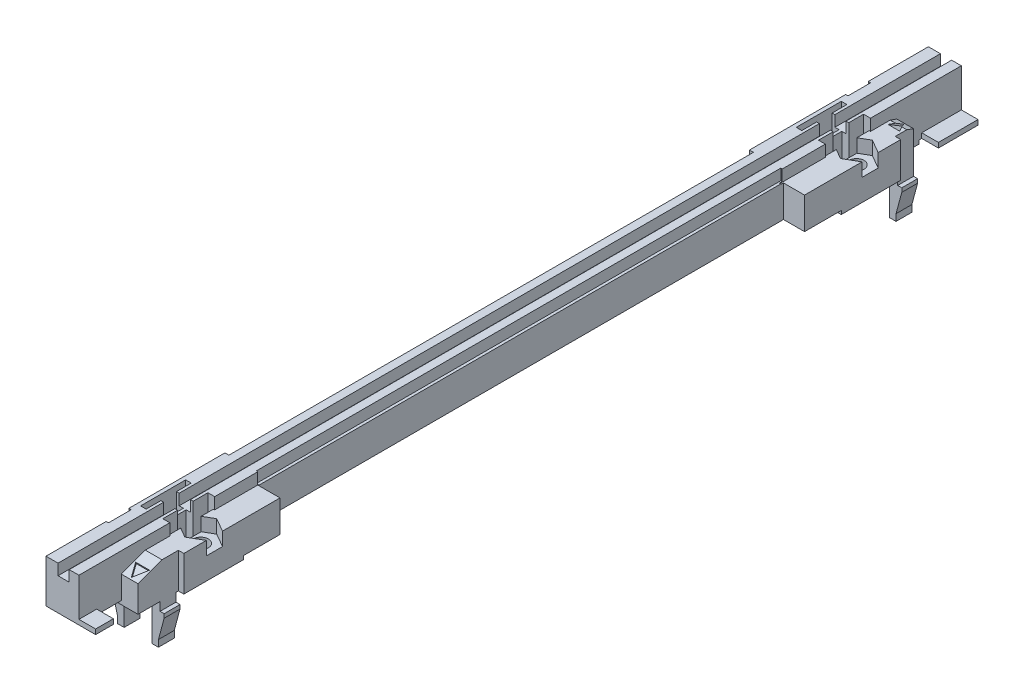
ISO-10303-21;
HEADER;
FILE_DESCRIPTION(('STEP AP214'),'2;1');
FILE_NAME('part.step','',(''),(''),'','','');
FILE_SCHEMA(('AUTOMOTIVE_DESIGN { 1 0 10303 214 1 1 1 1 }'));
ENDSEC;
DATA;
#1=APPLICATION_CONTEXT('core data for automotive mechanical design processes');
#2=APPLICATION_PROTOCOL_DEFINITION('international standard','automotive_design',2000,#1);
#3=PRODUCT_CONTEXT('',#1,'mechanical');
#4=PRODUCT('Part','Part','',(#3));
#5=PRODUCT_RELATED_PRODUCT_CATEGORY('part','',(#4));
#6=PRODUCT_DEFINITION_FORMATION('','',#4);
#7=PRODUCT_DEFINITION_CONTEXT('part definition',#1,'design');
#8=PRODUCT_DEFINITION('design','',#6,#7);
#9=PRODUCT_DEFINITION_SHAPE('','',#8);
#10=(LENGTH_UNIT() NAMED_UNIT(*) SI_UNIT(.MILLI.,.METRE.));
#11=(NAMED_UNIT(*) PLANE_ANGLE_UNIT() SI_UNIT($,.RADIAN.));
#12=(NAMED_UNIT(*) SI_UNIT($,.STERADIAN.) SOLID_ANGLE_UNIT());
#13=UNCERTAINTY_MEASURE_WITH_UNIT(LENGTH_MEASURE(1.E-05),#10,'distance_accuracy_value','');
#14=(GEOMETRIC_REPRESENTATION_CONTEXT(3) GLOBAL_UNCERTAINTY_ASSIGNED_CONTEXT((#13)) GLOBAL_UNIT_ASSIGNED_CONTEXT((#10,
#11,#12)) REPRESENTATION_CONTEXT('',''));
#15=CARTESIAN_POINT('',(0.,0.,0.));
#16=DIRECTION('',(0.,0.,1.));
#17=DIRECTION('',(1.,0.,0.));
#18=AXIS2_PLACEMENT_3D('',#15,#16,#17);
#19=CARTESIAN_POINT('',(7.32661,-2.269,-136.45));
#20=DIRECTION('',(1.,0.,0.));
#21=DIRECTION('',(0.,0.,-1.));
#22=AXIS2_PLACEMENT_3D('',#19,#20,#21);
#23=PLANE('',#22);
#24=DIRECTION('',(0.,1.,0.));
#25=VECTOR('',#24,1.);
#26=CARTESIAN_POINT('',(7.32661,-2.269,-136.45));
#27=LINE('',#26,#25);
#28=CARTESIAN_POINT('',(7.32661,-2.269,-136.45));
#29=VERTEX_POINT('',#28);
#30=CARTESIAN_POINT('',(7.32661,-1.55,-136.45));
#31=VERTEX_POINT('',#30);
#32=EDGE_CURVE('E970',#29,#31,#27,.T.);
#33=ORIENTED_EDGE('',*,*,#32,.T.);
#34=DIRECTION('',(0.,0.,1.));
#35=VECTOR('',#34,1.);
#36=CARTESIAN_POINT('',(7.32661,-1.55,-136.45));
#37=LINE('',#36,#35);
#38=CARTESIAN_POINT('',(7.32661,-1.55,-133.55));
#39=VERTEX_POINT('',#38);
#40=EDGE_CURVE('E1720',#39,#31,#37,.F.);
#41=ORIENTED_EDGE('',*,*,#40,.F.);
#42=DIRECTION('',(0.,1.,0.));
#43=VECTOR('',#42,1.);
#44=CARTESIAN_POINT('',(7.32661,-2.269,-133.55));
#45=LINE('',#44,#43);
#46=CARTESIAN_POINT('',(7.32661,-2.269,-133.55));
#47=VERTEX_POINT('',#46);
#48=EDGE_CURVE('E972',#39,#47,#45,.F.);
#49=ORIENTED_EDGE('',*,*,#48,.T.);
#50=DIRECTION('',(0.,0.,1.));
#51=VECTOR('',#50,1.);
#52=CARTESIAN_POINT('',(7.32661,-2.269,-136.45));
#53=LINE('',#52,#51);
#54=EDGE_CURVE('E955',#29,#47,#53,.T.);
#55=ORIENTED_EDGE('',*,*,#54,.F.);
#56=EDGE_LOOP('',(#33,#41,#49,#55));
#57=FACE_BOUND('',#56,.T.);
#58=ADVANCED_FACE('F15',(#57),#23,.T.);
#59=CARTESIAN_POINT('',(-1.2,-7.4,-136.45));
#60=DIRECTION('',(-1.,0.,0.));
#61=DIRECTION('',(0.,0.,1.));
#62=AXIS2_PLACEMENT_3D('',#59,#60,#61);
#63=PLANE('',#62);
#64=DIRECTION('',(0.,1.,0.));
#65=VECTOR('',#64,1.);
#66=CARTESIAN_POINT('',(-1.2,-7.4,-136.45));
#67=LINE('',#66,#65);
#68=CARTESIAN_POINT('',(-1.2,-6.17500169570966,-136.45));
#69=VERTEX_POINT('',#68);
#70=CARTESIAN_POINT('',(-1.2,-7.4,-136.45));
#71=VERTEX_POINT('',#70);
#72=EDGE_CURVE('E968',#69,#71,#67,.F.);
#73=ORIENTED_EDGE('',*,*,#72,.T.);
#74=DIRECTION('',(0.,0.,-1.));
#75=VECTOR('',#74,1.);
#76=CARTESIAN_POINT('',(-1.2,-7.4,-136.45));
#77=LINE('',#76,#75);
#78=CARTESIAN_POINT('',(-1.2,-7.4,-133.55));
#79=VERTEX_POINT('',#78);
#80=EDGE_CURVE('E1692',#79,#71,#77,.T.);
#81=ORIENTED_EDGE('',*,*,#80,.F.);
#82=DIRECTION('',(0.,1.,0.));
#83=VECTOR('',#82,1.);
#84=CARTESIAN_POINT('',(-1.2,0.,-133.55));
#85=LINE('',#84,#83);
#86=CARTESIAN_POINT('',(-1.2,-6.17500169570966,-133.55));
#87=VERTEX_POINT('',#86);
#88=EDGE_CURVE('E1698',#87,#79,#85,.F.);
#89=ORIENTED_EDGE('',*,*,#88,.F.);
#90=DIRECTION('',(0.,0.,1.));
#91=VECTOR('',#90,1.);
#92=CARTESIAN_POINT('',(-1.2,-6.17500169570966,-136.45));
#93=LINE('',#92,#91);
#94=EDGE_CURVE('E966',#69,#87,#93,.T.);
#95=ORIENTED_EDGE('',*,*,#94,.F.);
#96=EDGE_LOOP('',(#73,#81,#89,#95));
#97=FACE_BOUND('',#96,.T.);
#98=ADVANCED_FACE('F2067',(#97),#63,.T.);
#99=CARTESIAN_POINT('',(-1.2,-6.17500169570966,-136.45));
#100=DIRECTION('',(-0.965925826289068,-0.258819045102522,0.));
#101=DIRECTION('',(0.258819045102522,-0.965925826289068,0.));
#102=AXIS2_PLACEMENT_3D('',#99,#100,#101);
#103=PLANE('',#102);
#104=DIRECTION('',(0.258819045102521,-0.965925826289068,0.));
#105=VECTOR('',#104,1.);
#106=CARTESIAN_POINT('',(-2.24661,-2.269,-136.45));
#107=LINE('',#106,#105);
#108=CARTESIAN_POINT('',(-2.24661,-2.269,-136.45));
#109=VERTEX_POINT('',#108);
#110=EDGE_CURVE('E1684',#109,#69,#107,.T.);
#111=ORIENTED_EDGE('',*,*,#110,.T.);
#112=ORIENTED_EDGE('',*,*,#94,.T.);
#113=DIRECTION('',(0.258819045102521,-0.965925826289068,0.));
#114=VECTOR('',#113,1.);
#115=CARTESIAN_POINT('',(-2.24661,-2.269,-133.55));
#116=LINE('',#115,#114);
#117=CARTESIAN_POINT('',(-2.24661,-2.269,-133.55));
#118=VERTEX_POINT('',#117);
#119=EDGE_CURVE('E1700',#118,#87,#116,.T.);
#120=ORIENTED_EDGE('',*,*,#119,.F.);
#121=DIRECTION('',(0.,0.,1.));
#122=VECTOR('',#121,1.);
#123=CARTESIAN_POINT('',(-2.24661,-2.269,-136.45));
#124=LINE('',#123,#122);
#125=EDGE_CURVE('E938',#109,#118,#124,.T.);
#126=ORIENTED_EDGE('',*,*,#125,.F.);
#127=EDGE_LOOP('',(#111,#112,#120,#126));
#128=FACE_BOUND('',#127,.T.);
#129=ADVANCED_FACE('F2063',(#128),#103,.T.);
#130=CARTESIAN_POINT('',(-2.24661,-2.269,-136.45));
#131=DIRECTION('',(-1.,0.,0.));
#132=DIRECTION('',(0.,0.,1.));
#133=AXIS2_PLACEMENT_3D('',#130,#131,#132);
#134=PLANE('',#133);
#135=DIRECTION('',(0.,1.,0.));
#136=VECTOR('',#135,1.);
#137=CARTESIAN_POINT('',(-2.24661,0.,-136.45));
#138=LINE('',#137,#136);
#139=CARTESIAN_POINT('',(-2.24661,-1.55,-136.45));
#140=VERTEX_POINT('',#139);
#141=EDGE_CURVE('E1687',#140,#109,#138,.F.);
#142=ORIENTED_EDGE('',*,*,#141,.T.);
#143=ORIENTED_EDGE('',*,*,#125,.T.);
#144=DIRECTION('',(0.,1.,0.));
#145=VECTOR('',#144,1.);
#146=CARTESIAN_POINT('',(-2.24661,0.,-133.55));
#147=LINE('',#146,#145);
#148=CARTESIAN_POINT('',(-2.24661,-1.55,-133.55));
#149=VERTEX_POINT('',#148);
#150=EDGE_CURVE('E1703',#149,#118,#147,.F.);
#151=ORIENTED_EDGE('',*,*,#150,.F.);
#152=DIRECTION('',(0.,0.,1.));
#153=VECTOR('',#152,1.);
#154=CARTESIAN_POINT('',(-2.24661,-1.55,-136.45));
#155=LINE('',#154,#153);
#156=EDGE_CURVE('E1669',#140,#149,#155,.T.);
#157=ORIENTED_EDGE('',*,*,#156,.F.);
#158=EDGE_LOOP('',(#142,#143,#151,#157));
#159=FACE_BOUND('',#158,.T.);
#160=ADVANCED_FACE('F2059',(#159),#134,.T.);
#161=CARTESIAN_POINT('',(-1.14808704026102,6.,-136.45));
#162=DIRECTION('',(0.,-0.939692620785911,0.342020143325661));
#163=DIRECTION('',(0.,-0.342020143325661,-0.939692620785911));
#164=AXIS2_PLACEMENT_3D('',#161,#162,#163);
#165=PLANE('',#164);
#166=DIRECTION('',(0.499999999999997,-0.296198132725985,-0.81379768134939));
#167=VECTOR('',#166,1.);
#168=CARTESIAN_POINT('',(4.4935784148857,6.44999999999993,-135.213635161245));
#169=LINE('',#168,#167);
#170=CARTESIAN_POINT('',(4.49357841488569,6.44999999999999,-135.213635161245));
#171=VERTEX_POINT('',#170);
#172=CARTESIAN_POINT('',(5.08000000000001,6.10260604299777,-136.168092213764));
#173=VERTEX_POINT('',#172);
#174=EDGE_CURVE('E1731',#171,#173,#169,.T.);
#175=ORIENTED_EDGE('',*,*,#174,.T.);
#176=DIRECTION('',(0.499999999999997,0.296198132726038,0.81379768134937));
#177=VECTOR('',#176,1.);
#178=CARTESIAN_POINT('',(5.07999999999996,6.10260604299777,-136.168092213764));
#179=LINE('',#178,#177);
#180=CARTESIAN_POINT('',(5.6664215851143,6.44999999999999,-135.213635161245));
#181=VERTEX_POINT('',#180);
#182=EDGE_CURVE('E1725',#173,#181,#179,.T.);
#183=ORIENTED_EDGE('',*,*,#182,.T.);
#184=DIRECTION('',(1.,0.,0.));
#185=VECTOR('',#184,1.);
#186=CARTESIAN_POINT('',(-1.14808704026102,6.44999999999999,-135.213635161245));
#187=LINE('',#186,#185);
#188=CARTESIAN_POINT('',(6.58,6.44999999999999,-135.213635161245));
#189=VERTEX_POINT('',#188);
#190=EDGE_CURVE('E922',#189,#181,#187,.F.);
#191=ORIENTED_EDGE('',*,*,#190,.F.);
#192=DIRECTION('',(0.,-0.342020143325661,-0.939692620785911));
#193=VECTOR('',#192,1.);
#194=CARTESIAN_POINT('',(6.58,6.,-136.45));
#195=LINE('',#194,#193);
#196=CARTESIAN_POINT('',(6.58,6.,-136.45));
#197=VERTEX_POINT('',#196);
#198=EDGE_CURVE('E937',#197,#189,#195,.F.);
#199=ORIENTED_EDGE('',*,*,#198,.F.);
#200=DIRECTION('',(-1.,0.,0.));
#201=VECTOR('',#200,1.);
#202=CARTESIAN_POINT('',(0.,6.,-136.45));
#203=LINE('',#202,#201);
#204=CARTESIAN_POINT('',(3.53,6.,-136.45));
#205=VERTEX_POINT('',#204);
#206=EDGE_CURVE('E933',#205,#197,#203,.F.);
#207=ORIENTED_EDGE('',*,*,#206,.F.);
#208=DIRECTION('',(0.,-0.342020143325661,-0.939692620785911));
#209=VECTOR('',#208,1.);
#210=CARTESIAN_POINT('',(3.53,6.,-136.45));
#211=LINE('',#210,#209);
#212=CARTESIAN_POINT('',(3.53,6.44999999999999,-135.213635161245));
#213=VERTEX_POINT('',#212);
#214=EDGE_CURVE('E926',#213,#205,#211,.T.);
#215=ORIENTED_EDGE('',*,*,#214,.F.);
#216=DIRECTION('',(1.,0.,0.));
#217=VECTOR('',#216,1.);
#218=CARTESIAN_POINT('',(-1.14808704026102,6.44999999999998,-135.213635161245));
#219=LINE('',#218,#217);
#220=EDGE_CURVE('E930',#171,#213,#219,.F.);
#221=ORIENTED_EDGE('',*,*,#220,.F.);
#222=EDGE_LOOP('',(#175,#183,#191,#199,#207,#215,#221));
#223=FACE_BOUND('',#222,.T.);
#224=ADVANCED_FACE('F928',(#223),#165,.F.);
#225=CARTESIAN_POINT('',(6.28,-6.17500169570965,-136.45));
#226=DIRECTION('',(0.965925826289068,-0.258819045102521,0.));
#227=DIRECTION('',(0.258819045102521,0.965925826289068,0.));
#228=AXIS2_PLACEMENT_3D('',#225,#226,#227);
#229=PLANE('',#228);
#230=DIRECTION('',(-0.258819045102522,-0.965925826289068,0.));
#231=VECTOR('',#230,1.);
#232=CARTESIAN_POINT('',(7.32661,-2.269,-136.45));
#233=LINE('',#232,#231);
#234=CARTESIAN_POINT('',(6.28,-6.17500169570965,-136.45));
#235=VERTEX_POINT('',#234);
#236=EDGE_CURVE('E1648',#29,#235,#233,.T.);
#237=ORIENTED_EDGE('',*,*,#236,.F.);
#238=ORIENTED_EDGE('',*,*,#54,.T.);
#239=DIRECTION('',(-0.258819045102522,-0.965925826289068,0.));
#240=VECTOR('',#239,1.);
#241=CARTESIAN_POINT('',(7.32661,-2.269,-133.55));
#242=LINE('',#241,#240);
#243=CARTESIAN_POINT('',(6.28,-6.17500169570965,-133.55));
#244=VERTEX_POINT('',#243);
#245=EDGE_CURVE('E1659',#47,#244,#242,.T.);
#246=ORIENTED_EDGE('',*,*,#245,.T.);
#247=DIRECTION('',(0.,0.,-1.));
#248=VECTOR('',#247,1.);
#249=CARTESIAN_POINT('',(6.28,-6.17500169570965,-136.45));
#250=LINE('',#249,#248);
#251=EDGE_CURVE('E958',#235,#244,#250,.F.);
#252=ORIENTED_EDGE('',*,*,#251,.F.);
#253=EDGE_LOOP('',(#237,#238,#246,#252));
#254=FACE_BOUND('',#253,.T.);
#255=ADVANCED_FACE('F1779',(#254),#229,.T.);
#256=CARTESIAN_POINT('',(6.28,-7.4,-136.45));
#257=DIRECTION('',(1.,0.,0.));
#258=DIRECTION('',(0.,0.,-1.));
#259=AXIS2_PLACEMENT_3D('',#256,#257,#258);
#260=PLANE('',#259);
#261=DIRECTION('',(0.,1.,0.));
#262=VECTOR('',#261,1.);
#263=CARTESIAN_POINT('',(6.28,0.,-136.45));
#264=LINE('',#263,#262);
#265=CARTESIAN_POINT('',(6.28,-7.4,-136.45));
#266=VERTEX_POINT('',#265);
#267=EDGE_CURVE('E1646',#235,#266,#264,.F.);
#268=ORIENTED_EDGE('',*,*,#267,.F.);
#269=ORIENTED_EDGE('',*,*,#251,.T.);
#270=DIRECTION('',(0.,1.,0.));
#271=VECTOR('',#270,1.);
#272=CARTESIAN_POINT('',(6.28,0.,-133.55));
#273=LINE('',#272,#271);
#274=CARTESIAN_POINT('',(6.28,-7.4,-133.55));
#275=VERTEX_POINT('',#274);
#276=EDGE_CURVE('E1657',#244,#275,#273,.F.);
#277=ORIENTED_EDGE('',*,*,#276,.T.);
#278=DIRECTION('',(0.,0.,-1.));
#279=VECTOR('',#278,1.);
#280=CARTESIAN_POINT('',(6.28,-7.4,-136.45));
#281=LINE('',#280,#279);
#282=EDGE_CURVE('E1636',#266,#275,#281,.F.);
#283=ORIENTED_EDGE('',*,*,#282,.F.);
#284=EDGE_LOOP('',(#268,#269,#277,#283));
#285=FACE_BOUND('',#284,.T.);
#286=ADVANCED_FACE('F1770',(#285),#260,.T.);
#287=CARTESIAN_POINT('',(6.58,-1.55,-136.45));
#288=DIRECTION('',(1.,0.,0.));
#289=DIRECTION('',(0.,1.,0.));
#290=AXIS2_PLACEMENT_3D('',#287,#288,#289);
#291=PLANE('',#290);
#292=DIRECTION('',(0.,0.,-1.));
#293=VECTOR('',#292,1.);
#294=CARTESIAN_POINT('',(6.58,0.65,-148.25));
#295=LINE('',#294,#293);
#296=CARTESIAN_POINT('',(6.58,0.65,-148.25));
#297=VERTEX_POINT('',#296);
#298=CARTESIAN_POINT('',(6.58,0.65,-141.));
#299=VERTEX_POINT('',#298);
#300=EDGE_CURVE('E1620',#297,#299,#295,.F.);
#301=ORIENTED_EDGE('',*,*,#300,.F.);
#302=DIRECTION('',(0.,1.,0.));
#303=VECTOR('',#302,1.);
#304=CARTESIAN_POINT('',(6.58,-1.55,-148.25));
#305=LINE('',#304,#303);
#306=CARTESIAN_POINT('',(6.58,1.55,-148.25));
#307=VERTEX_POINT('',#306);
#308=EDGE_CURVE('E1765',#297,#307,#305,.T.);
#309=ORIENTED_EDGE('',*,*,#308,.T.);
#310=DIRECTION('',(0.,0.,1.));
#311=VECTOR('',#310,1.);
#312=CARTESIAN_POINT('',(6.58,1.55,0.));
#313=LINE('',#312,#311);
#314=CARTESIAN_POINT('',(6.58,1.55,-141.));
#315=VERTEX_POINT('',#314);
#316=EDGE_CURVE('E1622',#315,#307,#313,.F.);
#317=ORIENTED_EDGE('',*,*,#316,.F.);
#318=DIRECTION('',(0.,1.,0.));
#319=VECTOR('',#318,1.);
#320=CARTESIAN_POINT('',(6.58,4.65,-141.));
#321=LINE('',#320,#319);
#322=EDGE_CURVE('E1763',#299,#315,#321,.T.);
#323=ORIENTED_EDGE('',*,*,#322,.F.);
#324=EDGE_LOOP('',(#301,#309,#317,#323));
#325=FACE_BOUND('',#324,.T.);
#326=ADVANCED_FACE('F2714',(#325),#291,.T.);
#327=CARTESIAN_POINT('',(3.53,4.65,-141.));
#328=DIRECTION('',(0.,0.,1.));
#329=DIRECTION('',(1.,0.,0.));
#330=AXIS2_PLACEMENT_3D('',#327,#328,#329);
#331=PLANE('',#330);
#332=DIRECTION('',(0.,1.,0.));
#333=VECTOR('',#332,1.);
#334=CARTESIAN_POINT('',(3.53,4.65,-141.));
#335=LINE('',#334,#333);
#336=CARTESIAN_POINT('',(3.53,1.55,-141.));
#337=VERTEX_POINT('',#336);
#338=CARTESIAN_POINT('',(3.53,0.65,-141.));
#339=VERTEX_POINT('',#338);
#340=EDGE_CURVE('E1761',#337,#339,#335,.F.);
#341=ORIENTED_EDGE('',*,*,#340,.T.);
#342=DIRECTION('',(1.,0.,0.));
#343=VECTOR('',#342,1.);
#344=CARTESIAN_POINT('',(10.,0.649999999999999,-141.));
#345=LINE('',#344,#343);
#346=EDGE_CURVE('E1617',#299,#339,#345,.F.);
#347=ORIENTED_EDGE('',*,*,#346,.F.);
#348=ORIENTED_EDGE('',*,*,#322,.T.);
#349=DIRECTION('',(1.,0.,0.));
#350=VECTOR('',#349,1.);
#351=CARTESIAN_POINT('',(0.,1.55,-141.));
#352=LINE('',#351,#350);
#353=EDGE_CURVE('E1625',#337,#315,#352,.T.);
#354=ORIENTED_EDGE('',*,*,#353,.F.);
#355=EDGE_LOOP('',(#341,#347,#348,#354));
#356=FACE_BOUND('',#355,.T.);
#357=ADVANCED_FACE('F2706',(#356),#331,.T.);
#358=CARTESIAN_POINT('',(-2.24661,-2.269,1.45));
#359=DIRECTION('',(1.,0.,0.));
#360=DIRECTION('',(0.,0.,-1.));
#361=AXIS2_PLACEMENT_3D('',#358,#359,#360);
#362=PLANE('',#361);
#363=DIRECTION('',(0.,0.,1.));
#364=VECTOR('',#363,1.);
#365=CARTESIAN_POINT('',(-2.24661,-2.269,1.45));
#366=LINE('',#365,#364);
#367=CARTESIAN_POINT('',(-2.24661,-2.269,-1.45));
#368=VERTEX_POINT('',#367);
#369=CARTESIAN_POINT('',(-2.24661,-2.269,1.45));
#370=VERTEX_POINT('',#369);
#371=EDGE_CURVE('E1750',#368,#370,#366,.T.);
#372=ORIENTED_EDGE('',*,*,#371,.T.);
#373=DIRECTION('',(0.,1.,0.));
#374=VECTOR('',#373,1.);
#375=CARTESIAN_POINT('',(-2.24661,-2.269,1.45));
#376=LINE('',#375,#374);
#377=CARTESIAN_POINT('',(-2.24661,-1.55,1.45));
#378=VERTEX_POINT('',#377);
#379=EDGE_CURVE('E1759',#378,#370,#376,.F.);
#380=ORIENTED_EDGE('',*,*,#379,.F.);
#381=DIRECTION('',(0.,0.,1.));
#382=VECTOR('',#381,1.);
#383=CARTESIAN_POINT('',(-2.24661,-1.55,1.45));
#384=LINE('',#383,#382);
#385=CARTESIAN_POINT('',(-2.24661,-1.55,-1.45));
#386=VERTEX_POINT('',#385);
#387=EDGE_CURVE('E1584',#378,#386,#384,.F.);
#388=ORIENTED_EDGE('',*,*,#387,.T.);
#389=DIRECTION('',(0.,1.,0.));
#390=VECTOR('',#389,1.);
#391=CARTESIAN_POINT('',(-2.24661,-2.269,-1.45));
#392=LINE('',#391,#390);
#393=EDGE_CURVE('E1757',#368,#386,#392,.T.);
#394=ORIENTED_EDGE('',*,*,#393,.F.);
#395=EDGE_LOOP('',(#372,#380,#388,#394));
#396=FACE_BOUND('',#395,.T.);
#397=ADVANCED_FACE('F2971',(#396),#362,.F.);
#398=CARTESIAN_POINT('',(-1.2,-7.4,1.45));
#399=DIRECTION('',(1.,0.,0.));
#400=DIRECTION('',(0.,0.,-1.));
#401=AXIS2_PLACEMENT_3D('',#398,#399,#400);
#402=PLANE('',#401);
#403=DIRECTION('',(0.,0.,1.));
#404=VECTOR('',#403,1.);
#405=CARTESIAN_POINT('',(-1.2,-7.4,1.45));
#406=LINE('',#405,#404);
#407=CARTESIAN_POINT('',(-1.2,-7.4,-1.45));
#408=VERTEX_POINT('',#407);
#409=CARTESIAN_POINT('',(-1.2,-7.4,1.45));
#410=VERTEX_POINT('',#409);
#411=EDGE_CURVE('E1581',#408,#410,#406,.T.);
#412=ORIENTED_EDGE('',*,*,#411,.T.);
#413=DIRECTION('',(0.,1.,0.));
#414=VECTOR('',#413,1.);
#415=CARTESIAN_POINT('',(-1.2,-7.4,1.45));
#416=LINE('',#415,#414);
#417=CARTESIAN_POINT('',(-1.2,-6.17500169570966,1.45));
#418=VERTEX_POINT('',#417);
#419=EDGE_CURVE('E1755',#418,#410,#416,.F.);
#420=ORIENTED_EDGE('',*,*,#419,.F.);
#421=DIRECTION('',(0.,0.,1.));
#422=VECTOR('',#421,1.);
#423=CARTESIAN_POINT('',(-1.2,-6.17500169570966,1.45));
#424=LINE('',#423,#422);
#425=CARTESIAN_POINT('',(-1.2,-6.17500169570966,-1.45));
#426=VERTEX_POINT('',#425);
#427=EDGE_CURVE('E1747',#418,#426,#424,.F.);
#428=ORIENTED_EDGE('',*,*,#427,.T.);
#429=DIRECTION('',(0.,1.,0.));
#430=VECTOR('',#429,1.);
#431=CARTESIAN_POINT('',(-1.2,-7.4,-1.45));
#432=LINE('',#431,#430);
#433=EDGE_CURVE('E1753',#408,#426,#432,.T.);
#434=ORIENTED_EDGE('',*,*,#433,.F.);
#435=EDGE_LOOP('',(#412,#420,#428,#434));
#436=FACE_BOUND('',#435,.T.);
#437=ADVANCED_FACE('F2967',(#436),#402,.F.);
#438=CARTESIAN_POINT('',(-1.2,-6.17500169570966,1.45));
#439=DIRECTION('',(0.965925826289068,0.258819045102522,0.));
#440=DIRECTION('',(-0.258819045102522,0.965925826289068,0.));
#441=AXIS2_PLACEMENT_3D('',#438,#439,#440);
#442=PLANE('',#441);
#443=ORIENTED_EDGE('',*,*,#427,.F.);
#444=DIRECTION('',(-0.258819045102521,0.965925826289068,0.));
#445=VECTOR('',#444,1.);
#446=CARTESIAN_POINT('',(-1.2,-6.17500169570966,1.45));
#447=LINE('',#446,#445);
#448=EDGE_CURVE('E1575',#418,#370,#447,.T.);
#449=ORIENTED_EDGE('',*,*,#448,.T.);
#450=ORIENTED_EDGE('',*,*,#371,.F.);
#451=DIRECTION('',(-0.258819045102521,0.965925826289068,0.));
#452=VECTOR('',#451,1.);
#453=CARTESIAN_POINT('',(-1.2,-6.17500169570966,-1.45));
#454=LINE('',#453,#452);
#455=EDGE_CURVE('E1563',#426,#368,#454,.T.);
#456=ORIENTED_EDGE('',*,*,#455,.F.);
#457=EDGE_LOOP('',(#443,#449,#450,#456));
#458=FACE_BOUND('',#457,.T.);
#459=ADVANCED_FACE('F2964',(#458),#442,.F.);
#460=CARTESIAN_POINT('',(6.28,-7.4,1.45));
#461=DIRECTION('',(-1.,0.,0.));
#462=DIRECTION('',(0.,0.,1.));
#463=AXIS2_PLACEMENT_3D('',#460,#461,#462);
#464=PLANE('',#463);
#465=DIRECTION('',(0.,0.,1.));
#466=VECTOR('',#465,1.);
#467=CARTESIAN_POINT('',(6.28,-6.17500169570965,1.45));
#468=LINE('',#467,#466);
#469=CARTESIAN_POINT('',(6.28,-6.17500169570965,-1.45));
#470=VERTEX_POINT('',#469);
#471=CARTESIAN_POINT('',(6.28,-6.17500169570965,1.45));
#472=VERTEX_POINT('',#471);
#473=EDGE_CURVE('E1742',#470,#472,#468,.T.);
#474=ORIENTED_EDGE('',*,*,#473,.T.);
#475=DIRECTION('',(0.,1.,0.));
#476=VECTOR('',#475,1.);
#477=CARTESIAN_POINT('',(6.28,0.,1.45));
#478=LINE('',#477,#476);
#479=CARTESIAN_POINT('',(6.28,-7.4,1.45));
#480=VERTEX_POINT('',#479);
#481=EDGE_CURVE('E1557',#480,#472,#478,.T.);
#482=ORIENTED_EDGE('',*,*,#481,.F.);
#483=DIRECTION('',(0.,0.,1.));
#484=VECTOR('',#483,1.);
#485=CARTESIAN_POINT('',(6.28,-7.4,1.45));
#486=LINE('',#485,#484);
#487=CARTESIAN_POINT('',(6.28,-7.4,-1.45));
#488=VERTEX_POINT('',#487);
#489=EDGE_CURVE('E1545',#480,#488,#486,.F.);
#490=ORIENTED_EDGE('',*,*,#489,.T.);
#491=DIRECTION('',(0.,1.,0.));
#492=VECTOR('',#491,1.);
#493=CARTESIAN_POINT('',(6.28,-7.4,-1.45));
#494=LINE('',#493,#492);
#495=EDGE_CURVE('E1745',#470,#488,#494,.F.);
#496=ORIENTED_EDGE('',*,*,#495,.F.);
#497=EDGE_LOOP('',(#474,#482,#490,#496));
#498=FACE_BOUND('',#497,.T.);
#499=ADVANCED_FACE('F2891',(#498),#464,.F.);
#500=CARTESIAN_POINT('',(6.28,-6.17500169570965,1.45));
#501=DIRECTION('',(-0.965925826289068,0.258819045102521,0.));
#502=DIRECTION('',(-0.258819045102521,-0.965925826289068,0.));
#503=AXIS2_PLACEMENT_3D('',#500,#501,#502);
#504=PLANE('',#503);
#505=DIRECTION('',(0.,0.,1.));
#506=VECTOR('',#505,1.);
#507=CARTESIAN_POINT('',(7.32661,-2.269,1.45));
#508=LINE('',#507,#506);
#509=CARTESIAN_POINT('',(7.32661,-2.269,-1.45));
#510=VERTEX_POINT('',#509);
#511=CARTESIAN_POINT('',(7.32661,-2.269,1.45));
#512=VERTEX_POINT('',#511);
#513=EDGE_CURVE('E1739',#510,#512,#508,.T.);
#514=ORIENTED_EDGE('',*,*,#513,.T.);
#515=DIRECTION('',(0.258819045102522,0.965925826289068,0.));
#516=VECTOR('',#515,1.);
#517=CARTESIAN_POINT('',(6.28,-6.17500169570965,1.45));
#518=LINE('',#517,#516);
#519=EDGE_CURVE('E1555',#472,#512,#518,.T.);
#520=ORIENTED_EDGE('',*,*,#519,.F.);
#521=ORIENTED_EDGE('',*,*,#473,.F.);
#522=DIRECTION('',(0.258819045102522,0.965925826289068,0.));
#523=VECTOR('',#522,1.);
#524=CARTESIAN_POINT('',(6.28,-6.17500169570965,-1.45));
#525=LINE('',#524,#523);
#526=EDGE_CURVE('E1539',#470,#510,#525,.T.);
#527=ORIENTED_EDGE('',*,*,#526,.T.);
#528=EDGE_LOOP('',(#514,#520,#521,#527));
#529=FACE_BOUND('',#528,.T.);
#530=ADVANCED_FACE('F2888',(#529),#504,.F.);
#531=CARTESIAN_POINT('',(7.32661,-2.269,1.45));
#532=DIRECTION('',(-1.,0.,0.));
#533=DIRECTION('',(0.,0.,1.));
#534=AXIS2_PLACEMENT_3D('',#531,#532,#533);
#535=PLANE('',#534);
#536=DIRECTION('',(0.,0.,1.));
#537=VECTOR('',#536,1.);
#538=CARTESIAN_POINT('',(7.32661,-1.55,1.45));
#539=LINE('',#538,#537);
#540=CARTESIAN_POINT('',(7.32661,-1.55,-1.45));
#541=VERTEX_POINT('',#540);
#542=CARTESIAN_POINT('',(7.32661,-1.55,1.45));
#543=VERTEX_POINT('',#542);
#544=EDGE_CURVE('E1482',#541,#543,#539,.T.);
#545=ORIENTED_EDGE('',*,*,#544,.T.);
#546=DIRECTION('',(0.,1.,0.));
#547=VECTOR('',#546,1.);
#548=CARTESIAN_POINT('',(7.32661,0.,1.45));
#549=LINE('',#548,#547);
#550=EDGE_CURVE('E1553',#512,#543,#549,.T.);
#551=ORIENTED_EDGE('',*,*,#550,.F.);
#552=ORIENTED_EDGE('',*,*,#513,.F.);
#553=DIRECTION('',(0.,1.,0.));
#554=VECTOR('',#553,1.);
#555=CARTESIAN_POINT('',(7.32661,0.,-1.45));
#556=LINE('',#555,#554);
#557=EDGE_CURVE('E1536',#510,#541,#556,.T.);
#558=ORIENTED_EDGE('',*,*,#557,.T.);
#559=EDGE_LOOP('',(#545,#551,#552,#558));
#560=FACE_BOUND('',#559,.T.);
#561=ADVANCED_FACE('F2884',(#560),#535,.F.);
#562=CARTESIAN_POINT('',(3.80982940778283,5.42314257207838,3.04816240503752));
#563=DIRECTION('',(0.,0.939692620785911,0.342020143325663));
#564=DIRECTION('',(0.,-0.342020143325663,0.939692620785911));
#565=AXIS2_PLACEMENT_3D('',#562,#563,#564);
#566=PLANE('',#565);
#567=DIRECTION('',(0.499999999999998,-0.296198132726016,0.813797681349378));
#568=VECTOR('',#567,1.);
#569=CARTESIAN_POINT('',(3.80982940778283,5.42314257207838,3.04816240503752));
#570=LINE('',#569,#568);
#571=CARTESIAN_POINT('',(3.80982940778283,5.42314257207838,3.04816240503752));
#572=VERTEX_POINT('',#571);
#573=CARTESIAN_POINT('',(5.08,4.67069825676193,5.11548617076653));
#574=VERTEX_POINT('',#573);
#575=EDGE_CURVE('E1463',#572,#574,#570,.T.);
#576=ORIENTED_EDGE('',*,*,#575,.T.);
#577=DIRECTION('',(0.499999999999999,0.296198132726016,-0.813797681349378));
#578=VECTOR('',#577,1.);
#579=CARTESIAN_POINT('',(5.08,4.67069825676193,5.11548617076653));
#580=LINE('',#579,#578);
#581=CARTESIAN_POINT('',(6.35017059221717,5.42314257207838,3.04816240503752));
#582=VERTEX_POINT('',#581);
#583=EDGE_CURVE('E1474',#574,#582,#580,.T.);
#584=ORIENTED_EDGE('',*,*,#583,.T.);
#585=DIRECTION('',(1.,0.,0.));
#586=VECTOR('',#585,1.);
#587=CARTESIAN_POINT('',(6.35017059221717,5.42314257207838,3.04816240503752));
#588=LINE('',#587,#586);
#589=EDGE_CURVE('E1469',#582,#572,#588,.F.);
#590=ORIENTED_EDGE('',*,*,#589,.T.);
#591=EDGE_LOOP('',(#576,#584,#590));
#592=FACE_BOUND('',#591,.T.);
#593=ADVANCED_FACE('F2951',(#592),#566,.T.);
#594=CARTESIAN_POINT('',(6.58,-1.55,1.45));
#595=DIRECTION('',(-1.,0.,0.));
#596=DIRECTION('',(0.,-1.,0.));
#597=AXIS2_PLACEMENT_3D('',#594,#595,#596);
#598=PLANE('',#597);
#599=DIRECTION('',(0.,0.,1.));
#600=VECTOR('',#599,1.);
#601=CARTESIAN_POINT('',(6.58,1.55,0.));
#602=LINE('',#601,#600);
#603=CARTESIAN_POINT('',(6.58,1.55,13.25));
#604=VERTEX_POINT('',#603);
#605=CARTESIAN_POINT('',(6.58,1.55,10.));
#606=VERTEX_POINT('',#605);
#607=EDGE_CURVE('E1452',#604,#606,#602,.F.);
#608=ORIENTED_EDGE('',*,*,#607,.F.);
#609=DIRECTION('',(0.,-1.,0.));
#610=VECTOR('',#609,1.);
#611=CARTESIAN_POINT('',(6.58,-1.55,13.25));
#612=LINE('',#611,#610);
#613=CARTESIAN_POINT('',(6.58,0.65,13.25));
#614=VERTEX_POINT('',#613);
#615=EDGE_CURVE('E1737',#614,#604,#612,.F.);
#616=ORIENTED_EDGE('',*,*,#615,.F.);
#617=DIRECTION('',(0.,0.,1.));
#618=VECTOR('',#617,1.);
#619=CARTESIAN_POINT('',(6.58,0.65,13.25));
#620=LINE('',#619,#618);
#621=CARTESIAN_POINT('',(6.58,0.65,10.));
#622=VERTEX_POINT('',#621);
#623=EDGE_CURVE('E1457',#614,#622,#620,.F.);
#624=ORIENTED_EDGE('',*,*,#623,.T.);
#625=DIRECTION('',(0.,1.,0.));
#626=VECTOR('',#625,1.);
#627=CARTESIAN_POINT('',(6.58,4.65,10.));
#628=LINE('',#627,#626);
#629=EDGE_CURVE('E1733',#606,#622,#628,.F.);
#630=ORIENTED_EDGE('',*,*,#629,.F.);
#631=EDGE_LOOP('',(#608,#616,#624,#630));
#632=FACE_BOUND('',#631,.T.);
#633=ADVANCED_FACE('F2908',(#632),#598,.F.);
#634=CARTESIAN_POINT('',(3.53,4.65,10.));
#635=DIRECTION('',(0.,0.,-1.));
#636=DIRECTION('',(-1.,0.,0.));
#637=AXIS2_PLACEMENT_3D('',#634,#635,#636);
#638=PLANE('',#637);
#639=DIRECTION('',(1.,0.,0.));
#640=VECTOR('',#639,1.);
#641=CARTESIAN_POINT('',(0.,1.55,10.));
#642=LINE('',#641,#640);
#643=CARTESIAN_POINT('',(3.53,1.55,10.));
#644=VERTEX_POINT('',#643);
#645=EDGE_CURVE('E1449',#606,#644,#642,.F.);
#646=ORIENTED_EDGE('',*,*,#645,.F.);
#647=ORIENTED_EDGE('',*,*,#629,.T.);
#648=DIRECTION('',(1.,0.,0.));
#649=VECTOR('',#648,1.);
#650=CARTESIAN_POINT('',(10.,0.65,10.));
#651=LINE('',#650,#649);
#652=CARTESIAN_POINT('',(3.53,0.65,10.));
#653=VERTEX_POINT('',#652);
#654=EDGE_CURVE('E1454',#622,#653,#651,.F.);
#655=ORIENTED_EDGE('',*,*,#654,.T.);
#656=DIRECTION('',(0.,1.,0.));
#657=VECTOR('',#656,1.);
#658=CARTESIAN_POINT('',(3.53,4.65,10.));
#659=LINE('',#658,#657);
#660=EDGE_CURVE('E1735',#653,#644,#659,.T.);
#661=ORIENTED_EDGE('',*,*,#660,.T.);
#662=EDGE_LOOP('',(#646,#647,#655,#661));
#663=FACE_BOUND('',#662,.T.);
#664=ADVANCED_FACE('F2942',(#663),#638,.T.);
#665=CARTESIAN_POINT('',(1.755,8.55,-20.));
#666=DIRECTION('',(1.,0.,0.));
#667=DIRECTION('',(0.,1.,0.));
#668=AXIS2_PLACEMENT_3D('',#665,#666,#667);
#669=PLANE('',#668);
#670=DIRECTION('',(0.,1.,0.));
#671=VECTOR('',#670,1.);
#672=CARTESIAN_POINT('',(1.755,23.7329674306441,-126.075));
#673=LINE('',#672,#671);
#674=CARTESIAN_POINT('',(1.755,8.55,-126.075));
#675=VERTEX_POINT('',#674);
#676=CARTESIAN_POINT('',(1.755,6.55,-126.075));
#677=VERTEX_POINT('',#676);
#678=EDGE_CURVE('E1710',#675,#677,#673,.F.);
#679=ORIENTED_EDGE('',*,*,#678,.T.);
#680=DIRECTION('',(0.,0.,-1.));
#681=VECTOR('',#680,1.);
#682=CARTESIAN_POINT('',(1.755,6.55,-20.));
#683=LINE('',#682,#681);
#684=CARTESIAN_POINT('',(1.755,6.55,-8.925));
#685=VERTEX_POINT('',#684);
#686=EDGE_CURVE('E1514',#677,#685,#683,.F.);
#687=ORIENTED_EDGE('',*,*,#686,.T.);
#688=DIRECTION('',(0.,1.,0.));
#689=VECTOR('',#688,1.);
#690=CARTESIAN_POINT('',(1.755,23.7329674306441,-8.925));
#691=LINE('',#690,#689);
#692=CARTESIAN_POINT('',(1.755,8.55,-8.925));
#693=VERTEX_POINT('',#692);
#694=EDGE_CURVE('E1587',#693,#685,#691,.F.);
#695=ORIENTED_EDGE('',*,*,#694,.F.);
#696=DIRECTION('',(0.,0.,-1.));
#697=VECTOR('',#696,1.);
#698=CARTESIAN_POINT('',(1.755,8.55,13.25));
#699=LINE('',#698,#697);
#700=EDGE_CURVE('E1414',#693,#675,#699,.T.);
#701=ORIENTED_EDGE('',*,*,#700,.T.);
#702=EDGE_LOOP('',(#679,#687,#695,#701));
#703=FACE_BOUND('',#702,.T.);
#704=ADVANCED_FACE('F2845',(#703),#669,.F.);
#705=CARTESIAN_POINT('',(3.80982940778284,6.57314257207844,-133.998162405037));
#706=DIRECTION('',(-0.86602540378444,-0.171010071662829,-0.469846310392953));
#707=DIRECTION('',(-0.476870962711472,0.,0.87897331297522));
#708=AXIS2_PLACEMENT_3D('',#705,#706,#707);
#709=PLANE('',#708);
#710=DIRECTION('',(0.499999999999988,-0.296198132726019,-0.813797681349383));
#711=VECTOR('',#710,1.);
#712=CARTESIAN_POINT('',(4.01770136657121,6.45000000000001,-134.336493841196));
#713=LINE('',#712,#711);
#714=CARTESIAN_POINT('',(4.0177013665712,6.45,-134.336493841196));
#715=VERTEX_POINT('',#714);
#716=CARTESIAN_POINT('',(5.08,5.82069825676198,-136.065486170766));
#717=VERTEX_POINT('',#716);
#718=EDGE_CURVE('E1406',#715,#717,#713,.T.);
#719=ORIENTED_EDGE('',*,*,#718,.T.);
#720=DIRECTION('',(-1.35886672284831E-13,0.939692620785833,-0.342020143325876));
#721=VECTOR('',#720,1.);
#722=CARTESIAN_POINT('',(5.08,5.82069825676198,-136.065486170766));
#723=LINE('',#722,#721);
#724=EDGE_CURVE('E1727',#717,#173,#723,.T.);
#725=ORIENTED_EDGE('',*,*,#724,.T.);
#726=ORIENTED_EDGE('',*,*,#174,.F.);
#727=DIRECTION('',(-0.476870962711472,0.,0.87897331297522));
#728=VECTOR('',#727,1.);
#729=CARTESIAN_POINT('',(3.82861611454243,6.44999999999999,-133.987970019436));
#730=LINE('',#729,#728);
#731=EDGE_CURVE('E954',#715,#171,#730,.F.);
#732=ORIENTED_EDGE('',*,*,#731,.F.);
#733=EDGE_LOOP('',(#719,#725,#726,#732));
#734=FACE_BOUND('',#733,.T.);
#735=ADVANCED_FACE('F2949',(#734),#709,.F.);
#736=CARTESIAN_POINT('',(5.08,5.82069825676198,-136.065486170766));
#737=DIRECTION('',(0.86602540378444,-0.17101007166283,-0.469846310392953));
#738=DIRECTION('',(-0.476870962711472,0.,-0.87897331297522));
#739=AXIS2_PLACEMENT_3D('',#736,#737,#738);
#740=PLANE('',#739);
#741=ORIENTED_EDGE('',*,*,#182,.F.);
#742=ORIENTED_EDGE('',*,*,#724,.F.);
#743=DIRECTION('',(0.499999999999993,0.296198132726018,0.81379768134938));
#744=VECTOR('',#743,1.);
#745=CARTESIAN_POINT('',(5.08,5.82069825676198,-136.065486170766));
#746=LINE('',#745,#744);
#747=CARTESIAN_POINT('',(6.1422986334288,6.45,-134.336493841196));
#748=VERTEX_POINT('',#747);
#749=EDGE_CURVE('E1403',#717,#748,#746,.T.);
#750=ORIENTED_EDGE('',*,*,#749,.T.);
#751=DIRECTION('',(-0.476870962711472,0.,-0.87897331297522));
#752=VECTOR('',#751,1.);
#753=CARTESIAN_POINT('',(5.17600666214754,6.45,-136.117572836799));
#754=LINE('',#753,#752);
#755=EDGE_CURVE('E1723',#181,#748,#754,.F.);
#756=ORIENTED_EDGE('',*,*,#755,.F.);
#757=EDGE_LOOP('',(#741,#742,#750,#756));
#758=FACE_BOUND('',#757,.T.);
#759=ADVANCED_FACE('F3157',(#758),#740,.F.);
#760=CARTESIAN_POINT('',(7.32661,-1.55,-136.45));
#761=DIRECTION('',(0.,1.,0.));
#762=DIRECTION('',(-1.,0.,0.));
#763=AXIS2_PLACEMENT_3D('',#760,#761,#762);
#764=PLANE('',#763);
#765=DIRECTION('',(-1.,0.,0.));
#766=VECTOR('',#765,1.);
#767=CARTESIAN_POINT('',(0.,-1.55,-136.45));
#768=LINE('',#767,#766);
#769=CARTESIAN_POINT('',(6.58,-1.55,-136.45));
#770=VERTEX_POINT('',#769);
#771=EDGE_CURVE('E1650',#770,#31,#768,.F.);
#772=ORIENTED_EDGE('',*,*,#771,.F.);
#773=DIRECTION('',(0.,0.,1.));
#774=VECTOR('',#773,1.);
#775=CARTESIAN_POINT('',(6.58,-1.55,-136.45));
#776=LINE('',#775,#774);
#777=CARTESIAN_POINT('',(6.58,-1.55,-133.55));
#778=VERTEX_POINT('',#777);
#779=EDGE_CURVE('E1396',#778,#770,#776,.F.);
#780=ORIENTED_EDGE('',*,*,#779,.F.);
#781=DIRECTION('',(-1.,0.,0.));
#782=VECTOR('',#781,1.);
#783=CARTESIAN_POINT('',(0.,-1.55,-133.55));
#784=LINE('',#783,#782);
#785=EDGE_CURVE('E1662',#778,#39,#784,.F.);
#786=ORIENTED_EDGE('',*,*,#785,.T.);
#787=ORIENTED_EDGE('',*,*,#40,.T.);
#788=EDGE_LOOP('',(#772,#780,#786,#787));
#789=FACE_BOUND('',#788,.T.);
#790=ADVANCED_FACE('F1789',(#789),#764,.T.);
#791=CARTESIAN_POINT('',(0.98,23.7329674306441,-128.925));
#792=DIRECTION('',(0.,0.,-1.));
#793=DIRECTION('',(-1.,0.,0.));
#794=AXIS2_PLACEMENT_3D('',#791,#792,#793);
#795=PLANE('',#794);
#796=DIRECTION('',(-1.,0.,0.));
#797=VECTOR('',#796,1.);
#798=CARTESIAN_POINT('',(0.98,0.,-128.925));
#799=LINE('',#798,#797);
#800=CARTESIAN_POINT('',(2.255,0.,-128.925));
#801=VERTEX_POINT('',#800);
#802=CARTESIAN_POINT('',(0.98,0.,-128.925));
#803=VERTEX_POINT('',#802);
#804=EDGE_CURVE('E1718',#801,#803,#799,.T.);
#805=ORIENTED_EDGE('',*,*,#804,.F.);
#806=DIRECTION('',(0.,1.,0.));
#807=VECTOR('',#806,1.);
#808=CARTESIAN_POINT('',(2.255,23.7329674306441,-128.925));
#809=LINE('',#808,#807);
#810=CARTESIAN_POINT('',(2.255,8.55,-128.925));
#811=VERTEX_POINT('',#810);
#812=EDGE_CURVE('E1366',#801,#811,#809,.T.);
#813=ORIENTED_EDGE('',*,*,#812,.T.);
#814=DIRECTION('',(1.,0.,0.));
#815=VECTOR('',#814,1.);
#816=CARTESIAN_POINT('',(7.58,8.55,-128.925));
#817=LINE('',#816,#815);
#818=CARTESIAN_POINT('',(1.755,8.55,-128.925));
#819=VERTEX_POINT('',#818);
#820=EDGE_CURVE('E1612',#811,#819,#817,.F.);
#821=ORIENTED_EDGE('',*,*,#820,.T.);
#822=DIRECTION('',(0.,1.,0.));
#823=VECTOR('',#822,1.);
#824=CARTESIAN_POINT('',(1.755,8.55,-128.925));
#825=LINE('',#824,#823);
#826=CARTESIAN_POINT('',(1.755,6.55,-128.925));
#827=VERTEX_POINT('',#826);
#828=EDGE_CURVE('E1615',#819,#827,#825,.F.);
#829=ORIENTED_EDGE('',*,*,#828,.T.);
#830=DIRECTION('',(1.,0.,0.));
#831=VECTOR('',#830,1.);
#832=CARTESIAN_POINT('',(-0.295,6.55,-128.925));
#833=LINE('',#832,#831);
#834=CARTESIAN_POINT('',(0.98,6.55,-128.925));
#835=VERTEX_POINT('',#834);
#836=EDGE_CURVE('E1520',#827,#835,#833,.F.);
#837=ORIENTED_EDGE('',*,*,#836,.T.);
#838=DIRECTION('',(0.,1.,0.));
#839=VECTOR('',#838,1.);
#840=CARTESIAN_POINT('',(0.98,23.7329674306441,-128.925));
#841=LINE('',#840,#839);
#842=EDGE_CURVE('E1354',#835,#803,#841,.F.);
#843=ORIENTED_EDGE('',*,*,#842,.T.);
#844=EDGE_LOOP('',(#805,#813,#821,#829,#837,#843));
#845=FACE_BOUND('',#844,.T.);
#846=ADVANCED_FACE('F3175',(#845),#795,.F.);
#847=CARTESIAN_POINT('',(2.255,23.7329674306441,-123.375));
#848=DIRECTION('',(0.,0.,1.));
#849=DIRECTION('',(1.,0.,0.));
#850=AXIS2_PLACEMENT_3D('',#847,#848,#849);
#851=PLANE('',#850);
#852=DIRECTION('',(0.,1.,0.));
#853=VECTOR('',#852,1.);
#854=CARTESIAN_POINT('',(2.255,23.7329674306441,-123.375));
#855=LINE('',#854,#853);
#856=CARTESIAN_POINT('',(2.255,0.,-123.375));
#857=VERTEX_POINT('',#856);
#858=CARTESIAN_POINT('',(2.255,8.55,-123.375));
#859=VERTEX_POINT('',#858);
#860=EDGE_CURVE('E1348',#857,#859,#855,.T.);
#861=ORIENTED_EDGE('',*,*,#860,.T.);
#862=DIRECTION('',(1.,0.,0.));
#863=VECTOR('',#862,1.);
#864=CARTESIAN_POINT('',(7.58,8.55,-123.375));
#865=LINE('',#864,#863);
#866=CARTESIAN_POINT('',(3.5,8.55,-123.375));
#867=VERTEX_POINT('',#866);
#868=EDGE_CURVE('E1409',#859,#867,#865,.T.);
#869=ORIENTED_EDGE('',*,*,#868,.T.);
#870=DIRECTION('',(0.,1.,0.));
#871=VECTOR('',#870,1.);
#872=CARTESIAN_POINT('',(3.5,8.55,-123.375));
#873=LINE('',#872,#871);
#874=CARTESIAN_POINT('',(3.5,6.45,-123.375));
#875=VERTEX_POINT('',#874);
#876=EDGE_CURVE('E1391',#875,#867,#873,.T.);
#877=ORIENTED_EDGE('',*,*,#876,.F.);
#878=DIRECTION('',(1.,0.,0.));
#879=VECTOR('',#878,1.);
#880=CARTESIAN_POINT('',(2.255,6.45,-123.375));
#881=LINE('',#880,#879);
#882=CARTESIAN_POINT('',(3.276,6.45,-123.375));
#883=VERTEX_POINT('',#882);
#884=EDGE_CURVE('E1716',#883,#875,#881,.T.);
#885=ORIENTED_EDGE('',*,*,#884,.F.);
#886=DIRECTION('',(0.,1.,0.));
#887=VECTOR('',#886,1.);
#888=CARTESIAN_POINT('',(3.276,23.7329674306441,-123.375));
#889=LINE('',#888,#887);
#890=CARTESIAN_POINT('',(3.276,0.,-123.375));
#891=VERTEX_POINT('',#890);
#892=EDGE_CURVE('E1375',#883,#891,#889,.F.);
#893=ORIENTED_EDGE('',*,*,#892,.T.);
#894=DIRECTION('',(1.,0.,0.));
#895=VECTOR('',#894,1.);
#896=CARTESIAN_POINT('',(2.255,0.,-123.375));
#897=LINE('',#896,#895);
#898=EDGE_CURVE('E1714',#857,#891,#897,.T.);
#899=ORIENTED_EDGE('',*,*,#898,.F.);
#900=EDGE_LOOP('',(#861,#869,#877,#885,#893,#899));
#901=FACE_BOUND('',#900,.T.);
#902=ADVANCED_FACE('F2854',(#901),#851,.F.);
#903=CARTESIAN_POINT('',(2.255,23.7329674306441,-126.075));
#904=DIRECTION('',(0.,0.,1.));
#905=DIRECTION('',(1.,0.,0.));
#906=AXIS2_PLACEMENT_3D('',#903,#904,#905);
#907=PLANE('',#906);
#908=DIRECTION('',(1.,0.,0.));
#909=VECTOR('',#908,1.);
#910=CARTESIAN_POINT('',(7.58,8.55,-126.075));
#911=LINE('',#910,#909);
#912=CARTESIAN_POINT('',(2.255,8.55,-126.075));
#913=VERTEX_POINT('',#912);
#914=EDGE_CURVE('E1412',#675,#913,#911,.T.);
#915=ORIENTED_EDGE('',*,*,#914,.T.);
#916=DIRECTION('',(0.,1.,0.));
#917=VECTOR('',#916,1.);
#918=CARTESIAN_POINT('',(2.255,23.7329674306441,-126.075));
#919=LINE('',#918,#917);
#920=CARTESIAN_POINT('',(2.255,0.,-126.075));
#921=VERTEX_POINT('',#920);
#922=EDGE_CURVE('E1342',#913,#921,#919,.F.);
#923=ORIENTED_EDGE('',*,*,#922,.T.);
#924=DIRECTION('',(1.,0.,0.));
#925=VECTOR('',#924,1.);
#926=CARTESIAN_POINT('',(2.255,0.,-126.075));
#927=LINE('',#926,#925);
#928=CARTESIAN_POINT('',(0.98,0.,-126.075));
#929=VERTEX_POINT('',#928);
#930=EDGE_CURVE('E1712',#929,#921,#927,.T.);
#931=ORIENTED_EDGE('',*,*,#930,.F.);
#932=DIRECTION('',(0.,1.,0.));
#933=VECTOR('',#932,1.);
#934=CARTESIAN_POINT('',(0.98,23.7329674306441,-126.075));
#935=LINE('',#934,#933);
#936=CARTESIAN_POINT('',(0.98,6.55,-126.075));
#937=VERTEX_POINT('',#936);
#938=EDGE_CURVE('E1351',#929,#937,#935,.T.);
#939=ORIENTED_EDGE('',*,*,#938,.T.);
#940=DIRECTION('',(1.,0.,0.));
#941=VECTOR('',#940,1.);
#942=CARTESIAN_POINT('',(-0.295,6.55,-126.075));
#943=LINE('',#942,#941);
#944=EDGE_CURVE('E1517',#937,#677,#943,.T.);
#945=ORIENTED_EDGE('',*,*,#944,.T.);
#946=ORIENTED_EDGE('',*,*,#678,.F.);
#947=EDGE_LOOP('',(#915,#923,#931,#939,#945,#946));
#948=FACE_BOUND('',#947,.T.);
#949=ADVANCED_FACE('F2849',(#948),#907,.F.);
#950=CARTESIAN_POINT('',(0.,0.,-133.55));
#951=DIRECTION('',(0.,0.,1.));
#952=DIRECTION('',(1.,0.,0.));
#953=AXIS2_PLACEMENT_3D('',#950,#951,#952);
#954=PLANE('',#953);
#955=DIRECTION('',(1.,0.,0.));
#956=VECTOR('',#955,1.);
#957=CARTESIAN_POINT('',(0.,-7.4,-133.55));
#958=LINE('',#957,#956);
#959=CARTESIAN_POINT('',(0.,-7.4,-133.55));
#960=VERTEX_POINT('',#959);
#961=EDGE_CURVE('E1695',#960,#79,#958,.F.);
#962=ORIENTED_EDGE('',*,*,#961,.F.);
#963=DIRECTION('',(0.,1.,0.));
#964=VECTOR('',#963,1.);
#965=CARTESIAN_POINT('',(0.,0.,-133.55));
#966=LINE('',#965,#964);
#967=CARTESIAN_POINT('',(0.,0.,-133.55));
#968=VERTEX_POINT('',#967);
#969=EDGE_CURVE('E1340',#968,#960,#966,.F.);
#970=ORIENTED_EDGE('',*,*,#969,.F.);
#971=DIRECTION('',(1.,0.,0.));
#972=VECTOR('',#971,1.);
#973=CARTESIAN_POINT('',(0.,0.,-133.55));
#974=LINE('',#973,#972);
#975=CARTESIAN_POINT('',(-1.5,0.,-133.55));
#976=VERTEX_POINT('',#975);
#977=EDGE_CURVE('E1708',#968,#976,#974,.F.);
#978=ORIENTED_EDGE('',*,*,#977,.T.);
#979=DIRECTION('',(0.,1.,0.));
#980=VECTOR('',#979,1.);
#981=CARTESIAN_POINT('',(-1.5,0.,-133.55));
#982=LINE('',#981,#980);
#983=CARTESIAN_POINT('',(-1.5,-1.55,-133.55));
#984=VERTEX_POINT('',#983);
#985=EDGE_CURVE('E1706',#976,#984,#982,.F.);
#986=ORIENTED_EDGE('',*,*,#985,.T.);
#987=DIRECTION('',(-1.,0.,0.));
#988=VECTOR('',#987,1.);
#989=CARTESIAN_POINT('',(-2.24661,-1.55,-133.55));
#990=LINE('',#989,#988);
#991=EDGE_CURVE('E1675',#149,#984,#990,.F.);
#992=ORIENTED_EDGE('',*,*,#991,.F.);
#993=ORIENTED_EDGE('',*,*,#150,.T.);
#994=ORIENTED_EDGE('',*,*,#119,.T.);
#995=ORIENTED_EDGE('',*,*,#88,.T.);
#996=EDGE_LOOP('',(#962,#970,#978,#986,#992,#993,#994,#995));
#997=FACE_BOUND('',#996,.T.);
#998=ADVANCED_FACE('F2053',(#997),#954,.T.);
#999=CARTESIAN_POINT('',(0.,-7.4,-136.45));
#1000=DIRECTION('',(0.,-1.,0.));
#1001=DIRECTION('',(0.,0.,-1.));
#1002=AXIS2_PLACEMENT_3D('',#999,#1000,#1001);
#1003=PLANE('',#1002);
#1004=DIRECTION('',(1.,0.,0.));
#1005=VECTOR('',#1004,1.);
#1006=CARTESIAN_POINT('',(0.,-7.4,-136.45));
#1007=LINE('',#1006,#1005);
#1008=CARTESIAN_POINT('',(0.,-7.4,-136.45));
#1009=VERTEX_POINT('',#1008);
#1010=EDGE_CURVE('E1681',#71,#1009,#1007,.T.);
#1011=ORIENTED_EDGE('',*,*,#1010,.T.);
#1012=DIRECTION('',(0.,0.,1.));
#1013=VECTOR('',#1012,1.);
#1014=CARTESIAN_POINT('',(0.,-7.4,-136.45));
#1015=LINE('',#1014,#1013);
#1016=EDGE_CURVE('E1338',#960,#1009,#1015,.F.);
#1017=ORIENTED_EDGE('',*,*,#1016,.F.);
#1018=ORIENTED_EDGE('',*,*,#961,.T.);
#1019=ORIENTED_EDGE('',*,*,#80,.T.);
#1020=EDGE_LOOP('',(#1011,#1017,#1018,#1019));
#1021=FACE_BOUND('',#1020,.T.);
#1022=ADVANCED_FACE('F2071',(#1021),#1003,.T.);
#1023=CARTESIAN_POINT('',(0.,0.,-136.45));
#1024=DIRECTION('',(0.,0.,1.));
#1025=DIRECTION('',(1.,0.,0.));
#1026=AXIS2_PLACEMENT_3D('',#1023,#1024,#1025);
#1027=PLANE('',#1026);
#1028=DIRECTION('',(0.,1.,0.));
#1029=VECTOR('',#1028,1.);
#1030=CARTESIAN_POINT('',(0.,0.,-136.45));
#1031=LINE('',#1030,#1029);
#1032=CARTESIAN_POINT('',(0.,0.,-136.45));
#1033=VERTEX_POINT('',#1032);
#1034=EDGE_CURVE('E1335',#1009,#1033,#1031,.T.);
#1035=ORIENTED_EDGE('',*,*,#1034,.F.);
#1036=ORIENTED_EDGE('',*,*,#1010,.F.);
#1037=ORIENTED_EDGE('',*,*,#72,.F.);
#1038=ORIENTED_EDGE('',*,*,#110,.F.);
#1039=ORIENTED_EDGE('',*,*,#141,.F.);
#1040=DIRECTION('',(-1.,0.,0.));
#1041=VECTOR('',#1040,1.);
#1042=CARTESIAN_POINT('',(-2.24661,-1.55,-136.45));
#1043=LINE('',#1042,#1041);
#1044=CARTESIAN_POINT('',(-1.5,-1.55,-136.45));
#1045=VERTEX_POINT('',#1044);
#1046=EDGE_CURVE('E1672',#1045,#140,#1043,.T.);
#1047=ORIENTED_EDGE('',*,*,#1046,.F.);
#1048=DIRECTION('',(0.,1.,0.));
#1049=VECTOR('',#1048,1.);
#1050=CARTESIAN_POINT('',(-1.5,0.,-136.45));
#1051=LINE('',#1050,#1049);
#1052=CARTESIAN_POINT('',(-1.5,0.,-136.45));
#1053=VERTEX_POINT('',#1052);
#1054=EDGE_CURVE('E1690',#1053,#1045,#1051,.F.);
#1055=ORIENTED_EDGE('',*,*,#1054,.F.);
#1056=DIRECTION('',(1.,0.,0.));
#1057=VECTOR('',#1056,1.);
#1058=CARTESIAN_POINT('',(0.,0.,-136.45));
#1059=LINE('',#1058,#1057);
#1060=EDGE_CURVE('E1678',#1033,#1053,#1059,.F.);
#1061=ORIENTED_EDGE('',*,*,#1060,.F.);
#1062=EDGE_LOOP('',(#1035,#1036,#1037,#1038,#1039,#1047,#1055,#1061));
#1063=FACE_BOUND('',#1062,.T.);
#1064=ADVANCED_FACE('F2078',(#1063),#1027,.F.);
#1065=CARTESIAN_POINT('',(-2.24661,-1.55,-136.45));
#1066=DIRECTION('',(0.,1.,0.));
#1067=DIRECTION('',(-1.,0.,0.));
#1068=AXIS2_PLACEMENT_3D('',#1065,#1066,#1067);
#1069=PLANE('',#1068);
#1070=ORIENTED_EDGE('',*,*,#1046,.T.);
#1071=ORIENTED_EDGE('',*,*,#156,.T.);
#1072=ORIENTED_EDGE('',*,*,#991,.T.);
#1073=DIRECTION('',(0.,0.,1.));
#1074=VECTOR('',#1073,1.);
#1075=CARTESIAN_POINT('',(-1.5,-1.55,-136.45));
#1076=LINE('',#1075,#1074);
#1077=EDGE_CURVE('E1332',#1045,#984,#1076,.T.);
#1078=ORIENTED_EDGE('',*,*,#1077,.F.);
#1079=EDGE_LOOP('',(#1070,#1071,#1072,#1078));
#1080=FACE_BOUND('',#1079,.T.);
#1081=ADVANCED_FACE('F2055',(#1080),#1069,.T.);
#1082=CARTESIAN_POINT('',(2.255,23.7329674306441,-131.625));
#1083=DIRECTION('',(0.,0.,-1.));
#1084=DIRECTION('',(-1.,0.,0.));
#1085=AXIS2_PLACEMENT_3D('',#1082,#1083,#1084);
#1086=PLANE('',#1085);
#1087=DIRECTION('',(-1.,0.,0.));
#1088=VECTOR('',#1087,1.);
#1089=CARTESIAN_POINT('',(2.255,6.45,-131.625));
#1090=LINE('',#1089,#1088);
#1091=CARTESIAN_POINT('',(3.53,6.45,-131.625));
#1092=VERTEX_POINT('',#1091);
#1093=CARTESIAN_POINT('',(3.276,6.45,-131.625));
#1094=VERTEX_POINT('',#1093);
#1095=EDGE_CURVE('E1665',#1092,#1094,#1090,.T.);
#1096=ORIENTED_EDGE('',*,*,#1095,.F.);
#1097=DIRECTION('',(0.,1.,0.));
#1098=VECTOR('',#1097,1.);
#1099=CARTESIAN_POINT('',(3.53,8.55,-131.625));
#1100=LINE('',#1099,#1098);
#1101=CARTESIAN_POINT('',(3.53,8.55,-131.625));
#1102=VERTEX_POINT('',#1101);
#1103=EDGE_CURVE('E946',#1102,#1092,#1100,.F.);
#1104=ORIENTED_EDGE('',*,*,#1103,.F.);
#1105=DIRECTION('',(1.,0.,0.));
#1106=VECTOR('',#1105,1.);
#1107=CARTESIAN_POINT('',(7.58,8.55,-131.625));
#1108=LINE('',#1107,#1106);
#1109=CARTESIAN_POINT('',(2.255,8.55,-131.625));
#1110=VERTEX_POINT('',#1109);
#1111=EDGE_CURVE('E1607',#1102,#1110,#1108,.F.);
#1112=ORIENTED_EDGE('',*,*,#1111,.T.);
#1113=DIRECTION('',(0.,1.,0.));
#1114=VECTOR('',#1113,1.);
#1115=CARTESIAN_POINT('',(2.255,23.7329674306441,-131.625));
#1116=LINE('',#1115,#1114);
#1117=CARTESIAN_POINT('',(2.255,0.,-131.625));
#1118=VERTEX_POINT('',#1117);
#1119=EDGE_CURVE('E1360',#1110,#1118,#1116,.F.);
#1120=ORIENTED_EDGE('',*,*,#1119,.T.);
#1121=DIRECTION('',(-1.,0.,0.));
#1122=VECTOR('',#1121,1.);
#1123=CARTESIAN_POINT('',(2.255,0.,-131.625));
#1124=LINE('',#1123,#1122);
#1125=CARTESIAN_POINT('',(3.276,0.,-131.625));
#1126=VERTEX_POINT('',#1125);
#1127=EDGE_CURVE('E1667',#1126,#1118,#1124,.T.);
#1128=ORIENTED_EDGE('',*,*,#1127,.F.);
#1129=DIRECTION('',(0.,1.,0.));
#1130=VECTOR('',#1129,1.);
#1131=CARTESIAN_POINT('',(3.276,23.7329674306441,-131.625));
#1132=LINE('',#1131,#1130);
#1133=EDGE_CURVE('E1372',#1126,#1094,#1132,.T.);
#1134=ORIENTED_EDGE('',*,*,#1133,.T.);
#1135=EDGE_LOOP('',(#1096,#1104,#1112,#1120,#1128,#1134));
#1136=FACE_BOUND('',#1135,.T.);
#1137=ADVANCED_FACE('F2086',(#1136),#1086,.F.);
#1138=CARTESIAN_POINT('',(0.,0.,-133.55));
#1139=DIRECTION('',(0.,0.,-1.));
#1140=DIRECTION('',(-1.,0.,0.));
#1141=AXIS2_PLACEMENT_3D('',#1138,#1139,#1140);
#1142=PLANE('',#1141);
#1143=DIRECTION('',(0.,-1.,0.));
#1144=VECTOR('',#1143,1.);
#1145=CARTESIAN_POINT('',(5.08,0.,-133.55));
#1146=LINE('',#1145,#1144);
#1147=CARTESIAN_POINT('',(5.08,-7.4,-133.55));
#1148=VERTEX_POINT('',#1147);
#1149=CARTESIAN_POINT('',(5.08,0.,-133.55));
#1150=VERTEX_POINT('',#1149);
#1151=EDGE_CURVE('E1305',#1148,#1150,#1146,.F.);
#1152=ORIENTED_EDGE('',*,*,#1151,.F.);
#1153=DIRECTION('',(1.,0.,0.));
#1154=VECTOR('',#1153,1.);
#1155=CARTESIAN_POINT('',(5.08,-7.4,-133.55));
#1156=LINE('',#1155,#1154);
#1157=EDGE_CURVE('E1642',#275,#1148,#1156,.F.);
#1158=ORIENTED_EDGE('',*,*,#1157,.F.);
#1159=ORIENTED_EDGE('',*,*,#276,.F.);
#1160=ORIENTED_EDGE('',*,*,#245,.F.);
#1161=ORIENTED_EDGE('',*,*,#48,.F.);
#1162=ORIENTED_EDGE('',*,*,#785,.F.);
#1163=DIRECTION('',(0.,1.,0.));
#1164=VECTOR('',#1163,1.);
#1165=CARTESIAN_POINT('',(6.58,-1.55,-133.55));
#1166=LINE('',#1165,#1164);
#1167=CARTESIAN_POINT('',(6.58,0.,-133.55));
#1168=VERTEX_POINT('',#1167);
#1169=EDGE_CURVE('E1398',#1168,#778,#1166,.F.);
#1170=ORIENTED_EDGE('',*,*,#1169,.F.);
#1171=DIRECTION('',(-1.,0.,0.));
#1172=VECTOR('',#1171,1.);
#1173=CARTESIAN_POINT('',(0.,0.,-133.55));
#1174=LINE('',#1173,#1172);
#1175=EDGE_CURVE('E1654',#1150,#1168,#1174,.F.);
#1176=ORIENTED_EDGE('',*,*,#1175,.F.);
#1177=EDGE_LOOP('',(#1152,#1158,#1159,#1160,#1161,#1162,#1170,#1176));
#1178=FACE_BOUND('',#1177,.T.);
#1179=ADVANCED_FACE('F1778',(#1178),#1142,.F.);
#1180=CARTESIAN_POINT('',(0.,0.,-136.45));
#1181=DIRECTION('',(0.,0.,-1.));
#1182=DIRECTION('',(-1.,0.,0.));
#1183=AXIS2_PLACEMENT_3D('',#1180,#1181,#1182);
#1184=PLANE('',#1183);
#1185=DIRECTION('',(-1.,0.,0.));
#1186=VECTOR('',#1185,1.);
#1187=CARTESIAN_POINT('',(0.,0.,-136.45));
#1188=LINE('',#1187,#1186);
#1189=CARTESIAN_POINT('',(5.08,0.,-136.45));
#1190=VERTEX_POINT('',#1189);
#1191=CARTESIAN_POINT('',(3.53,0.,-136.45));
#1192=VERTEX_POINT('',#1191);
#1193=EDGE_CURVE('E1644',#1190,#1192,#1188,.T.);
#1194=ORIENTED_EDGE('',*,*,#1193,.T.);
#1195=DIRECTION('',(0.,1.,0.));
#1196=VECTOR('',#1195,1.);
#1197=CARTESIAN_POINT('',(3.53,8.55,-136.45));
#1198=LINE('',#1197,#1196);
#1199=EDGE_CURVE('E1319',#205,#1192,#1198,.F.);
#1200=ORIENTED_EDGE('',*,*,#1199,.F.);
#1201=ORIENTED_EDGE('',*,*,#206,.T.);
#1202=DIRECTION('',(0.,1.,0.));
#1203=VECTOR('',#1202,1.);
#1204=CARTESIAN_POINT('',(6.58,-1.55,-136.45));
#1205=LINE('',#1204,#1203);
#1206=EDGE_CURVE('E1393',#770,#197,#1205,.T.);
#1207=ORIENTED_EDGE('',*,*,#1206,.F.);
#1208=ORIENTED_EDGE('',*,*,#771,.T.);
#1209=ORIENTED_EDGE('',*,*,#32,.F.);
#1210=ORIENTED_EDGE('',*,*,#236,.T.);
#1211=ORIENTED_EDGE('',*,*,#267,.T.);
#1212=DIRECTION('',(1.,0.,0.));
#1213=VECTOR('',#1212,1.);
#1214=CARTESIAN_POINT('',(5.08,-7.4,-136.45));
#1215=LINE('',#1214,#1213);
#1216=CARTESIAN_POINT('',(5.08,-7.4,-136.45));
#1217=VERTEX_POINT('',#1216);
#1218=EDGE_CURVE('E1639',#1217,#266,#1215,.T.);
#1219=ORIENTED_EDGE('',*,*,#1218,.F.);
#1220=DIRECTION('',(0.,-1.,0.));
#1221=VECTOR('',#1220,1.);
#1222=CARTESIAN_POINT('',(5.08,0.,-136.45));
#1223=LINE('',#1222,#1221);
#1224=EDGE_CURVE('E1303',#1190,#1217,#1223,.T.);
#1225=ORIENTED_EDGE('',*,*,#1224,.F.);
#1226=EDGE_LOOP('',(#1194,#1200,#1201,#1207,#1208,#1209,#1210,#1211,#1219,#1225));
#1227=FACE_BOUND('',#1226,.T.);
#1228=ADVANCED_FACE('F1792',(#1227),#1184,.T.);
#1229=CARTESIAN_POINT('',(5.08,-7.4,-136.45));
#1230=DIRECTION('',(0.,-1.,0.));
#1231=DIRECTION('',(0.,0.,-1.));
#1232=AXIS2_PLACEMENT_3D('',#1229,#1230,#1231);
#1233=PLANE('',#1232);
#1234=ORIENTED_EDGE('',*,*,#1218,.T.);
#1235=ORIENTED_EDGE('',*,*,#282,.T.);
#1236=ORIENTED_EDGE('',*,*,#1157,.T.);
#1237=DIRECTION('',(0.,0.,1.));
#1238=VECTOR('',#1237,1.);
#1239=CARTESIAN_POINT('',(5.08,-7.4,-136.45));
#1240=LINE('',#1239,#1238);
#1241=EDGE_CURVE('E1300',#1217,#1148,#1240,.T.);
#1242=ORIENTED_EDGE('',*,*,#1241,.F.);
#1243=EDGE_LOOP('',(#1234,#1235,#1236,#1242));
#1244=FACE_BOUND('',#1243,.T.);
#1245=ADVANCED_FACE('F2556',(#1244),#1233,.T.);
#1246=CARTESIAN_POINT('',(-0.795,23.7329674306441,-126.075));
#1247=DIRECTION('',(0.,0.,1.));
#1248=DIRECTION('',(1.,0.,0.));
#1249=AXIS2_PLACEMENT_3D('',#1246,#1247,#1248);
#1250=PLANE('',#1249);
#1251=DIRECTION('',(1.,0.,0.));
#1252=VECTOR('',#1251,1.);
#1253=CARTESIAN_POINT('',(-0.795,0.,-126.075));
#1254=LINE('',#1253,#1252);
#1255=CARTESIAN_POINT('',(-0.795,0.,-126.075));
#1256=VERTEX_POINT('',#1255);
#1257=CARTESIAN_POINT('',(0.48,0.,-126.075));
#1258=VERTEX_POINT('',#1257);
#1259=EDGE_CURVE('E1632',#1256,#1258,#1254,.T.);
#1260=ORIENTED_EDGE('',*,*,#1259,.F.);
#1261=DIRECTION('',(0.,1.,0.));
#1262=VECTOR('',#1261,1.);
#1263=CARTESIAN_POINT('',(-0.795,23.7329674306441,-126.075));
#1264=LINE('',#1263,#1262);
#1265=CARTESIAN_POINT('',(-0.795,8.55,-126.075));
#1266=VERTEX_POINT('',#1265);
#1267=EDGE_CURVE('E1294',#1256,#1266,#1264,.T.);
#1268=ORIENTED_EDGE('',*,*,#1267,.T.);
#1269=DIRECTION('',(1.,0.,0.));
#1270=VECTOR('',#1269,1.);
#1271=CARTESIAN_POINT('',(-0.795,8.55,-126.075));
#1272=LINE('',#1271,#1270);
#1273=CARTESIAN_POINT('',(-0.295,8.55,-126.075));
#1274=VERTEX_POINT('',#1273);
#1275=EDGE_CURVE('E1634',#1274,#1266,#1272,.F.);
#1276=ORIENTED_EDGE('',*,*,#1275,.F.);
#1277=DIRECTION('',(0.,-1.,0.));
#1278=VECTOR('',#1277,1.);
#1279=CARTESIAN_POINT('',(-0.295,8.55,-126.075));
#1280=LINE('',#1279,#1278);
#1281=CARTESIAN_POINT('',(-0.295,6.55,-126.075));
#1282=VERTEX_POINT('',#1281);
#1283=EDGE_CURVE('E1288',#1274,#1282,#1280,.T.);
#1284=ORIENTED_EDGE('',*,*,#1283,.T.);
#1285=DIRECTION('',(1.,0.,0.));
#1286=VECTOR('',#1285,1.);
#1287=CARTESIAN_POINT('',(-0.295,6.55,-126.075));
#1288=LINE('',#1287,#1286);
#1289=CARTESIAN_POINT('',(0.48,6.55,-126.075));
#1290=VERTEX_POINT('',#1289);
#1291=EDGE_CURVE('E1505',#1282,#1290,#1288,.T.);
#1292=ORIENTED_EDGE('',*,*,#1291,.T.);
#1293=DIRECTION('',(0.,1.,0.));
#1294=VECTOR('',#1293,1.);
#1295=CARTESIAN_POINT('',(0.48,23.7329674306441,-126.075));
#1296=LINE('',#1295,#1294);
#1297=EDGE_CURVE('E1326',#1290,#1258,#1296,.F.);
#1298=ORIENTED_EDGE('',*,*,#1297,.T.);
#1299=EDGE_LOOP('',(#1260,#1268,#1276,#1284,#1292,#1298));
#1300=FACE_BOUND('',#1299,.T.);
#1301=ADVANCED_FACE('F2552',(#1300),#1250,.F.);
#1302=CARTESIAN_POINT('',(1.755,8.55,-20.));
#1303=DIRECTION('',(1.,0.,0.));
#1304=DIRECTION('',(0.,1.,0.));
#1305=AXIS2_PLACEMENT_3D('',#1302,#1303,#1304);
#1306=PLANE('',#1305);
#1307=DIRECTION('',(0.,0.,-1.));
#1308=VECTOR('',#1307,1.);
#1309=CARTESIAN_POINT('',(1.755,6.55,-20.));
#1310=LINE('',#1309,#1308);
#1311=CARTESIAN_POINT('',(1.755,6.55,-6.075));
#1312=VERTEX_POINT('',#1311);
#1313=CARTESIAN_POINT('',(1.755,6.55,13.25));
#1314=VERTEX_POINT('',#1313);
#1315=EDGE_CURVE('E1507',#1312,#1314,#1310,.F.);
#1316=ORIENTED_EDGE('',*,*,#1315,.T.);
#1317=DIRECTION('',(0.,1.,0.));
#1318=VECTOR('',#1317,1.);
#1319=CARTESIAN_POINT('',(1.755,0.,13.25));
#1320=LINE('',#1319,#1318);
#1321=CARTESIAN_POINT('',(1.755,8.55,13.25));
#1322=VERTEX_POINT('',#1321);
#1323=EDGE_CURVE('E1268',#1314,#1322,#1320,.T.);
#1324=ORIENTED_EDGE('',*,*,#1323,.T.);
#1325=DIRECTION('',(0.,0.,-1.));
#1326=VECTOR('',#1325,1.);
#1327=CARTESIAN_POINT('',(1.755,8.55,13.25));
#1328=LINE('',#1327,#1326);
#1329=CARTESIAN_POINT('',(1.755,8.55,-6.075));
#1330=VERTEX_POINT('',#1329);
#1331=EDGE_CURVE('E1446',#1322,#1330,#1328,.T.);
#1332=ORIENTED_EDGE('',*,*,#1331,.T.);
#1333=DIRECTION('',(0.,1.,0.));
#1334=VECTOR('',#1333,1.);
#1335=CARTESIAN_POINT('',(1.755,23.7329674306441,-6.075));
#1336=LINE('',#1335,#1334);
#1337=EDGE_CURVE('E1593',#1312,#1330,#1336,.T.);
#1338=ORIENTED_EDGE('',*,*,#1337,.F.);
#1339=EDGE_LOOP('',(#1316,#1324,#1332,#1338));
#1340=FACE_BOUND('',#1339,.T.);
#1341=ADVANCED_FACE('F2548',(#1340),#1306,.F.);
#1342=CARTESIAN_POINT('',(-2.5,23.7329674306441,-137.25));
#1343=DIRECTION('',(0.,0.,-1.));
#1344=DIRECTION('',(-1.,0.,0.));
#1345=AXIS2_PLACEMENT_3D('',#1342,#1343,#1344);
#1346=PLANE('',#1345);
#1347=DIRECTION('',(0.,1.,0.));
#1348=VECTOR('',#1347,1.);
#1349=CARTESIAN_POINT('',(-2.5,0.,-137.25));
#1350=LINE('',#1349,#1348);
#1351=CARTESIAN_POINT('',(-2.5,0.,-137.25));
#1352=VERTEX_POINT('',#1351);
#1353=CARTESIAN_POINT('',(-2.5,8.55,-137.25));
#1354=VERTEX_POINT('',#1353);
#1355=EDGE_CURVE('E1257',#1352,#1354,#1350,.T.);
#1356=ORIENTED_EDGE('',*,*,#1355,.F.);
#1357=DIRECTION('',(-1.,0.,0.));
#1358=VECTOR('',#1357,1.);
#1359=CARTESIAN_POINT('',(-2.5,0.,-137.25));
#1360=LINE('',#1359,#1358);
#1361=CARTESIAN_POINT('',(-2.07,0.,-137.25));
#1362=VERTEX_POINT('',#1361);
#1363=EDGE_CURVE('E1630',#1362,#1352,#1360,.T.);
#1364=ORIENTED_EDGE('',*,*,#1363,.F.);
#1365=DIRECTION('',(0.,1.,0.));
#1366=VECTOR('',#1365,1.);
#1367=CARTESIAN_POINT('',(-2.07,23.7329674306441,-137.25));
#1368=LINE('',#1367,#1366);
#1369=CARTESIAN_POINT('',(-2.07,8.55,-137.25));
#1370=VERTEX_POINT('',#1369);
#1371=EDGE_CURVE('E1260',#1362,#1370,#1368,.T.);
#1372=ORIENTED_EDGE('',*,*,#1371,.T.);
#1373=DIRECTION('',(-1.,0.,0.));
#1374=VECTOR('',#1373,1.);
#1375=CARTESIAN_POINT('',(-2.5,8.55,-137.25));
#1376=LINE('',#1375,#1374);
#1377=EDGE_CURVE('E1628',#1354,#1370,#1376,.F.);
#1378=ORIENTED_EDGE('',*,*,#1377,.F.);
#1379=EDGE_LOOP('',(#1356,#1364,#1372,#1378));
#1380=FACE_BOUND('',#1379,.T.);
#1381=ADVANCED_FACE('F2544',(#1380),#1346,.F.);
#1382=CARTESIAN_POINT('',(0.,1.55,0.));
#1383=DIRECTION('',(0.,1.,0.));
#1384=DIRECTION('',(0.,0.,1.));
#1385=AXIS2_PLACEMENT_3D('',#1382,#1383,#1384);
#1386=PLANE('',#1385);
#1387=ORIENTED_EDGE('',*,*,#316,.T.);
#1388=DIRECTION('',(-1.,0.,0.));
#1389=VECTOR('',#1388,1.);
#1390=CARTESIAN_POINT('',(7.58,1.55,-148.25));
#1391=LINE('',#1390,#1389);
#1392=CARTESIAN_POINT('',(3.53,1.55,-148.25));
#1393=VERTEX_POINT('',#1392);
#1394=EDGE_CURVE('E1247',#1393,#307,#1391,.F.);
#1395=ORIENTED_EDGE('',*,*,#1394,.F.);
#1396=DIRECTION('',(0.,0.,-1.));
#1397=VECTOR('',#1396,1.);
#1398=CARTESIAN_POINT('',(3.53,1.55,-131.625));
#1399=LINE('',#1398,#1397);
#1400=EDGE_CURVE('E1311',#337,#1393,#1399,.T.);
#1401=ORIENTED_EDGE('',*,*,#1400,.F.);
#1402=ORIENTED_EDGE('',*,*,#353,.T.);
#1403=EDGE_LOOP('',(#1387,#1395,#1401,#1402));
#1404=FACE_BOUND('',#1403,.T.);
#1405=ADVANCED_FACE('F2540',(#1404),#1386,.T.);
#1406=CARTESIAN_POINT('',(10.,0.65,-148.25));
#1407=DIRECTION('',(0.,-1.,0.));
#1408=DIRECTION('',(0.,0.,-1.));
#1409=AXIS2_PLACEMENT_3D('',#1406,#1407,#1408);
#1410=PLANE('',#1409);
#1411=DIRECTION('',(0.,0.,1.));
#1412=VECTOR('',#1411,1.);
#1413=CARTESIAN_POINT('',(-2.5,0.65,-135.));
#1414=LINE('',#1413,#1412);
#1415=CARTESIAN_POINT('',(-2.5,0.65,-148.25));
#1416=VERTEX_POINT('',#1415);
#1417=CARTESIAN_POINT('',(-2.5,0.65,-140.5));
#1418=VERTEX_POINT('',#1417);
#1419=EDGE_CURVE('E1255',#1416,#1418,#1414,.T.);
#1420=ORIENTED_EDGE('',*,*,#1419,.F.);
#1421=DIRECTION('',(-1.,0.,0.));
#1422=VECTOR('',#1421,1.);
#1423=CARTESIAN_POINT('',(7.58,0.65,-148.25));
#1424=LINE('',#1423,#1422);
#1425=EDGE_CURVE('E1245',#297,#1416,#1424,.T.);
#1426=ORIENTED_EDGE('',*,*,#1425,.F.);
#1427=ORIENTED_EDGE('',*,*,#300,.T.);
#1428=ORIENTED_EDGE('',*,*,#346,.T.);
#1429=DIRECTION('',(0.,0.,-1.));
#1430=VECTOR('',#1429,1.);
#1431=CARTESIAN_POINT('',(3.53,0.65,-131.625));
#1432=LINE('',#1431,#1430);
#1433=CARTESIAN_POINT('',(3.53,0.65,-140.5));
#1434=VERTEX_POINT('',#1433);
#1435=EDGE_CURVE('E1313',#1434,#339,#1432,.T.);
#1436=ORIENTED_EDGE('',*,*,#1435,.F.);
#1437=DIRECTION('',(-1.,0.,0.));
#1438=VECTOR('',#1437,1.);
#1439=CARTESIAN_POINT('',(10.,0.65,-140.5));
#1440=LINE('',#1439,#1438);
#1441=EDGE_CURVE('E1321',#1418,#1434,#1440,.F.);
#1442=ORIENTED_EDGE('',*,*,#1441,.F.);
#1443=EDGE_LOOP('',(#1420,#1426,#1427,#1428,#1436,#1442));
#1444=FACE_BOUND('',#1443,.T.);
#1445=ADVANCED_FACE('F2536',(#1444),#1410,.T.);
#1446=CARTESIAN_POINT('',(1.755,8.55,-20.));
#1447=DIRECTION('',(1.,0.,0.));
#1448=DIRECTION('',(0.,1.,0.));
#1449=AXIS2_PLACEMENT_3D('',#1446,#1447,#1448);
#1450=PLANE('',#1449);
#1451=ORIENTED_EDGE('',*,*,#828,.F.);
#1452=DIRECTION('',(0.,0.,-1.));
#1453=VECTOR('',#1452,1.);
#1454=CARTESIAN_POINT('',(1.755,8.55,13.25));
#1455=LINE('',#1454,#1453);
#1456=CARTESIAN_POINT('',(1.755,8.55,-148.25));
#1457=VERTEX_POINT('',#1456);
#1458=EDGE_CURVE('E1609',#819,#1457,#1455,.T.);
#1459=ORIENTED_EDGE('',*,*,#1458,.T.);
#1460=DIRECTION('',(0.,1.,0.));
#1461=VECTOR('',#1460,1.);
#1462=CARTESIAN_POINT('',(1.755,0.,-148.25));
#1463=LINE('',#1462,#1461);
#1464=CARTESIAN_POINT('',(1.755,6.55,-148.25));
#1465=VERTEX_POINT('',#1464);
#1466=EDGE_CURVE('E1238',#1465,#1457,#1463,.T.);
#1467=ORIENTED_EDGE('',*,*,#1466,.F.);
#1468=DIRECTION('',(0.,0.,-1.));
#1469=VECTOR('',#1468,1.);
#1470=CARTESIAN_POINT('',(1.755,6.55,-20.));
#1471=LINE('',#1470,#1469);
#1472=EDGE_CURVE('E1522',#1465,#827,#1471,.F.);
#1473=ORIENTED_EDGE('',*,*,#1472,.T.);
#1474=EDGE_LOOP('',(#1451,#1459,#1467,#1473));
#1475=FACE_BOUND('',#1474,.T.);
#1476=ADVANCED_FACE('F2532',(#1475),#1450,.F.);
#1477=CARTESIAN_POINT('',(7.58,8.55,13.25));
#1478=DIRECTION('',(0.,-1.,0.));
#1479=DIRECTION('',(0.,0.,-1.));
#1480=AXIS2_PLACEMENT_3D('',#1477,#1478,#1479);
#1481=PLANE('',#1480);
#1482=DIRECTION('',(0.,0.,-1.));
#1483=VECTOR('',#1482,1.);
#1484=CARTESIAN_POINT('',(3.53,8.55,-131.625));
#1485=LINE('',#1484,#1483);
#1486=CARTESIAN_POINT('',(3.53,8.55,-148.25));
#1487=VERTEX_POINT('',#1486);
#1488=EDGE_CURVE('E1309',#1487,#1102,#1485,.F.);
#1489=ORIENTED_EDGE('',*,*,#1488,.F.);
#1490=DIRECTION('',(-1.,0.,0.));
#1491=VECTOR('',#1490,1.);
#1492=CARTESIAN_POINT('',(7.58,8.55,-148.25));
#1493=LINE('',#1492,#1491);
#1494=EDGE_CURVE('E1235',#1457,#1487,#1493,.F.);
#1495=ORIENTED_EDGE('',*,*,#1494,.F.);
#1496=ORIENTED_EDGE('',*,*,#1458,.F.);
#1497=ORIENTED_EDGE('',*,*,#820,.F.);
#1498=DIRECTION('',(0.,0.,1.));
#1499=VECTOR('',#1498,1.);
#1500=CARTESIAN_POINT('',(2.255,8.55,-128.925));
#1501=LINE('',#1500,#1499);
#1502=EDGE_CURVE('E1363',#811,#1110,#1501,.F.);
#1503=ORIENTED_EDGE('',*,*,#1502,.T.);
#1504=ORIENTED_EDGE('',*,*,#1111,.F.);
#1505=EDGE_LOOP('',(#1489,#1495,#1496,#1497,#1503,#1504));
#1506=FACE_BOUND('',#1505,.T.);
#1507=ADVANCED_FACE('F2528',(#1506),#1481,.F.);
#1508=CARTESIAN_POINT('',(0.48,23.7329674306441,-128.925));
#1509=DIRECTION('',(0.,0.,-1.));
#1510=DIRECTION('',(-1.,0.,0.));
#1511=AXIS2_PLACEMENT_3D('',#1508,#1509,#1510);
#1512=PLANE('',#1511);
#1513=DIRECTION('',(-1.,0.,0.));
#1514=VECTOR('',#1513,1.);
#1515=CARTESIAN_POINT('',(0.48,8.55,-128.925));
#1516=LINE('',#1515,#1514);
#1517=CARTESIAN_POINT('',(-0.795,8.55,-128.925));
#1518=VERTEX_POINT('',#1517);
#1519=CARTESIAN_POINT('',(-0.295,8.55,-128.925));
#1520=VERTEX_POINT('',#1519);
#1521=EDGE_CURVE('E1603',#1518,#1520,#1516,.F.);
#1522=ORIENTED_EDGE('',*,*,#1521,.F.);
#1523=DIRECTION('',(0.,1.,0.));
#1524=VECTOR('',#1523,1.);
#1525=CARTESIAN_POINT('',(-0.795,23.7329674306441,-128.925));
#1526=LINE('',#1525,#1524);
#1527=CARTESIAN_POINT('',(-0.795,0.,-128.925));
#1528=VERTEX_POINT('',#1527);
#1529=EDGE_CURVE('E1223',#1518,#1528,#1526,.F.);
#1530=ORIENTED_EDGE('',*,*,#1529,.T.);
#1531=DIRECTION('',(-1.,0.,0.));
#1532=VECTOR('',#1531,1.);
#1533=CARTESIAN_POINT('',(0.48,0.,-128.925));
#1534=LINE('',#1533,#1532);
#1535=CARTESIAN_POINT('',(0.48,0.,-128.925));
#1536=VERTEX_POINT('',#1535);
#1537=EDGE_CURVE('E1605',#1536,#1528,#1534,.T.);
#1538=ORIENTED_EDGE('',*,*,#1537,.F.);
#1539=DIRECTION('',(0.,1.,0.));
#1540=VECTOR('',#1539,1.);
#1541=CARTESIAN_POINT('',(0.48,23.7329674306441,-128.925));
#1542=LINE('',#1541,#1540);
#1543=CARTESIAN_POINT('',(0.48,6.55,-128.925));
#1544=VERTEX_POINT('',#1543);
#1545=EDGE_CURVE('E1323',#1536,#1544,#1542,.T.);
#1546=ORIENTED_EDGE('',*,*,#1545,.T.);
#1547=DIRECTION('',(1.,0.,0.));
#1548=VECTOR('',#1547,1.);
#1549=CARTESIAN_POINT('',(-0.295,6.55,-128.925));
#1550=LINE('',#1549,#1548);
#1551=CARTESIAN_POINT('',(-0.295,6.55,-128.925));
#1552=VERTEX_POINT('',#1551);
#1553=EDGE_CURVE('E1525',#1544,#1552,#1550,.F.);
#1554=ORIENTED_EDGE('',*,*,#1553,.T.);
#1555=DIRECTION('',(0.,-1.,0.));
#1556=VECTOR('',#1555,1.);
#1557=CARTESIAN_POINT('',(-0.295,8.55,-128.925));
#1558=LINE('',#1557,#1556);
#1559=EDGE_CURVE('E1226',#1552,#1520,#1558,.F.);
#1560=ORIENTED_EDGE('',*,*,#1559,.T.);
#1561=EDGE_LOOP('',(#1522,#1530,#1538,#1546,#1554,#1560));
#1562=FACE_BOUND('',#1561,.T.);
#1563=ADVANCED_FACE('F2524',(#1562),#1512,.F.);
#1564=CARTESIAN_POINT('',(-1.816,23.7329674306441,-131.625));
#1565=DIRECTION('',(0.,0.,-1.));
#1566=DIRECTION('',(-1.,0.,0.));
#1567=AXIS2_PLACEMENT_3D('',#1564,#1565,#1566);
#1568=PLANE('',#1567);
#1569=DIRECTION('',(0.,1.,0.));
#1570=VECTOR('',#1569,1.);
#1571=CARTESIAN_POINT('',(-1.816,23.7329674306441,-131.625));
#1572=LINE('',#1571,#1570);
#1573=CARTESIAN_POINT('',(-1.816,8.55,-131.625));
#1574=VERTEX_POINT('',#1573);
#1575=CARTESIAN_POINT('',(-1.816,0.,-131.625));
#1576=VERTEX_POINT('',#1575);
#1577=EDGE_CURVE('E1217',#1574,#1576,#1572,.F.);
#1578=ORIENTED_EDGE('',*,*,#1577,.T.);
#1579=DIRECTION('',(-1.,0.,0.));
#1580=VECTOR('',#1579,1.);
#1581=CARTESIAN_POINT('',(-1.816,0.,-131.625));
#1582=LINE('',#1581,#1580);
#1583=CARTESIAN_POINT('',(-0.795,0.,-131.625));
#1584=VERTEX_POINT('',#1583);
#1585=EDGE_CURVE('E1601',#1584,#1576,#1582,.T.);
#1586=ORIENTED_EDGE('',*,*,#1585,.F.);
#1587=DIRECTION('',(0.,1.,0.));
#1588=VECTOR('',#1587,1.);
#1589=CARTESIAN_POINT('',(-0.794999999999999,23.7329674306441,-131.625));
#1590=LINE('',#1589,#1588);
#1591=CARTESIAN_POINT('',(-0.795,8.55,-131.625));
#1592=VERTEX_POINT('',#1591);
#1593=EDGE_CURVE('E1220',#1584,#1592,#1590,.T.);
#1594=ORIENTED_EDGE('',*,*,#1593,.T.);
#1595=DIRECTION('',(-1.,0.,0.));
#1596=VECTOR('',#1595,1.);
#1597=CARTESIAN_POINT('',(-1.816,8.55,-131.625));
#1598=LINE('',#1597,#1596);
#1599=EDGE_CURVE('E1599',#1574,#1592,#1598,.F.);
#1600=ORIENTED_EDGE('',*,*,#1599,.F.);
#1601=EDGE_LOOP('',(#1578,#1586,#1594,#1600));
#1602=FACE_BOUND('',#1601,.T.);
#1603=ADVANCED_FACE('F2520',(#1602),#1568,.F.);
#1604=CARTESIAN_POINT('',(-1.295,23.7329674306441,-123.375));
#1605=DIRECTION('',(0.,0.,1.));
#1606=DIRECTION('',(1.,0.,0.));
#1607=AXIS2_PLACEMENT_3D('',#1604,#1605,#1606);
#1608=PLANE('',#1607);
#1609=DIRECTION('',(0.,1.,0.));
#1610=VECTOR('',#1609,1.);
#1611=CARTESIAN_POINT('',(-1.816,23.7329674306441,-123.375));
#1612=LINE('',#1611,#1610);
#1613=CARTESIAN_POINT('',(-1.816,0.,-123.375));
#1614=VERTEX_POINT('',#1613);
#1615=CARTESIAN_POINT('',(-1.816,8.55,-123.375));
#1616=VERTEX_POINT('',#1615);
#1617=EDGE_CURVE('E1214',#1614,#1616,#1612,.T.);
#1618=ORIENTED_EDGE('',*,*,#1617,.T.);
#1619=DIRECTION('',(1.,0.,0.));
#1620=VECTOR('',#1619,1.);
#1621=CARTESIAN_POINT('',(-1.295,8.55,-123.375));
#1622=LINE('',#1621,#1620);
#1623=CARTESIAN_POINT('',(-0.795,8.55,-123.375));
#1624=VERTEX_POINT('',#1623);
#1625=EDGE_CURVE('E1597',#1624,#1616,#1622,.F.);
#1626=ORIENTED_EDGE('',*,*,#1625,.F.);
#1627=DIRECTION('',(0.,1.,0.));
#1628=VECTOR('',#1627,1.);
#1629=CARTESIAN_POINT('',(-0.795,23.7329674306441,-123.375));
#1630=LINE('',#1629,#1628);
#1631=CARTESIAN_POINT('',(-0.795,0.,-123.375));
#1632=VERTEX_POINT('',#1631);
#1633=EDGE_CURVE('E1297',#1624,#1632,#1630,.F.);
#1634=ORIENTED_EDGE('',*,*,#1633,.T.);
#1635=DIRECTION('',(1.,0.,0.));
#1636=VECTOR('',#1635,1.);
#1637=CARTESIAN_POINT('',(-1.295,0.,-123.375));
#1638=LINE('',#1637,#1636);
#1639=EDGE_CURVE('E1595',#1614,#1632,#1638,.T.);
#1640=ORIENTED_EDGE('',*,*,#1639,.F.);
#1641=EDGE_LOOP('',(#1618,#1626,#1634,#1640));
#1642=FACE_BOUND('',#1641,.T.);
#1643=ADVANCED_FACE('F2516',(#1642),#1608,.F.);
#1644=CARTESIAN_POINT('',(0.98,23.7329674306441,-6.075));
#1645=DIRECTION('',(0.,0.,-1.));
#1646=DIRECTION('',(-1.,0.,0.));
#1647=AXIS2_PLACEMENT_3D('',#1644,#1645,#1646);
#1648=PLANE('',#1647);
#1649=DIRECTION('',(-1.,0.,0.));
#1650=VECTOR('',#1649,1.);
#1651=CARTESIAN_POINT('',(0.98,0.,-6.075));
#1652=LINE('',#1651,#1650);
#1653=CARTESIAN_POINT('',(2.255,0.,-6.075));
#1654=VERTEX_POINT('',#1653);
#1655=CARTESIAN_POINT('',(0.98,0.,-6.075));
#1656=VERTEX_POINT('',#1655);
#1657=EDGE_CURVE('E1591',#1654,#1656,#1652,.T.);
#1658=ORIENTED_EDGE('',*,*,#1657,.T.);
#1659=DIRECTION('',(0.,1.,0.));
#1660=VECTOR('',#1659,1.);
#1661=CARTESIAN_POINT('',(0.98,23.7329674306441,-6.075));
#1662=LINE('',#1661,#1660);
#1663=CARTESIAN_POINT('',(0.98,6.55,-6.075));
#1664=VERTEX_POINT('',#1663);
#1665=EDGE_CURVE('E1201',#1664,#1656,#1662,.F.);
#1666=ORIENTED_EDGE('',*,*,#1665,.F.);
#1667=DIRECTION('',(1.,0.,0.));
#1668=VECTOR('',#1667,1.);
#1669=CARTESIAN_POINT('',(-0.295,6.55,-6.075));
#1670=LINE('',#1669,#1668);
#1671=EDGE_CURVE('E1509',#1664,#1312,#1670,.T.);
#1672=ORIENTED_EDGE('',*,*,#1671,.T.);
#1673=ORIENTED_EDGE('',*,*,#1337,.T.);
#1674=DIRECTION('',(1.,0.,0.));
#1675=VECTOR('',#1674,1.);
#1676=CARTESIAN_POINT('',(7.58,8.55,-6.075));
#1677=LINE('',#1676,#1675);
#1678=CARTESIAN_POINT('',(2.255,8.55,-6.075));
#1679=VERTEX_POINT('',#1678);
#1680=EDGE_CURVE('E1443',#1330,#1679,#1677,.T.);
#1681=ORIENTED_EDGE('',*,*,#1680,.T.);
#1682=DIRECTION('',(0.,1.,0.));
#1683=VECTOR('',#1682,1.);
#1684=CARTESIAN_POINT('',(2.255,23.7329674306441,-6.075));
#1685=LINE('',#1684,#1683);
#1686=EDGE_CURVE('E1212',#1654,#1679,#1685,.T.);
#1687=ORIENTED_EDGE('',*,*,#1686,.F.);
#1688=EDGE_LOOP('',(#1658,#1666,#1672,#1673,#1681,#1687));
#1689=FACE_BOUND('',#1688,.T.);
#1690=ADVANCED_FACE('F2512',(#1689),#1648,.T.);
#1691=CARTESIAN_POINT('',(2.255,23.7329674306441,-8.925));
#1692=DIRECTION('',(0.,0.,1.));
#1693=DIRECTION('',(1.,0.,0.));
#1694=AXIS2_PLACEMENT_3D('',#1691,#1692,#1693);
#1695=PLANE('',#1694);
#1696=DIRECTION('',(1.,0.,0.));
#1697=VECTOR('',#1696,1.);
#1698=CARTESIAN_POINT('',(7.58,8.55,-8.925));
#1699=LINE('',#1698,#1697);
#1700=CARTESIAN_POINT('',(2.255,8.55,-8.925));
#1701=VERTEX_POINT('',#1700);
#1702=EDGE_CURVE('E1417',#1701,#693,#1699,.F.);
#1703=ORIENTED_EDGE('',*,*,#1702,.T.);
#1704=ORIENTED_EDGE('',*,*,#694,.T.);
#1705=DIRECTION('',(1.,0.,0.));
#1706=VECTOR('',#1705,1.);
#1707=CARTESIAN_POINT('',(-0.295,6.55,-8.925));
#1708=LINE('',#1707,#1706);
#1709=CARTESIAN_POINT('',(0.98,6.55,-8.925));
#1710=VERTEX_POINT('',#1709);
#1711=EDGE_CURVE('E1512',#685,#1710,#1708,.F.);
#1712=ORIENTED_EDGE('',*,*,#1711,.T.);
#1713=DIRECTION('',(0.,1.,0.));
#1714=VECTOR('',#1713,1.);
#1715=CARTESIAN_POINT('',(0.98,23.7329674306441,-8.925));
#1716=LINE('',#1715,#1714);
#1717=CARTESIAN_POINT('',(0.98,0.,-8.925));
#1718=VERTEX_POINT('',#1717);
#1719=EDGE_CURVE('E1198',#1718,#1710,#1716,.T.);
#1720=ORIENTED_EDGE('',*,*,#1719,.F.);
#1721=DIRECTION('',(1.,0.,0.));
#1722=VECTOR('',#1721,1.);
#1723=CARTESIAN_POINT('',(2.255,0.,-8.925));
#1724=LINE('',#1723,#1722);
#1725=CARTESIAN_POINT('',(2.255,0.,-8.925));
#1726=VERTEX_POINT('',#1725);
#1727=EDGE_CURVE('E1589',#1718,#1726,#1724,.T.);
#1728=ORIENTED_EDGE('',*,*,#1727,.T.);
#1729=DIRECTION('',(0.,1.,0.));
#1730=VECTOR('',#1729,1.);
#1731=CARTESIAN_POINT('',(2.255,23.7329674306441,-8.925));
#1732=LINE('',#1731,#1730);
#1733=EDGE_CURVE('E1190',#1701,#1726,#1732,.F.);
#1734=ORIENTED_EDGE('',*,*,#1733,.F.);
#1735=EDGE_LOOP('',(#1703,#1704,#1712,#1720,#1728,#1734));
#1736=FACE_BOUND('',#1735,.T.);
#1737=ADVANCED_FACE('F2508',(#1736),#1695,.T.);
#1738=CARTESIAN_POINT('',(-2.24661,-1.55,1.45));
#1739=DIRECTION('',(0.,-1.,0.));
#1740=DIRECTION('',(1.,0.,0.));
#1741=AXIS2_PLACEMENT_3D('',#1738,#1739,#1740);
#1742=PLANE('',#1741);
#1743=ORIENTED_EDGE('',*,*,#387,.F.);
#1744=DIRECTION('',(-1.,0.,0.));
#1745=VECTOR('',#1744,1.);
#1746=CARTESIAN_POINT('',(-1.5,-1.55,1.45));
#1747=LINE('',#1746,#1745);
#1748=CARTESIAN_POINT('',(-1.5,-1.55,1.45));
#1749=VERTEX_POINT('',#1748);
#1750=EDGE_CURVE('E1573',#378,#1749,#1747,.F.);
#1751=ORIENTED_EDGE('',*,*,#1750,.T.);
#1752=DIRECTION('',(0.,0.,1.));
#1753=VECTOR('',#1752,1.);
#1754=CARTESIAN_POINT('',(-1.5,-1.55,1.45));
#1755=LINE('',#1754,#1753);
#1756=CARTESIAN_POINT('',(-1.5,-1.55,-1.45));
#1757=VERTEX_POINT('',#1756);
#1758=EDGE_CURVE('E1184',#1749,#1757,#1755,.F.);
#1759=ORIENTED_EDGE('',*,*,#1758,.T.);
#1760=DIRECTION('',(-1.,0.,0.));
#1761=VECTOR('',#1760,1.);
#1762=CARTESIAN_POINT('',(-1.5,-1.55,-1.45));
#1763=LINE('',#1762,#1761);
#1764=EDGE_CURVE('E1561',#386,#1757,#1763,.F.);
#1765=ORIENTED_EDGE('',*,*,#1764,.F.);
#1766=EDGE_LOOP('',(#1743,#1751,#1759,#1765));
#1767=FACE_BOUND('',#1766,.T.);
#1768=ADVANCED_FACE('F2504',(#1767),#1742,.F.);
#1769=CARTESIAN_POINT('',(0.,-7.4,1.45));
#1770=DIRECTION('',(0.,1.,0.));
#1771=DIRECTION('',(0.,0.,1.));
#1772=AXIS2_PLACEMENT_3D('',#1769,#1770,#1771);
#1773=PLANE('',#1772);
#1774=DIRECTION('',(0.,0.,1.));
#1775=VECTOR('',#1774,1.);
#1776=CARTESIAN_POINT('',(0.,-7.4,1.45));
#1777=LINE('',#1776,#1775);
#1778=CARTESIAN_POINT('',(0.,-7.4,-1.45));
#1779=VERTEX_POINT('',#1778);
#1780=CARTESIAN_POINT('',(0.,-7.4,1.45));
#1781=VERTEX_POINT('',#1780);
#1782=EDGE_CURVE('E1178',#1779,#1781,#1777,.T.);
#1783=ORIENTED_EDGE('',*,*,#1782,.T.);
#1784=DIRECTION('',(-1.,0.,0.));
#1785=VECTOR('',#1784,1.);
#1786=CARTESIAN_POINT('',(-1.5,-7.4,1.45));
#1787=LINE('',#1786,#1785);
#1788=EDGE_CURVE('E1578',#1781,#410,#1787,.T.);
#1789=ORIENTED_EDGE('',*,*,#1788,.T.);
#1790=ORIENTED_EDGE('',*,*,#411,.F.);
#1791=DIRECTION('',(-1.,0.,0.));
#1792=VECTOR('',#1791,1.);
#1793=CARTESIAN_POINT('',(-1.5,-7.4,-1.45));
#1794=LINE('',#1793,#1792);
#1795=EDGE_CURVE('E1566',#1779,#408,#1794,.T.);
#1796=ORIENTED_EDGE('',*,*,#1795,.F.);
#1797=EDGE_LOOP('',(#1783,#1789,#1790,#1796));
#1798=FACE_BOUND('',#1797,.T.);
#1799=ADVANCED_FACE('F2500',(#1798),#1773,.F.);
#1800=CARTESIAN_POINT('',(-1.5,0.,1.45));
#1801=DIRECTION('',(0.,0.,-1.));
#1802=DIRECTION('',(-1.,0.,0.));
#1803=AXIS2_PLACEMENT_3D('',#1800,#1801,#1802);
#1804=PLANE('',#1803);
#1805=DIRECTION('',(0.,1.,0.));
#1806=VECTOR('',#1805,1.);
#1807=CARTESIAN_POINT('',(-1.5,-1.55,1.45));
#1808=LINE('',#1807,#1806);
#1809=CARTESIAN_POINT('',(-1.5,0.,1.45));
#1810=VERTEX_POINT('',#1809);
#1811=EDGE_CURVE('E1187',#1810,#1749,#1808,.F.);
#1812=ORIENTED_EDGE('',*,*,#1811,.T.);
#1813=ORIENTED_EDGE('',*,*,#1750,.F.);
#1814=ORIENTED_EDGE('',*,*,#379,.T.);
#1815=ORIENTED_EDGE('',*,*,#448,.F.);
#1816=ORIENTED_EDGE('',*,*,#419,.T.);
#1817=ORIENTED_EDGE('',*,*,#1788,.F.);
#1818=DIRECTION('',(0.,-1.,0.));
#1819=VECTOR('',#1818,1.);
#1820=CARTESIAN_POINT('',(0.,0.,1.45));
#1821=LINE('',#1820,#1819);
#1822=CARTESIAN_POINT('',(0.,0.,1.45));
#1823=VERTEX_POINT('',#1822);
#1824=EDGE_CURVE('E1175',#1781,#1823,#1821,.F.);
#1825=ORIENTED_EDGE('',*,*,#1824,.T.);
#1826=DIRECTION('',(-1.,0.,0.));
#1827=VECTOR('',#1826,1.);
#1828=CARTESIAN_POINT('',(-1.5,0.,1.45));
#1829=LINE('',#1828,#1827);
#1830=EDGE_CURVE('E1571',#1810,#1823,#1829,.F.);
#1831=ORIENTED_EDGE('',*,*,#1830,.F.);
#1832=EDGE_LOOP('',(#1812,#1813,#1814,#1815,#1816,#1817,#1825,#1831));
#1833=FACE_BOUND('',#1832,.T.);
#1834=ADVANCED_FACE('F2496',(#1833),#1804,.F.);
#1835=CARTESIAN_POINT('',(-1.5,0.,-1.45));
#1836=DIRECTION('',(0.,0.,-1.));
#1837=DIRECTION('',(-1.,0.,0.));
#1838=AXIS2_PLACEMENT_3D('',#1835,#1836,#1837);
#1839=PLANE('',#1838);
#1840=ORIENTED_EDGE('',*,*,#1764,.T.);
#1841=DIRECTION('',(0.,1.,0.));
#1842=VECTOR('',#1841,1.);
#1843=CARTESIAN_POINT('',(-1.5,-1.55,-1.45));
#1844=LINE('',#1843,#1842);
#1845=CARTESIAN_POINT('',(-1.5,0.,-1.45));
#1846=VERTEX_POINT('',#1845);
#1847=EDGE_CURVE('E1181',#1757,#1846,#1844,.T.);
#1848=ORIENTED_EDGE('',*,*,#1847,.T.);
#1849=DIRECTION('',(-1.,0.,0.));
#1850=VECTOR('',#1849,1.);
#1851=CARTESIAN_POINT('',(-1.5,0.,-1.45));
#1852=LINE('',#1851,#1850);
#1853=CARTESIAN_POINT('',(0.,0.,-1.45));
#1854=VERTEX_POINT('',#1853);
#1855=EDGE_CURVE('E1569',#1846,#1854,#1852,.F.);
#1856=ORIENTED_EDGE('',*,*,#1855,.T.);
#1857=DIRECTION('',(0.,-1.,0.));
#1858=VECTOR('',#1857,1.);
#1859=CARTESIAN_POINT('',(0.,0.,-1.45));
#1860=LINE('',#1859,#1858);
#1861=EDGE_CURVE('E1172',#1854,#1779,#1860,.T.);
#1862=ORIENTED_EDGE('',*,*,#1861,.T.);
#1863=ORIENTED_EDGE('',*,*,#1795,.T.);
#1864=ORIENTED_EDGE('',*,*,#433,.T.);
#1865=ORIENTED_EDGE('',*,*,#455,.T.);
#1866=ORIENTED_EDGE('',*,*,#393,.T.);
#1867=EDGE_LOOP('',(#1840,#1848,#1856,#1862,#1863,#1864,#1865,#1866));
#1868=FACE_BOUND('',#1867,.T.);
#1869=ADVANCED_FACE('F2492',(#1868),#1839,.T.);
#1870=CARTESIAN_POINT('',(5.08,0.,1.45));
#1871=DIRECTION('',(0.,0.,1.));
#1872=DIRECTION('',(1.,0.,0.));
#1873=AXIS2_PLACEMENT_3D('',#1870,#1871,#1872);
#1874=PLANE('',#1873);
#1875=DIRECTION('',(1.,0.,0.));
#1876=VECTOR('',#1875,1.);
#1877=CARTESIAN_POINT('',(7.32661,-1.55,1.45));
#1878=LINE('',#1877,#1876);
#1879=CARTESIAN_POINT('',(6.58,-1.55,1.45));
#1880=VERTEX_POINT('',#1879);
#1881=EDGE_CURVE('E1479',#543,#1880,#1878,.F.);
#1882=ORIENTED_EDGE('',*,*,#1881,.T.);
#1883=DIRECTION('',(0.,1.,0.));
#1884=VECTOR('',#1883,1.);
#1885=CARTESIAN_POINT('',(6.58,0.,1.45));
#1886=LINE('',#1885,#1884);
#1887=CARTESIAN_POINT('',(6.58,0.,1.45));
#1888=VERTEX_POINT('',#1887);
#1889=EDGE_CURVE('E1551',#1880,#1888,#1886,.T.);
#1890=ORIENTED_EDGE('',*,*,#1889,.T.);
#1891=DIRECTION('',(1.,0.,0.));
#1892=VECTOR('',#1891,1.);
#1893=CARTESIAN_POINT('',(5.08,0.,1.45));
#1894=LINE('',#1893,#1892);
#1895=CARTESIAN_POINT('',(5.08,0.,1.45));
#1896=VERTEX_POINT('',#1895);
#1897=EDGE_CURVE('E1559',#1888,#1896,#1894,.F.);
#1898=ORIENTED_EDGE('',*,*,#1897,.T.);
#1899=DIRECTION('',(0.,1.,0.));
#1900=VECTOR('',#1899,1.);
#1901=CARTESIAN_POINT('',(5.08,0.,1.45));
#1902=LINE('',#1901,#1900);
#1903=CARTESIAN_POINT('',(5.08,-7.4,1.45));
#1904=VERTEX_POINT('',#1903);
#1905=EDGE_CURVE('E1169',#1896,#1904,#1902,.F.);
#1906=ORIENTED_EDGE('',*,*,#1905,.T.);
#1907=DIRECTION('',(1.,0.,0.));
#1908=VECTOR('',#1907,1.);
#1909=CARTESIAN_POINT('',(5.08,-7.4,1.45));
#1910=LINE('',#1909,#1908);
#1911=EDGE_CURVE('E1548',#1904,#480,#1910,.T.);
#1912=ORIENTED_EDGE('',*,*,#1911,.T.);
#1913=ORIENTED_EDGE('',*,*,#481,.T.);
#1914=ORIENTED_EDGE('',*,*,#519,.T.);
#1915=ORIENTED_EDGE('',*,*,#550,.T.);
#1916=EDGE_LOOP('',(#1882,#1890,#1898,#1906,#1912,#1913,#1914,#1915));
#1917=FACE_BOUND('',#1916,.T.);
#1918=ADVANCED_FACE('F2488',(#1917),#1874,.T.);
#1919=CARTESIAN_POINT('',(5.08,-7.4,1.45));
#1920=DIRECTION('',(0.,1.,0.));
#1921=DIRECTION('',(0.,0.,1.));
#1922=AXIS2_PLACEMENT_3D('',#1919,#1920,#1921);
#1923=PLANE('',#1922);
#1924=ORIENTED_EDGE('',*,*,#489,.F.);
#1925=ORIENTED_EDGE('',*,*,#1911,.F.);
#1926=DIRECTION('',(0.,0.,1.));
#1927=VECTOR('',#1926,1.);
#1928=CARTESIAN_POINT('',(5.08,-7.4,1.45));
#1929=LINE('',#1928,#1927);
#1930=CARTESIAN_POINT('',(5.08,-7.4,-1.45));
#1931=VERTEX_POINT('',#1930);
#1932=EDGE_CURVE('E1166',#1904,#1931,#1929,.F.);
#1933=ORIENTED_EDGE('',*,*,#1932,.T.);
#1934=DIRECTION('',(1.,0.,0.));
#1935=VECTOR('',#1934,1.);
#1936=CARTESIAN_POINT('',(5.08,-7.4,-1.45));
#1937=LINE('',#1936,#1935);
#1938=EDGE_CURVE('E1542',#1931,#488,#1937,.T.);
#1939=ORIENTED_EDGE('',*,*,#1938,.T.);
#1940=EDGE_LOOP('',(#1924,#1925,#1933,#1939));
#1941=FACE_BOUND('',#1940,.T.);
#1942=ADVANCED_FACE('F2484',(#1941),#1923,.F.);
#1943=CARTESIAN_POINT('',(5.08,0.,-1.45));
#1944=DIRECTION('',(0.,0.,1.));
#1945=DIRECTION('',(1.,0.,0.));
#1946=AXIS2_PLACEMENT_3D('',#1943,#1944,#1945);
#1947=PLANE('',#1946);
#1948=DIRECTION('',(0.,1.,0.));
#1949=VECTOR('',#1948,1.);
#1950=CARTESIAN_POINT('',(6.58,0.,-1.45));
#1951=LINE('',#1950,#1949);
#1952=CARTESIAN_POINT('',(6.58,-1.55,-1.45));
#1953=VERTEX_POINT('',#1952);
#1954=CARTESIAN_POINT('',(6.58,0.,-1.45));
#1955=VERTEX_POINT('',#1954);
#1956=EDGE_CURVE('E1533',#1953,#1955,#1951,.T.);
#1957=ORIENTED_EDGE('',*,*,#1956,.F.);
#1958=DIRECTION('',(1.,0.,0.));
#1959=VECTOR('',#1958,1.);
#1960=CARTESIAN_POINT('',(7.32661,-1.55,-1.45));
#1961=LINE('',#1960,#1959);
#1962=EDGE_CURVE('E1476',#1953,#541,#1961,.T.);
#1963=ORIENTED_EDGE('',*,*,#1962,.T.);
#1964=ORIENTED_EDGE('',*,*,#557,.F.);
#1965=ORIENTED_EDGE('',*,*,#526,.F.);
#1966=ORIENTED_EDGE('',*,*,#495,.T.);
#1967=ORIENTED_EDGE('',*,*,#1938,.F.);
#1968=DIRECTION('',(0.,1.,0.));
#1969=VECTOR('',#1968,1.);
#1970=CARTESIAN_POINT('',(5.08,0.,-1.45));
#1971=LINE('',#1970,#1969);
#1972=CARTESIAN_POINT('',(5.08,0.,-1.45));
#1973=VERTEX_POINT('',#1972);
#1974=EDGE_CURVE('E1163',#1931,#1973,#1971,.T.);
#1975=ORIENTED_EDGE('',*,*,#1974,.T.);
#1976=DIRECTION('',(1.,0.,0.));
#1977=VECTOR('',#1976,1.);
#1978=CARTESIAN_POINT('',(5.08,0.,-1.45));
#1979=LINE('',#1978,#1977);
#1980=EDGE_CURVE('E1531',#1955,#1973,#1979,.F.);
#1981=ORIENTED_EDGE('',*,*,#1980,.F.);
#1982=EDGE_LOOP('',(#1957,#1963,#1964,#1965,#1966,#1967,#1975,#1981));
#1983=FACE_BOUND('',#1982,.T.);
#1984=ADVANCED_FACE('F2480',(#1983),#1947,.F.);
#1985=CARTESIAN_POINT('',(-2.5,23.7329674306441,2.25));
#1986=DIRECTION('',(0.,0.,-1.));
#1987=DIRECTION('',(-1.,0.,0.));
#1988=AXIS2_PLACEMENT_3D('',#1985,#1986,#1987);
#1989=PLANE('',#1988);
#1990=DIRECTION('',(0.,1.,0.));
#1991=VECTOR('',#1990,1.);
#1992=CARTESIAN_POINT('',(-2.5,8.55,2.25));
#1993=LINE('',#1992,#1991);
#1994=CARTESIAN_POINT('',(-2.5,8.55,2.25));
#1995=VERTEX_POINT('',#1994);
#1996=CARTESIAN_POINT('',(-2.5,0.,2.25));
#1997=VERTEX_POINT('',#1996);
#1998=EDGE_CURVE('E1157',#1995,#1997,#1993,.F.);
#1999=ORIENTED_EDGE('',*,*,#1998,.F.);
#2000=DIRECTION('',(-1.,0.,0.));
#2001=VECTOR('',#2000,1.);
#2002=CARTESIAN_POINT('',(-2.5,8.55,2.25));
#2003=LINE('',#2002,#2001);
#2004=CARTESIAN_POINT('',(-2.07,8.55,2.25));
#2005=VERTEX_POINT('',#2004);
#2006=EDGE_CURVE('E1527',#1995,#2005,#2003,.F.);
#2007=ORIENTED_EDGE('',*,*,#2006,.T.);
#2008=DIRECTION('',(0.,1.,0.));
#2009=VECTOR('',#2008,1.);
#2010=CARTESIAN_POINT('',(-2.07,23.7329674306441,2.25));
#2011=LINE('',#2010,#2009);
#2012=CARTESIAN_POINT('',(-2.07,0.,2.25));
#2013=VERTEX_POINT('',#2012);
#2014=EDGE_CURVE('E1160',#2013,#2005,#2011,.T.);
#2015=ORIENTED_EDGE('',*,*,#2014,.F.);
#2016=DIRECTION('',(-1.,0.,0.));
#2017=VECTOR('',#2016,1.);
#2018=CARTESIAN_POINT('',(-2.5,0.,2.25));
#2019=LINE('',#2018,#2017);
#2020=EDGE_CURVE('E1529',#2013,#1997,#2019,.T.);
#2021=ORIENTED_EDGE('',*,*,#2020,.T.);
#2022=EDGE_LOOP('',(#1999,#2007,#2015,#2021));
#2023=FACE_BOUND('',#2022,.T.);
#2024=ADVANCED_FACE('F2476',(#2023),#1989,.T.);
#2025=CARTESIAN_POINT('',(-0.295,6.55,-20.));
#2026=DIRECTION('',(0.,-1.,0.));
#2027=DIRECTION('',(0.,0.,-1.));
#2028=AXIS2_PLACEMENT_3D('',#2025,#2026,#2027);
#2029=PLANE('',#2028);
#2030=ORIENTED_EDGE('',*,*,#1291,.F.);
#2031=DIRECTION('',(0.,0.,1.));
#2032=VECTOR('',#2031,1.);
#2033=CARTESIAN_POINT('',(-0.295,6.55,-20.));
#2034=LINE('',#2033,#2032);
#2035=CARTESIAN_POINT('',(-0.295,6.55,-8.925));
#2036=VERTEX_POINT('',#2035);
#2037=EDGE_CURVE('E1285',#1282,#2036,#2034,.T.);
#2038=ORIENTED_EDGE('',*,*,#2037,.T.);
#2039=DIRECTION('',(1.,0.,0.));
#2040=VECTOR('',#2039,1.);
#2041=CARTESIAN_POINT('',(-0.795,6.55,-8.925));
#2042=LINE('',#2041,#2040);
#2043=CARTESIAN_POINT('',(0.48,6.55,-8.925));
#2044=VERTEX_POINT('',#2043);
#2045=EDGE_CURVE('E1503',#2044,#2036,#2042,.F.);
#2046=ORIENTED_EDGE('',*,*,#2045,.F.);
#2047=DIRECTION('',(0.,0.,1.));
#2048=VECTOR('',#2047,1.);
#2049=CARTESIAN_POINT('',(0.48,6.55,-8.925));
#2050=LINE('',#2049,#2048);
#2051=CARTESIAN_POINT('',(0.48,6.55,-6.075));
#2052=VERTEX_POINT('',#2051);
#2053=EDGE_CURVE('E1140',#2052,#2044,#2050,.F.);
#2054=ORIENTED_EDGE('',*,*,#2053,.F.);
#2055=DIRECTION('',(-1.,0.,0.));
#2056=VECTOR('',#2055,1.);
#2057=CARTESIAN_POINT('',(0.48,6.55,-6.075));
#2058=LINE('',#2057,#2056);
#2059=CARTESIAN_POINT('',(-0.295,6.55,-6.075));
#2060=VERTEX_POINT('',#2059);
#2061=EDGE_CURVE('E1497',#2060,#2052,#2058,.F.);
#2062=ORIENTED_EDGE('',*,*,#2061,.F.);
#2063=DIRECTION('',(0.,0.,1.));
#2064=VECTOR('',#2063,1.);
#2065=CARTESIAN_POINT('',(-0.295,6.55,-20.));
#2066=LINE('',#2065,#2064);
#2067=CARTESIAN_POINT('',(-0.295,6.55,13.25));
#2068=VERTEX_POINT('',#2067);
#2069=EDGE_CURVE('E1283',#2060,#2068,#2066,.T.);
#2070=ORIENTED_EDGE('',*,*,#2069,.T.);
#2071=DIRECTION('',(-1.,0.,0.));
#2072=VECTOR('',#2071,1.);
#2073=CARTESIAN_POINT('',(7.58,6.55,13.25));
#2074=LINE('',#2073,#2072);
#2075=EDGE_CURVE('E1271',#2068,#1314,#2074,.F.);
#2076=ORIENTED_EDGE('',*,*,#2075,.T.);
#2077=ORIENTED_EDGE('',*,*,#1315,.F.);
#2078=ORIENTED_EDGE('',*,*,#1671,.F.);
#2079=DIRECTION('',(0.,0.,-1.));
#2080=VECTOR('',#2079,1.);
#2081=CARTESIAN_POINT('',(0.98,6.55,-8.925));
#2082=LINE('',#2081,#2080);
#2083=EDGE_CURVE('E1204',#1710,#1664,#2082,.F.);
#2084=ORIENTED_EDGE('',*,*,#2083,.F.);
#2085=ORIENTED_EDGE('',*,*,#1711,.F.);
#2086=ORIENTED_EDGE('',*,*,#686,.F.);
#2087=ORIENTED_EDGE('',*,*,#944,.F.);
#2088=DIRECTION('',(0.,0.,1.));
#2089=VECTOR('',#2088,1.);
#2090=CARTESIAN_POINT('',(0.98,6.55,-126.075));
#2091=LINE('',#2090,#2089);
#2092=EDGE_CURVE('E1357',#937,#835,#2091,.F.);
#2093=ORIENTED_EDGE('',*,*,#2092,.T.);
#2094=ORIENTED_EDGE('',*,*,#836,.F.);
#2095=ORIENTED_EDGE('',*,*,#1472,.F.);
#2096=DIRECTION('',(-1.,0.,0.));
#2097=VECTOR('',#2096,1.);
#2098=CARTESIAN_POINT('',(7.58,6.55,-148.25));
#2099=LINE('',#2098,#2097);
#2100=CARTESIAN_POINT('',(-0.295,6.55,-148.25));
#2101=VERTEX_POINT('',#2100);
#2102=EDGE_CURVE('E1240',#2101,#1465,#2099,.F.);
#2103=ORIENTED_EDGE('',*,*,#2102,.F.);
#2104=DIRECTION('',(0.,0.,1.));
#2105=VECTOR('',#2104,1.);
#2106=CARTESIAN_POINT('',(-0.295,6.55,-20.));
#2107=LINE('',#2106,#2105);
#2108=EDGE_CURVE('E1229',#2101,#1552,#2107,.T.);
#2109=ORIENTED_EDGE('',*,*,#2108,.T.);
#2110=ORIENTED_EDGE('',*,*,#1553,.F.);
#2111=DIRECTION('',(0.,0.,-1.));
#2112=VECTOR('',#2111,1.);
#2113=CARTESIAN_POINT('',(0.48,6.55,-126.075));
#2114=LINE('',#2113,#2112);
#2115=EDGE_CURVE('E1329',#1544,#1290,#2114,.F.);
#2116=ORIENTED_EDGE('',*,*,#2115,.T.);
#2117=EDGE_LOOP('',(#2030,#2038,#2046,#2054,#2062,#2070,#2076,#2077,#2078,#2084,#2085,#2086,
#2087,#2093,#2094,#2095,#2103,#2109,#2110,#2116));
#2118=FACE_BOUND('',#2117,.T.);
#2119=ADVANCED_FACE('F2472',(#2118),#2029,.F.);
#2120=CARTESIAN_POINT('',(-0.795,23.7329674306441,-8.925));
#2121=DIRECTION('',(0.,0.,1.));
#2122=DIRECTION('',(1.,0.,0.));
#2123=AXIS2_PLACEMENT_3D('',#2120,#2121,#2122);
#2124=PLANE('',#2123);
#2125=DIRECTION('',(1.,0.,0.));
#2126=VECTOR('',#2125,1.);
#2127=CARTESIAN_POINT('',(-0.795,0.,-8.925));
#2128=LINE('',#2127,#2126);
#2129=CARTESIAN_POINT('',(-0.795,0.,-8.925));
#2130=VERTEX_POINT('',#2129);
#2131=CARTESIAN_POINT('',(0.48,0.,-8.925));
#2132=VERTEX_POINT('',#2131);
#2133=EDGE_CURVE('E1499',#2130,#2132,#2128,.T.);
#2134=ORIENTED_EDGE('',*,*,#2133,.T.);
#2135=DIRECTION('',(0.,1.,0.));
#2136=VECTOR('',#2135,1.);
#2137=CARTESIAN_POINT('',(0.48,23.7329674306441,-8.925));
#2138=LINE('',#2137,#2136);
#2139=EDGE_CURVE('E1137',#2044,#2132,#2138,.F.);
#2140=ORIENTED_EDGE('',*,*,#2139,.F.);
#2141=ORIENTED_EDGE('',*,*,#2045,.T.);
#2142=DIRECTION('',(0.,-1.,0.));
#2143=VECTOR('',#2142,1.);
#2144=CARTESIAN_POINT('',(-0.295,8.55,-8.925));
#2145=LINE('',#2144,#2143);
#2146=CARTESIAN_POINT('',(-0.295,8.55,-8.925));
#2147=VERTEX_POINT('',#2146);
#2148=EDGE_CURVE('E1291',#2036,#2147,#2145,.F.);
#2149=ORIENTED_EDGE('',*,*,#2148,.T.);
#2150=DIRECTION('',(1.,0.,0.));
#2151=VECTOR('',#2150,1.);
#2152=CARTESIAN_POINT('',(-0.795,8.55,-8.925));
#2153=LINE('',#2152,#2151);
#2154=CARTESIAN_POINT('',(-0.795,8.55,-8.925));
#2155=VERTEX_POINT('',#2154);
#2156=EDGE_CURVE('E1501',#2147,#2155,#2153,.F.);
#2157=ORIENTED_EDGE('',*,*,#2156,.T.);
#2158=DIRECTION('',(0.,1.,0.));
#2159=VECTOR('',#2158,1.);
#2160=CARTESIAN_POINT('',(-0.795,23.7329674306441,-8.925));
#2161=LINE('',#2160,#2159);
#2162=EDGE_CURVE('E1142',#2130,#2155,#2161,.T.);
#2163=ORIENTED_EDGE('',*,*,#2162,.F.);
#2164=EDGE_LOOP('',(#2134,#2140,#2141,#2149,#2157,#2163));
#2165=FACE_BOUND('',#2164,.T.);
#2166=ADVANCED_FACE('F2468',(#2165),#2124,.T.);
#2167=CARTESIAN_POINT('',(0.48,23.7329674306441,-6.075));
#2168=DIRECTION('',(0.,0.,-1.));
#2169=DIRECTION('',(-1.,0.,0.));
#2170=AXIS2_PLACEMENT_3D('',#2167,#2168,#2169);
#2171=PLANE('',#2170);
#2172=DIRECTION('',(-1.,0.,0.));
#2173=VECTOR('',#2172,1.);
#2174=CARTESIAN_POINT('',(0.48,8.55,-6.075));
#2175=LINE('',#2174,#2173);
#2176=CARTESIAN_POINT('',(-0.795,8.55,-6.075));
#2177=VERTEX_POINT('',#2176);
#2178=CARTESIAN_POINT('',(-0.295,8.55,-6.075));
#2179=VERTEX_POINT('',#2178);
#2180=EDGE_CURVE('E1493',#2177,#2179,#2175,.F.);
#2181=ORIENTED_EDGE('',*,*,#2180,.T.);
#2182=DIRECTION('',(0.,-1.,0.));
#2183=VECTOR('',#2182,1.);
#2184=CARTESIAN_POINT('',(-0.295,8.55,-6.075));
#2185=LINE('',#2184,#2183);
#2186=EDGE_CURVE('E1280',#2179,#2060,#2185,.T.);
#2187=ORIENTED_EDGE('',*,*,#2186,.T.);
#2188=ORIENTED_EDGE('',*,*,#2061,.T.);
#2189=DIRECTION('',(0.,1.,0.));
#2190=VECTOR('',#2189,1.);
#2191=CARTESIAN_POINT('',(0.48,23.7329674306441,-6.075));
#2192=LINE('',#2191,#2190);
#2193=CARTESIAN_POINT('',(0.48,0.,-6.075));
#2194=VERTEX_POINT('',#2193);
#2195=EDGE_CURVE('E1134',#2194,#2052,#2192,.T.);
#2196=ORIENTED_EDGE('',*,*,#2195,.F.);
#2197=DIRECTION('',(-1.,0.,0.));
#2198=VECTOR('',#2197,1.);
#2199=CARTESIAN_POINT('',(0.48,0.,-6.075));
#2200=LINE('',#2199,#2198);
#2201=CARTESIAN_POINT('',(-0.795,0.,-6.075));
#2202=VERTEX_POINT('',#2201);
#2203=EDGE_CURVE('E1495',#2194,#2202,#2200,.T.);
#2204=ORIENTED_EDGE('',*,*,#2203,.T.);
#2205=DIRECTION('',(0.,1.,0.));
#2206=VECTOR('',#2205,1.);
#2207=CARTESIAN_POINT('',(-0.795,23.7329674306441,-6.075));
#2208=LINE('',#2207,#2206);
#2209=EDGE_CURVE('E1131',#2177,#2202,#2208,.F.);
#2210=ORIENTED_EDGE('',*,*,#2209,.F.);
#2211=EDGE_LOOP('',(#2181,#2187,#2188,#2196,#2204,#2210));
#2212=FACE_BOUND('',#2211,.T.);
#2213=ADVANCED_FACE('F2464',(#2212),#2171,.T.);
#2214=CARTESIAN_POINT('',(-1.295,23.7329674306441,-11.625));
#2215=DIRECTION('',(0.,0.,1.));
#2216=DIRECTION('',(1.,0.,0.));
#2217=AXIS2_PLACEMENT_3D('',#2214,#2215,#2216);
#2218=PLANE('',#2217);
#2219=DIRECTION('',(0.,1.,0.));
#2220=VECTOR('',#2219,1.);
#2221=CARTESIAN_POINT('',(-0.795,23.7329674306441,-11.625));
#2222=LINE('',#2221,#2220);
#2223=CARTESIAN_POINT('',(-0.795,8.55,-11.625));
#2224=VERTEX_POINT('',#2223);
#2225=CARTESIAN_POINT('',(-0.795,0.,-11.625));
#2226=VERTEX_POINT('',#2225);
#2227=EDGE_CURVE('E1145',#2224,#2226,#2222,.F.);
#2228=ORIENTED_EDGE('',*,*,#2227,.F.);
#2229=DIRECTION('',(1.,0.,0.));
#2230=VECTOR('',#2229,1.);
#2231=CARTESIAN_POINT('',(-1.295,8.55,-11.625));
#2232=LINE('',#2231,#2230);
#2233=CARTESIAN_POINT('',(-1.816,8.55,-11.625));
#2234=VERTEX_POINT('',#2233);
#2235=EDGE_CURVE('E1489',#2224,#2234,#2232,.F.);
#2236=ORIENTED_EDGE('',*,*,#2235,.T.);
#2237=DIRECTION('',(0.,1.,0.));
#2238=VECTOR('',#2237,1.);
#2239=CARTESIAN_POINT('',(-1.816,23.7329674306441,-11.625));
#2240=LINE('',#2239,#2238);
#2241=CARTESIAN_POINT('',(-1.816,0.,-11.625));
#2242=VERTEX_POINT('',#2241);
#2243=EDGE_CURVE('E1125',#2242,#2234,#2240,.T.);
#2244=ORIENTED_EDGE('',*,*,#2243,.F.);
#2245=DIRECTION('',(1.,0.,0.));
#2246=VECTOR('',#2245,1.);
#2247=CARTESIAN_POINT('',(-1.295,0.,-11.625));
#2248=LINE('',#2247,#2246);
#2249=EDGE_CURVE('E1491',#2242,#2226,#2248,.T.);
#2250=ORIENTED_EDGE('',*,*,#2249,.T.);
#2251=EDGE_LOOP('',(#2228,#2236,#2244,#2250));
#2252=FACE_BOUND('',#2251,.T.);
#2253=ADVANCED_FACE('F2460',(#2252),#2218,.T.);
#2254=CARTESIAN_POINT('',(-1.816,23.7329674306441,-3.375));
#2255=DIRECTION('',(0.,0.,-1.));
#2256=DIRECTION('',(-1.,0.,0.));
#2257=AXIS2_PLACEMENT_3D('',#2254,#2255,#2256);
#2258=PLANE('',#2257);
#2259=DIRECTION('',(0.,1.,0.));
#2260=VECTOR('',#2259,1.);
#2261=CARTESIAN_POINT('',(-0.794999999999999,23.7329674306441,-3.375));
#2262=LINE('',#2261,#2260);
#2263=CARTESIAN_POINT('',(-0.795,0.,-3.375));
#2264=VERTEX_POINT('',#2263);
#2265=CARTESIAN_POINT('',(-0.795,8.55,-3.375));
#2266=VERTEX_POINT('',#2265);
#2267=EDGE_CURVE('E1128',#2264,#2266,#2262,.T.);
#2268=ORIENTED_EDGE('',*,*,#2267,.F.);
#2269=DIRECTION('',(-1.,0.,0.));
#2270=VECTOR('',#2269,1.);
#2271=CARTESIAN_POINT('',(-1.816,0.,-3.375));
#2272=LINE('',#2271,#2270);
#2273=CARTESIAN_POINT('',(-1.816,0.,-3.375));
#2274=VERTEX_POINT('',#2273);
#2275=EDGE_CURVE('E1485',#2264,#2274,#2272,.T.);
#2276=ORIENTED_EDGE('',*,*,#2275,.T.);
#2277=DIRECTION('',(0.,1.,0.));
#2278=VECTOR('',#2277,1.);
#2279=CARTESIAN_POINT('',(-1.816,23.7329674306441,-3.375));
#2280=LINE('',#2279,#2278);
#2281=CARTESIAN_POINT('',(-1.816,8.55,-3.375));
#2282=VERTEX_POINT('',#2281);
#2283=EDGE_CURVE('E1122',#2282,#2274,#2280,.F.);
#2284=ORIENTED_EDGE('',*,*,#2283,.F.);
#2285=DIRECTION('',(-1.,0.,0.));
#2286=VECTOR('',#2285,1.);
#2287=CARTESIAN_POINT('',(-1.816,8.55,-3.375));
#2288=LINE('',#2287,#2286);
#2289=EDGE_CURVE('E1487',#2282,#2266,#2288,.F.);
#2290=ORIENTED_EDGE('',*,*,#2289,.T.);
#2291=EDGE_LOOP('',(#2268,#2276,#2284,#2290));
#2292=FACE_BOUND('',#2291,.T.);
#2293=ADVANCED_FACE('F2456',(#2292),#2258,.T.);
#2294=CARTESIAN_POINT('',(7.32661,-1.55,1.45));
#2295=DIRECTION('',(0.,-1.,0.));
#2296=DIRECTION('',(1.,0.,0.));
#2297=AXIS2_PLACEMENT_3D('',#2294,#2295,#2296);
#2298=PLANE('',#2297);
#2299=DIRECTION('',(0.,0.,1.));
#2300=VECTOR('',#2299,1.);
#2301=CARTESIAN_POINT('',(6.58,-1.55,1.45));
#2302=LINE('',#2301,#2300);
#2303=EDGE_CURVE('E1119',#1953,#1880,#2302,.T.);
#2304=ORIENTED_EDGE('',*,*,#2303,.T.);
#2305=ORIENTED_EDGE('',*,*,#1881,.F.);
#2306=ORIENTED_EDGE('',*,*,#544,.F.);
#2307=ORIENTED_EDGE('',*,*,#1962,.F.);
#2308=EDGE_LOOP('',(#2304,#2305,#2306,#2307));
#2309=FACE_BOUND('',#2308,.T.);
#2310=ADVANCED_FACE('F2452',(#2309),#2298,.F.);
#2311=CARTESIAN_POINT('',(5.08,4.67069825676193,5.11548617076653));
#2312=DIRECTION('',(0.86602540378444,-0.171010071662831,0.469846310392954));
#2313=DIRECTION('',(0.476870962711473,0.,-0.878973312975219));
#2314=AXIS2_PLACEMENT_3D('',#2311,#2312,#2313);
#2315=PLANE('',#2314);
#2316=DIRECTION('',(0.,0.93969262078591,0.342020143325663));
#2317=VECTOR('',#2316,1.);
#2318=CARTESIAN_POINT('',(6.35017059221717,5.42314257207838,3.04816240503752));
#2319=LINE('',#2318,#2317);
#2320=CARTESIAN_POINT('',(6.35017059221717,5.70505035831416,3.15076844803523));
#2321=VERTEX_POINT('',#2320);
#2322=EDGE_CURVE('E1471',#2321,#582,#2319,.F.);
#2323=ORIENTED_EDGE('',*,*,#2322,.T.);
#2324=ORIENTED_EDGE('',*,*,#583,.F.);
#2325=DIRECTION('',(0.,0.939692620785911,0.342020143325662));
#2326=VECTOR('',#2325,1.);
#2327=CARTESIAN_POINT('',(5.08,4.67069825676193,5.11548617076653));
#2328=LINE('',#2327,#2326);
#2329=CARTESIAN_POINT('',(5.08,4.9526060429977,5.21809221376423));
#2330=VERTEX_POINT('',#2329);
#2331=EDGE_CURVE('E1460',#574,#2330,#2328,.T.);
#2332=ORIENTED_EDGE('',*,*,#2331,.T.);
#2333=DIRECTION('',(0.499999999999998,0.29619813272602,-0.813797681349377));
#2334=VECTOR('',#2333,1.);
#2335=CARTESIAN_POINT('',(5.08,4.9526060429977,5.21809221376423));
#2336=LINE('',#2335,#2334);
#2337=EDGE_CURVE('E1114',#2330,#2321,#2336,.T.);
#2338=ORIENTED_EDGE('',*,*,#2337,.T.);
#2339=EDGE_LOOP('',(#2323,#2324,#2332,#2338));
#2340=FACE_BOUND('',#2339,.T.);
#2341=ADVANCED_FACE('F2448',(#2340),#2315,.F.);
#2342=CARTESIAN_POINT('',(6.35017059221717,5.42314257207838,3.04816240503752));
#2343=DIRECTION('',(0.,0.342020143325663,-0.93969262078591));
#2344=DIRECTION('',(0.,0.93969262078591,0.342020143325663));
#2345=AXIS2_PLACEMENT_3D('',#2342,#2343,#2344);
#2346=PLANE('',#2345);
#2347=DIRECTION('',(0.,-0.939692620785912,-0.342020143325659));
#2348=VECTOR('',#2347,1.);
#2349=CARTESIAN_POINT('',(3.80982940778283,5.70505035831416,3.15076844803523));
#2350=LINE('',#2349,#2348);
#2351=CARTESIAN_POINT('',(3.80982940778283,5.70505035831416,3.15076844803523));
#2352=VERTEX_POINT('',#2351);
#2353=EDGE_CURVE('E1466',#2352,#572,#2350,.T.);
#2354=ORIENTED_EDGE('',*,*,#2353,.T.);
#2355=ORIENTED_EDGE('',*,*,#589,.F.);
#2356=ORIENTED_EDGE('',*,*,#2322,.F.);
#2357=DIRECTION('',(1.,0.,0.));
#2358=VECTOR('',#2357,1.);
#2359=CARTESIAN_POINT('',(-1.14808704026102,5.70505035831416,3.15076844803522));
#2360=LINE('',#2359,#2358);
#2361=EDGE_CURVE('E1111',#2321,#2352,#2360,.F.);
#2362=ORIENTED_EDGE('',*,*,#2361,.T.);
#2363=EDGE_LOOP('',(#2354,#2355,#2356,#2362));
#2364=FACE_BOUND('',#2363,.T.);
#2365=ADVANCED_FACE('F2444',(#2364),#2346,.F.);
#2366=CARTESIAN_POINT('',(3.80982940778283,5.42314257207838,3.04816240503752));
#2367=DIRECTION('',(-0.86602540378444,-0.171010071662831,0.469846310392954));
#2368=DIRECTION('',(0.476870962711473,0.,0.878973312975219));
#2369=AXIS2_PLACEMENT_3D('',#2366,#2367,#2368);
#2370=PLANE('',#2369);
#2371=ORIENTED_EDGE('',*,*,#2331,.F.);
#2372=ORIENTED_EDGE('',*,*,#575,.F.);
#2373=ORIENTED_EDGE('',*,*,#2353,.F.);
#2374=DIRECTION('',(0.499999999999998,-0.29619813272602,0.813797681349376));
#2375=VECTOR('',#2374,1.);
#2376=CARTESIAN_POINT('',(3.80982940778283,5.70505035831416,3.15076844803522));
#2377=LINE('',#2376,#2375);
#2378=EDGE_CURVE('E1108',#2352,#2330,#2377,.T.);
#2379=ORIENTED_EDGE('',*,*,#2378,.T.);
#2380=EDGE_LOOP('',(#2371,#2372,#2373,#2379));
#2381=FACE_BOUND('',#2380,.T.);
#2382=ADVANCED_FACE('F2440',(#2381),#2370,.F.);
#2383=CARTESIAN_POINT('',(10.,0.65,13.25));
#2384=DIRECTION('',(0.,1.,0.));
#2385=DIRECTION('',(0.,0.,1.));
#2386=AXIS2_PLACEMENT_3D('',#2383,#2384,#2385);
#2387=PLANE('',#2386);
#2388=ORIENTED_EDGE('',*,*,#654,.F.);
#2389=ORIENTED_EDGE('',*,*,#623,.F.);
#2390=DIRECTION('',(-1.,0.,0.));
#2391=VECTOR('',#2390,1.);
#2392=CARTESIAN_POINT('',(7.58,0.65,13.25));
#2393=LINE('',#2392,#2391);
#2394=CARTESIAN_POINT('',(-2.5,0.65,13.25));
#2395=VERTEX_POINT('',#2394);
#2396=EDGE_CURVE('E1277',#614,#2395,#2393,.T.);
#2397=ORIENTED_EDGE('',*,*,#2396,.T.);
#2398=DIRECTION('',(0.,0.,1.));
#2399=VECTOR('',#2398,1.);
#2400=CARTESIAN_POINT('',(-2.5,0.65,13.25));
#2401=LINE('',#2400,#2399);
#2402=CARTESIAN_POINT('',(-2.5,0.65,5.5));
#2403=VERTEX_POINT('',#2402);
#2404=EDGE_CURVE('E1155',#2403,#2395,#2401,.T.);
#2405=ORIENTED_EDGE('',*,*,#2404,.F.);
#2406=DIRECTION('',(-1.,0.,0.));
#2407=VECTOR('',#2406,1.);
#2408=CARTESIAN_POINT('',(10.,0.65,5.5));
#2409=LINE('',#2408,#2407);
#2410=CARTESIAN_POINT('',(3.53,0.65,5.5));
#2411=VERTEX_POINT('',#2410);
#2412=EDGE_CURVE('E1148',#2403,#2411,#2409,.F.);
#2413=ORIENTED_EDGE('',*,*,#2412,.T.);
#2414=DIRECTION('',(0.,0.,1.));
#2415=VECTOR('',#2414,1.);
#2416=CARTESIAN_POINT('',(3.53,0.65,-3.375));
#2417=LINE('',#2416,#2415);
#2418=EDGE_CURVE('E1096',#2411,#653,#2417,.T.);
#2419=ORIENTED_EDGE('',*,*,#2418,.T.);
#2420=EDGE_LOOP('',(#2388,#2389,#2397,#2405,#2413,#2419));
#2421=FACE_BOUND('',#2420,.T.);
#2422=ADVANCED_FACE('F2436',(#2421),#2387,.F.);
#2423=CARTESIAN_POINT('',(0.,1.55,0.));
#2424=DIRECTION('',(0.,1.,0.));
#2425=DIRECTION('',(0.,0.,1.));
#2426=AXIS2_PLACEMENT_3D('',#2423,#2424,#2425);
#2427=PLANE('',#2426);
#2428=DIRECTION('',(0.,0.,1.));
#2429=VECTOR('',#2428,1.);
#2430=CARTESIAN_POINT('',(3.53,1.55,-3.375));
#2431=LINE('',#2430,#2429);
#2432=CARTESIAN_POINT('',(3.53,1.55,13.25));
#2433=VERTEX_POINT('',#2432);
#2434=EDGE_CURVE('E1093',#644,#2433,#2431,.T.);
#2435=ORIENTED_EDGE('',*,*,#2434,.T.);
#2436=DIRECTION('',(-1.,0.,0.));
#2437=VECTOR('',#2436,1.);
#2438=CARTESIAN_POINT('',(7.58,1.55,13.25));
#2439=LINE('',#2438,#2437);
#2440=EDGE_CURVE('E1263',#2433,#604,#2439,.F.);
#2441=ORIENTED_EDGE('',*,*,#2440,.T.);
#2442=ORIENTED_EDGE('',*,*,#607,.T.);
#2443=ORIENTED_EDGE('',*,*,#645,.T.);
#2444=EDGE_LOOP('',(#2435,#2441,#2442,#2443));
#2445=FACE_BOUND('',#2444,.T.);
#2446=ADVANCED_FACE('F2432',(#2445),#2427,.T.);
#2447=CARTESIAN_POINT('',(7.58,8.55,13.25));
#2448=DIRECTION('',(0.,-1.,0.));
#2449=DIRECTION('',(0.,0.,-1.));
#2450=AXIS2_PLACEMENT_3D('',#2447,#2448,#2449);
#2451=PLANE('',#2450);
#2452=DIRECTION('',(0.,0.,1.));
#2453=VECTOR('',#2452,1.);
#2454=CARTESIAN_POINT('',(3.53,8.55,-3.375));
#2455=LINE('',#2454,#2453);
#2456=CARTESIAN_POINT('',(3.53,8.55,13.25));
#2457=VERTEX_POINT('',#2456);
#2458=CARTESIAN_POINT('',(3.53,8.55,-3.375));
#2459=VERTEX_POINT('',#2458);
#2460=EDGE_CURVE('E1087',#2457,#2459,#2455,.F.);
#2461=ORIENTED_EDGE('',*,*,#2460,.T.);
#2462=DIRECTION('',(-1.,0.,0.));
#2463=VECTOR('',#2462,1.);
#2464=CARTESIAN_POINT('',(2.255,8.55,-3.375));
#2465=LINE('',#2464,#2463);
#2466=CARTESIAN_POINT('',(2.255,8.55,-3.375));
#2467=VERTEX_POINT('',#2466);
#2468=EDGE_CURVE('E1435',#2467,#2459,#2465,.F.);
#2469=ORIENTED_EDGE('',*,*,#2468,.F.);
#2470=DIRECTION('',(0.,0.,-1.));
#2471=VECTOR('',#2470,1.);
#2472=CARTESIAN_POINT('',(2.255,8.55,-6.075));
#2473=LINE('',#2472,#2471);
#2474=EDGE_CURVE('E1210',#1679,#2467,#2473,.F.);
#2475=ORIENTED_EDGE('',*,*,#2474,.F.);
#2476=ORIENTED_EDGE('',*,*,#1680,.F.);
#2477=ORIENTED_EDGE('',*,*,#1331,.F.);
#2478=DIRECTION('',(-1.,0.,0.));
#2479=VECTOR('',#2478,1.);
#2480=CARTESIAN_POINT('',(7.58,8.55,13.25));
#2481=LINE('',#2480,#2479);
#2482=EDGE_CURVE('E1266',#1322,#2457,#2481,.F.);
#2483=ORIENTED_EDGE('',*,*,#2482,.T.);
#2484=EDGE_LOOP('',(#2461,#2469,#2475,#2476,#2477,#2483));
#2485=FACE_BOUND('',#2484,.T.);
#2486=ADVANCED_FACE('F2428',(#2485),#2451,.F.);
#2487=CARTESIAN_POINT('',(2.255,23.7329674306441,-11.625));
#2488=DIRECTION('',(0.,0.,1.));
#2489=DIRECTION('',(1.,0.,0.));
#2490=AXIS2_PLACEMENT_3D('',#2487,#2488,#2489);
#2491=PLANE('',#2490);
#2492=DIRECTION('',(0.,1.,0.));
#2493=VECTOR('',#2492,1.);
#2494=CARTESIAN_POINT('',(2.255,23.7329674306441,-11.625));
#2495=LINE('',#2494,#2493);
#2496=CARTESIAN_POINT('',(2.255,0.,-11.625));
#2497=VERTEX_POINT('',#2496);
#2498=CARTESIAN_POINT('',(2.255,8.55,-11.625));
#2499=VERTEX_POINT('',#2498);
#2500=EDGE_CURVE('E1196',#2497,#2499,#2495,.T.);
#2501=ORIENTED_EDGE('',*,*,#2500,.F.);
#2502=DIRECTION('',(1.,0.,0.));
#2503=VECTOR('',#2502,1.);
#2504=CARTESIAN_POINT('',(2.255,0.,-11.625));
#2505=LINE('',#2504,#2503);
#2506=CARTESIAN_POINT('',(3.276,0.,-11.625));
#2507=VERTEX_POINT('',#2506);
#2508=EDGE_CURVE('E1439',#2497,#2507,#2505,.T.);
#2509=ORIENTED_EDGE('',*,*,#2508,.T.);
#2510=DIRECTION('',(0.,1.,0.));
#2511=VECTOR('',#2510,1.);
#2512=CARTESIAN_POINT('',(3.276,23.7329674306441,-11.625));
#2513=LINE('',#2512,#2511);
#2514=CARTESIAN_POINT('',(3.276,6.45,-11.625));
#2515=VERTEX_POINT('',#2514);
#2516=EDGE_CURVE('E1063',#2515,#2507,#2513,.F.);
#2517=ORIENTED_EDGE('',*,*,#2516,.F.);
#2518=DIRECTION('',(1.,0.,0.));
#2519=VECTOR('',#2518,1.);
#2520=CARTESIAN_POINT('',(2.255,6.45,-11.625));
#2521=LINE('',#2520,#2519);
#2522=CARTESIAN_POINT('',(3.5,6.45,-11.625));
#2523=VERTEX_POINT('',#2522);
#2524=EDGE_CURVE('E1441',#2515,#2523,#2521,.T.);
#2525=ORIENTED_EDGE('',*,*,#2524,.T.);
#2526=DIRECTION('',(0.,-1.,0.));
#2527=VECTOR('',#2526,1.);
#2528=CARTESIAN_POINT('',(3.5,8.55,-11.625));
#2529=LINE('',#2528,#2527);
#2530=CARTESIAN_POINT('',(3.5,8.55,-11.625));
#2531=VERTEX_POINT('',#2530);
#2532=EDGE_CURVE('E1073',#2523,#2531,#2529,.F.);
#2533=ORIENTED_EDGE('',*,*,#2532,.T.);
#2534=DIRECTION('',(1.,0.,0.));
#2535=VECTOR('',#2534,1.);
#2536=CARTESIAN_POINT('',(7.58,8.55,-11.625));
#2537=LINE('',#2536,#2535);
#2538=EDGE_CURVE('E1420',#2531,#2499,#2537,.F.);
#2539=ORIENTED_EDGE('',*,*,#2538,.T.);
#2540=EDGE_LOOP('',(#2501,#2509,#2517,#2525,#2533,#2539));
#2541=FACE_BOUND('',#2540,.T.);
#2542=ADVANCED_FACE('F2424',(#2541),#2491,.T.);
#2543=CARTESIAN_POINT('',(2.255,23.7329674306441,-3.375));
#2544=DIRECTION('',(0.,0.,-1.));
#2545=DIRECTION('',(-1.,0.,0.));
#2546=AXIS2_PLACEMENT_3D('',#2543,#2544,#2545);
#2547=PLANE('',#2546);
#2548=DIRECTION('',(-1.,0.,0.));
#2549=VECTOR('',#2548,1.);
#2550=CARTESIAN_POINT('',(2.255,6.45,-3.375));
#2551=LINE('',#2550,#2549);
#2552=CARTESIAN_POINT('',(3.53,6.45,-3.375));
#2553=VERTEX_POINT('',#2552);
#2554=CARTESIAN_POINT('',(3.276,6.45,-3.375));
#2555=VERTEX_POINT('',#2554);
#2556=EDGE_CURVE('E1433',#2553,#2555,#2551,.T.);
#2557=ORIENTED_EDGE('',*,*,#2556,.T.);
#2558=DIRECTION('',(0.,1.,0.));
#2559=VECTOR('',#2558,1.);
#2560=CARTESIAN_POINT('',(3.276,23.7329674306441,-3.375));
#2561=LINE('',#2560,#2559);
#2562=CARTESIAN_POINT('',(3.276,0.,-3.375));
#2563=VERTEX_POINT('',#2562);
#2564=EDGE_CURVE('E1060',#2563,#2555,#2561,.T.);
#2565=ORIENTED_EDGE('',*,*,#2564,.F.);
#2566=DIRECTION('',(-1.,0.,0.));
#2567=VECTOR('',#2566,1.);
#2568=CARTESIAN_POINT('',(2.255,0.,-3.375));
#2569=LINE('',#2568,#2567);
#2570=CARTESIAN_POINT('',(2.255,0.,-3.375));
#2571=VERTEX_POINT('',#2570);
#2572=EDGE_CURVE('E1437',#2563,#2571,#2569,.T.);
#2573=ORIENTED_EDGE('',*,*,#2572,.T.);
#2574=DIRECTION('',(0.,1.,0.));
#2575=VECTOR('',#2574,1.);
#2576=CARTESIAN_POINT('',(2.255,23.7329674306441,-3.375));
#2577=LINE('',#2576,#2575);
#2578=EDGE_CURVE('E1207',#2467,#2571,#2577,.F.);
#2579=ORIENTED_EDGE('',*,*,#2578,.F.);
#2580=ORIENTED_EDGE('',*,*,#2468,.T.);
#2581=DIRECTION('',(0.,1.,0.));
#2582=VECTOR('',#2581,1.);
#2583=CARTESIAN_POINT('',(3.53,8.55,-3.375));
#2584=LINE('',#2583,#2582);
#2585=EDGE_CURVE('E1084',#2459,#2553,#2584,.F.);
#2586=ORIENTED_EDGE('',*,*,#2585,.T.);
#2587=EDGE_LOOP('',(#2557,#2565,#2573,#2579,#2580,#2586));
#2588=FACE_BOUND('',#2587,.T.);
#2589=ADVANCED_FACE('F2420',(#2588),#2547,.T.);
#2590=CARTESIAN_POINT('',(7.58,0.,-19.5));
#2591=DIRECTION('',(0.,0.,1.));
#2592=DIRECTION('',(1.,0.,0.));
#2593=AXIS2_PLACEMENT_3D('',#2590,#2591,#2592);
#2594=PLANE('',#2593);
#2595=DIRECTION('',(0.,1.,0.));
#2596=VECTOR('',#2595,1.);
#2597=CARTESIAN_POINT('',(3.23,8.55,-19.5));
#2598=LINE('',#2597,#2596);
#2599=CARTESIAN_POINT('',(3.23,8.55,-19.5));
#2600=VERTEX_POINT('',#2599);
#2601=CARTESIAN_POINT('',(3.23,6.55,-19.5));
#2602=VERTEX_POINT('',#2601);
#2603=EDGE_CURVE('E1057',#2600,#2602,#2598,.F.);
#2604=ORIENTED_EDGE('',*,*,#2603,.F.);
#2605=DIRECTION('',(1.,0.,0.));
#2606=VECTOR('',#2605,1.);
#2607=CARTESIAN_POINT('',(7.58,8.55,-19.5));
#2608=LINE('',#2607,#2606);
#2609=CARTESIAN_POINT('',(3.5,8.55,-19.5));
#2610=VERTEX_POINT('',#2609);
#2611=EDGE_CURVE('E1423',#2600,#2610,#2608,.T.);
#2612=ORIENTED_EDGE('',*,*,#2611,.T.);
#2613=DIRECTION('',(0.,-1.,0.));
#2614=VECTOR('',#2613,1.);
#2615=CARTESIAN_POINT('',(3.5,8.55,-19.5));
#2616=LINE('',#2615,#2614);
#2617=CARTESIAN_POINT('',(3.5,6.55,-19.5));
#2618=VERTEX_POINT('',#2617);
#2619=EDGE_CURVE('E1078',#2610,#2618,#2616,.T.);
#2620=ORIENTED_EDGE('',*,*,#2619,.T.);
#2621=DIRECTION('',(1.,0.,0.));
#2622=VECTOR('',#2621,1.);
#2623=CARTESIAN_POINT('',(7.58,6.55,-19.5));
#2624=LINE('',#2623,#2622);
#2625=EDGE_CURVE('E1431',#2602,#2618,#2624,.T.);
#2626=ORIENTED_EDGE('',*,*,#2625,.F.);
#2627=EDGE_LOOP('',(#2604,#2612,#2620,#2626));
#2628=FACE_BOUND('',#2627,.T.);
#2629=ADVANCED_FACE('F2416',(#2628),#2594,.F.);
#2630=CARTESIAN_POINT('',(7.58,0.,-115.5));
#2631=DIRECTION('',(0.,0.,1.));
#2632=DIRECTION('',(1.,0.,0.));
#2633=AXIS2_PLACEMENT_3D('',#2630,#2631,#2632);
#2634=PLANE('',#2633);
#2635=DIRECTION('',(1.,0.,0.));
#2636=VECTOR('',#2635,1.);
#2637=CARTESIAN_POINT('',(7.58,8.55,-115.5));
#2638=LINE('',#2637,#2636);
#2639=CARTESIAN_POINT('',(3.5,8.55,-115.5));
#2640=VERTEX_POINT('',#2639);
#2641=CARTESIAN_POINT('',(3.23,8.55,-115.5));
#2642=VERTEX_POINT('',#2641);
#2643=EDGE_CURVE('E1426',#2640,#2642,#2638,.F.);
#2644=ORIENTED_EDGE('',*,*,#2643,.T.);
#2645=DIRECTION('',(0.,1.,0.));
#2646=VECTOR('',#2645,1.);
#2647=CARTESIAN_POINT('',(3.23,8.55,-115.5));
#2648=LINE('',#2647,#2646);
#2649=CARTESIAN_POINT('',(3.23,6.55,-115.5));
#2650=VERTEX_POINT('',#2649);
#2651=EDGE_CURVE('E1055',#2650,#2642,#2648,.T.);
#2652=ORIENTED_EDGE('',*,*,#2651,.F.);
#2653=DIRECTION('',(1.,0.,0.));
#2654=VECTOR('',#2653,1.);
#2655=CARTESIAN_POINT('',(7.58,6.55,-115.5));
#2656=LINE('',#2655,#2654);
#2657=CARTESIAN_POINT('',(3.5,6.55,-115.5));
#2658=VERTEX_POINT('',#2657);
#2659=EDGE_CURVE('E1429',#2650,#2658,#2656,.T.);
#2660=ORIENTED_EDGE('',*,*,#2659,.T.);
#2661=DIRECTION('',(0.,1.,0.));
#2662=VECTOR('',#2661,1.);
#2663=CARTESIAN_POINT('',(3.5,8.55,-115.5));
#2664=LINE('',#2663,#2662);
#2665=EDGE_CURVE('E1385',#2640,#2658,#2664,.F.);
#2666=ORIENTED_EDGE('',*,*,#2665,.F.);
#2667=EDGE_LOOP('',(#2644,#2652,#2660,#2666));
#2668=FACE_BOUND('',#2667,.T.);
#2669=ADVANCED_FACE('F2412',(#2668),#2634,.T.);
#2670=CARTESIAN_POINT('',(7.58,8.55,13.25));
#2671=DIRECTION('',(0.,-1.,0.));
#2672=DIRECTION('',(0.,0.,-1.));
#2673=AXIS2_PLACEMENT_3D('',#2670,#2671,#2672);
#2674=PLANE('',#2673);
#2675=ORIENTED_EDGE('',*,*,#868,.F.);
#2676=DIRECTION('',(0.,0.,1.));
#2677=VECTOR('',#2676,1.);
#2678=CARTESIAN_POINT('',(2.255,8.55,-123.375));
#2679=LINE('',#2678,#2677);
#2680=EDGE_CURVE('E1345',#859,#913,#2679,.F.);
#2681=ORIENTED_EDGE('',*,*,#2680,.T.);
#2682=ORIENTED_EDGE('',*,*,#914,.F.);
#2683=ORIENTED_EDGE('',*,*,#700,.F.);
#2684=ORIENTED_EDGE('',*,*,#1702,.F.);
#2685=DIRECTION('',(0.,0.,-1.));
#2686=VECTOR('',#2685,1.);
#2687=CARTESIAN_POINT('',(2.255,8.55,-11.625));
#2688=LINE('',#2687,#2686);
#2689=EDGE_CURVE('E1193',#2499,#1701,#2688,.F.);
#2690=ORIENTED_EDGE('',*,*,#2689,.F.);
#2691=ORIENTED_EDGE('',*,*,#2538,.F.);
#2692=DIRECTION('',(0.,0.,1.));
#2693=VECTOR('',#2692,1.);
#2694=CARTESIAN_POINT('',(3.5,8.55,-20.));
#2695=LINE('',#2694,#2693);
#2696=EDGE_CURVE('E1070',#2531,#2610,#2695,.F.);
#2697=ORIENTED_EDGE('',*,*,#2696,.T.);
#2698=ORIENTED_EDGE('',*,*,#2611,.F.);
#2699=DIRECTION('',(0.,0.,1.));
#2700=VECTOR('',#2699,1.);
#2701=CARTESIAN_POINT('',(3.23,8.55,-115.5));
#2702=LINE('',#2701,#2700);
#2703=EDGE_CURVE('E949',#2642,#2600,#2702,.T.);
#2704=ORIENTED_EDGE('',*,*,#2703,.F.);
#2705=ORIENTED_EDGE('',*,*,#2643,.F.);
#2706=DIRECTION('',(0.,0.,1.));
#2707=VECTOR('',#2706,1.);
#2708=CARTESIAN_POINT('',(3.5,8.55,-115.));
#2709=LINE('',#2708,#2707);
#2710=EDGE_CURVE('E1388',#867,#2640,#2709,.T.);
#2711=ORIENTED_EDGE('',*,*,#2710,.F.);
#2712=EDGE_LOOP('',(#2675,#2681,#2682,#2683,#2684,#2690,#2691,#2697,#2698,#2704,#2705,#2711));
#2713=FACE_BOUND('',#2712,.T.);
#2714=ADVANCED_FACE('F2408',(#2713),#2674,.F.);
#2715=CARTESIAN_POINT('',(5.08,5.82069825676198,-136.065486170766));
#2716=DIRECTION('',(0.,-0.939692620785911,0.342020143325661));
#2717=DIRECTION('',(0.,-0.342020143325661,-0.939692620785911));
#2718=AXIS2_PLACEMENT_3D('',#2715,#2716,#2717);
#2719=PLANE('',#2718);
#2720=ORIENTED_EDGE('',*,*,#749,.F.);
#2721=ORIENTED_EDGE('',*,*,#718,.F.);
#2722=DIRECTION('',(1.,0.,0.));
#2723=VECTOR('',#2722,1.);
#2724=CARTESIAN_POINT('',(3.5,6.45,-134.336493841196));
#2725=LINE('',#2724,#2723);
#2726=EDGE_CURVE('E1045',#748,#715,#2725,.F.);
#2727=ORIENTED_EDGE('',*,*,#2726,.F.);
#2728=EDGE_LOOP('',(#2720,#2721,#2727));
#2729=FACE_BOUND('',#2728,.T.);
#2730=ADVANCED_FACE('F2405',(#2729),#2719,.F.);
#2731=CARTESIAN_POINT('',(6.58,-1.55,-136.45));
#2732=DIRECTION('',(1.,0.,0.));
#2733=DIRECTION('',(0.,1.,0.));
#2734=AXIS2_PLACEMENT_3D('',#2731,#2732,#2733);
#2735=PLANE('',#2734);
#2736=ORIENTED_EDGE('',*,*,#779,.T.);
#2737=ORIENTED_EDGE('',*,*,#1206,.T.);
#2738=ORIENTED_EDGE('',*,*,#198,.T.);
#2739=DIRECTION('',(0.,0.,1.));
#2740=VECTOR('',#2739,1.);
#2741=CARTESIAN_POINT('',(6.58,6.45,-115.));
#2742=LINE('',#2741,#2740);
#2743=CARTESIAN_POINT('',(6.58,6.45,-133.1));
#2744=VERTEX_POINT('',#2743);
#2745=EDGE_CURVE('E1047',#2744,#189,#2742,.F.);
#2746=ORIENTED_EDGE('',*,*,#2745,.F.);
#2747=DIRECTION('',(0.,1.,0.));
#2748=VECTOR('',#2747,1.);
#2749=CARTESIAN_POINT('',(6.58,23.7329674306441,-133.1));
#2750=LINE('',#2749,#2748);
#2751=CARTESIAN_POINT('',(6.58,0.,-133.1));
#2752=VERTEX_POINT('',#2751);
#2753=EDGE_CURVE('E1042',#2744,#2752,#2750,.F.);
#2754=ORIENTED_EDGE('',*,*,#2753,.T.);
#2755=DIRECTION('',(0.,0.,1.));
#2756=VECTOR('',#2755,1.);
#2757=CARTESIAN_POINT('',(6.58,0.,-136.45));
#2758=LINE('',#2757,#2756);
#2759=EDGE_CURVE('E1401',#2752,#1168,#2758,.F.);
#2760=ORIENTED_EDGE('',*,*,#2759,.T.);
#2761=ORIENTED_EDGE('',*,*,#1169,.T.);
#2762=EDGE_LOOP('',(#2736,#2737,#2738,#2746,#2754,#2760,#2761));
#2763=FACE_BOUND('',#2762,.T.);
#2764=ADVANCED_FACE('F1787',(#2763),#2735,.T.);
#2765=CARTESIAN_POINT('',(3.5,8.55,-115.));
#2766=DIRECTION('',(1.,0.,0.));
#2767=DIRECTION('',(0.,1.,0.));
#2768=AXIS2_PLACEMENT_3D('',#2765,#2766,#2767);
#2769=PLANE('',#2768);
#2770=DIRECTION('',(0.,0.,1.));
#2771=VECTOR('',#2770,1.);
#2772=CARTESIAN_POINT('',(3.5,6.55,-115.));
#2773=LINE('',#2772,#2771);
#2774=CARTESIAN_POINT('',(3.5,6.55,-115.));
#2775=VERTEX_POINT('',#2774);
#2776=EDGE_CURVE('E1383',#2658,#2775,#2773,.T.);
#2777=ORIENTED_EDGE('',*,*,#2776,.T.);
#2778=DIRECTION('',(0.,1.,0.));
#2779=VECTOR('',#2778,1.);
#2780=CARTESIAN_POINT('',(3.5,8.55,-115.));
#2781=LINE('',#2780,#2779);
#2782=CARTESIAN_POINT('',(3.5,6.45,-115.));
#2783=VERTEX_POINT('',#2782);
#2784=EDGE_CURVE('E1381',#2775,#2783,#2781,.F.);
#2785=ORIENTED_EDGE('',*,*,#2784,.T.);
#2786=DIRECTION('',(0.,0.,1.));
#2787=VECTOR('',#2786,1.);
#2788=CARTESIAN_POINT('',(3.5,6.45,-115.));
#2789=LINE('',#2788,#2787);
#2790=EDGE_CURVE('E1031',#875,#2783,#2789,.T.);
#2791=ORIENTED_EDGE('',*,*,#2790,.F.);
#2792=ORIENTED_EDGE('',*,*,#876,.T.);
#2793=ORIENTED_EDGE('',*,*,#2710,.T.);
#2794=ORIENTED_EDGE('',*,*,#2665,.T.);
#2795=EDGE_LOOP('',(#2777,#2785,#2791,#2792,#2793,#2794));
#2796=FACE_BOUND('',#2795,.T.);
#2797=ADVANCED_FACE('F2398',(#2796),#2769,.T.);
#2798=CARTESIAN_POINT('',(5.08,-3.71400241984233,-124.584381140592));
#2799=DIRECTION('',(0.5,0.,-0.866025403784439));
#2800=DIRECTION('',(-0.866025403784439,0.,-0.5));
#2801=AXIS2_PLACEMENT_3D('',#2798,#2799,#2800);
#2802=PLANE('',#2801);
#2803=DIRECTION('',(0.,1.,0.));
#2804=VECTOR('',#2803,1.);
#2805=CARTESIAN_POINT('',(5.08,-3.71400241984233,-124.584381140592));
#2806=LINE('',#2805,#2804);
#2807=CARTESIAN_POINT('',(5.08,4.,-124.584381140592));
#2808=VERTEX_POINT('',#2807);
#2809=CARTESIAN_POINT('',(5.08,6.45,-124.584381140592));
#2810=VERTEX_POINT('',#2809);
#2811=EDGE_CURVE('E1027',#2808,#2810,#2806,.T.);
#2812=ORIENTED_EDGE('',*,*,#2811,.F.);
#2813=DIRECTION('',(0.866025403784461,0.,0.499999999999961));
#2814=VECTOR('',#2813,1.);
#2815=CARTESIAN_POINT('',(3.276,4.,-125.62592102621));
#2816=LINE('',#2815,#2814);
#2817=CARTESIAN_POINT('',(3.27600000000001,4.,-125.62592102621));
#2818=VERTEX_POINT('',#2817);
#2819=EDGE_CURVE('E1018',#2818,#2808,#2816,.T.);
#2820=ORIENTED_EDGE('',*,*,#2819,.F.);
#2821=DIRECTION('',(0.,1.,0.));
#2822=VECTOR('',#2821,1.);
#2823=CARTESIAN_POINT('',(3.276,23.7329674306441,-125.62592102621));
#2824=LINE('',#2823,#2822);
#2825=CARTESIAN_POINT('',(3.27600000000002,6.45,-125.62592102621));
#2826=VERTEX_POINT('',#2825);
#2827=EDGE_CURVE('E1378',#2818,#2826,#2824,.T.);
#2828=ORIENTED_EDGE('',*,*,#2827,.T.);
#2829=DIRECTION('',(-0.866025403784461,0.,-0.499999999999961));
#2830=VECTOR('',#2829,1.);
#2831=CARTESIAN_POINT('',(5.08,6.45,-124.584381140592));
#2832=LINE('',#2831,#2830);
#2833=EDGE_CURVE('E1037',#2810,#2826,#2832,.T.);
#2834=ORIENTED_EDGE('',*,*,#2833,.F.);
#2835=EDGE_LOOP('',(#2812,#2820,#2828,#2834));
#2836=FACE_BOUND('',#2835,.T.);
#2837=ADVANCED_FACE('F2394',(#2836),#2802,.T.);
#2838=CARTESIAN_POINT('',(2.555,-3.71400241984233,-128.957809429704));
#2839=DIRECTION('',(0.5,0.,0.866025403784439));
#2840=DIRECTION('',(0.866025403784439,0.,-0.5));
#2841=AXIS2_PLACEMENT_3D('',#2838,#2839,#2840);
#2842=PLANE('',#2841);
#2843=DIRECTION('',(0.,1.,0.));
#2844=VECTOR('',#2843,1.);
#2845=CARTESIAN_POINT('',(5.08,-3.71400241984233,-130.415618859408));
#2846=LINE('',#2845,#2844);
#2847=CARTESIAN_POINT('',(5.08,6.45,-130.415618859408));
#2848=VERTEX_POINT('',#2847);
#2849=CARTESIAN_POINT('',(5.08,4.,-130.415618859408));
#2850=VERTEX_POINT('',#2849);
#2851=EDGE_CURVE('E1011',#2848,#2850,#2846,.F.);
#2852=ORIENTED_EDGE('',*,*,#2851,.F.);
#2853=DIRECTION('',(0.866025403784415,0.,-0.500000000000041));
#2854=VECTOR('',#2853,1.);
#2855=CARTESIAN_POINT('',(3.276,6.45,-129.374078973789));
#2856=LINE('',#2855,#2854);
#2857=CARTESIAN_POINT('',(3.27599999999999,6.45,-129.374078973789));
#2858=VERTEX_POINT('',#2857);
#2859=EDGE_CURVE('E1049',#2858,#2848,#2856,.T.);
#2860=ORIENTED_EDGE('',*,*,#2859,.F.);
#2861=DIRECTION('',(0.,1.,0.));
#2862=VECTOR('',#2861,1.);
#2863=CARTESIAN_POINT('',(3.276,23.7329674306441,-129.374078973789));
#2864=LINE('',#2863,#2862);
#2865=CARTESIAN_POINT('',(3.27599999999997,4.,-129.374078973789));
#2866=VERTEX_POINT('',#2865);
#2867=EDGE_CURVE('E1369',#2858,#2866,#2864,.F.);
#2868=ORIENTED_EDGE('',*,*,#2867,.T.);
#2869=DIRECTION('',(-0.866025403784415,0.,0.500000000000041));
#2870=VECTOR('',#2869,1.);
#2871=CARTESIAN_POINT('',(5.08,4.,-130.415618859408));
#2872=LINE('',#2871,#2870);
#2873=EDGE_CURVE('E1023',#2850,#2866,#2872,.T.);
#2874=ORIENTED_EDGE('',*,*,#2873,.F.);
#2875=EDGE_LOOP('',(#2852,#2860,#2868,#2874));
#2876=FACE_BOUND('',#2875,.T.);
#2877=ADVANCED_FACE('F2390',(#2876),#2842,.T.);
#2878=CARTESIAN_POINT('',(3.276,23.7329674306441,-131.625));
#2879=DIRECTION('',(1.,0.,0.));
#2880=DIRECTION('',(0.,0.,-1.));
#2881=AXIS2_PLACEMENT_3D('',#2878,#2879,#2880);
#2882=PLANE('',#2881);
#2883=DIRECTION('',(0.,0.,1.));
#2884=VECTOR('',#2883,1.);
#2885=CARTESIAN_POINT('',(3.276,6.45,-115.));
#2886=LINE('',#2885,#2884);
#2887=EDGE_CURVE('E948',#1094,#2858,#2886,.T.);
#2888=ORIENTED_EDGE('',*,*,#2887,.F.);
#2889=ORIENTED_EDGE('',*,*,#1133,.F.);
#2890=DIRECTION('',(0.,0.,-1.));
#2891=VECTOR('',#2890,1.);
#2892=CARTESIAN_POINT('',(3.276,0.,-148.25));
#2893=LINE('',#2892,#2891);
#2894=EDGE_CURVE('E1004',#891,#1126,#2893,.T.);
#2895=ORIENTED_EDGE('',*,*,#2894,.F.);
#2896=ORIENTED_EDGE('',*,*,#892,.F.);
#2897=DIRECTION('',(0.,0.,1.));
#2898=VECTOR('',#2897,1.);
#2899=CARTESIAN_POINT('',(3.276,6.45,-115.));
#2900=LINE('',#2899,#2898);
#2901=EDGE_CURVE('E1034',#2826,#883,#2900,.T.);
#2902=ORIENTED_EDGE('',*,*,#2901,.F.);
#2903=ORIENTED_EDGE('',*,*,#2827,.F.);
#2904=DIRECTION('',(0.,0.,1.));
#2905=VECTOR('',#2904,1.);
#2906=CARTESIAN_POINT('',(3.276,4.,0.));
#2907=LINE('',#2906,#2905);
#2908=EDGE_CURVE('E1020',#2866,#2818,#2907,.T.);
#2909=ORIENTED_EDGE('',*,*,#2908,.F.);
#2910=ORIENTED_EDGE('',*,*,#2867,.F.);
#2911=EDGE_LOOP('',(#2888,#2889,#2895,#2896,#2902,#2903,#2909,#2910));
#2912=FACE_BOUND('',#2911,.T.);
#2913=ADVANCED_FACE('F2386',(#2912),#2882,.F.);
#2914=CARTESIAN_POINT('',(2.255,23.7329674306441,-128.925));
#2915=DIRECTION('',(-1.,0.,0.));
#2916=DIRECTION('',(0.,0.,1.));
#2917=AXIS2_PLACEMENT_3D('',#2914,#2915,#2916);
#2918=PLANE('',#2917);
#2919=ORIENTED_EDGE('',*,*,#1119,.F.);
#2920=ORIENTED_EDGE('',*,*,#1502,.F.);
#2921=ORIENTED_EDGE('',*,*,#812,.F.);
#2922=DIRECTION('',(0.,0.,-1.));
#2923=VECTOR('',#2922,1.);
#2924=CARTESIAN_POINT('',(2.255,0.,-148.25));
#2925=LINE('',#2924,#2923);
#2926=EDGE_CURVE('E998',#1118,#801,#2925,.F.);
#2927=ORIENTED_EDGE('',*,*,#2926,.F.);
#2928=EDGE_LOOP('',(#2919,#2920,#2921,#2927));
#2929=FACE_BOUND('',#2928,.T.);
#2930=ADVANCED_FACE('F2382',(#2929),#2918,.F.);
#2931=CARTESIAN_POINT('',(0.98,23.7329674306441,-126.075));
#2932=DIRECTION('',(-1.,0.,0.));
#2933=DIRECTION('',(0.,0.,1.));
#2934=AXIS2_PLACEMENT_3D('',#2931,#2932,#2933);
#2935=PLANE('',#2934);
#2936=DIRECTION('',(0.,0.,-1.));
#2937=VECTOR('',#2936,1.);
#2938=CARTESIAN_POINT('',(0.98,0.,-148.25));
#2939=LINE('',#2938,#2937);
#2940=EDGE_CURVE('E993',#803,#929,#2939,.F.);
#2941=ORIENTED_EDGE('',*,*,#2940,.F.);
#2942=ORIENTED_EDGE('',*,*,#842,.F.);
#2943=ORIENTED_EDGE('',*,*,#2092,.F.);
#2944=ORIENTED_EDGE('',*,*,#938,.F.);
#2945=EDGE_LOOP('',(#2941,#2942,#2943,#2944));
#2946=FACE_BOUND('',#2945,.T.);
#2947=ADVANCED_FACE('F2378',(#2946),#2935,.F.);
#2948=CARTESIAN_POINT('',(2.255,23.7329674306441,-123.375));
#2949=DIRECTION('',(-1.,0.,0.));
#2950=DIRECTION('',(0.,0.,1.));
#2951=AXIS2_PLACEMENT_3D('',#2948,#2949,#2950);
#2952=PLANE('',#2951);
#2953=ORIENTED_EDGE('',*,*,#922,.F.);
#2954=ORIENTED_EDGE('',*,*,#2680,.F.);
#2955=ORIENTED_EDGE('',*,*,#860,.F.);
#2956=DIRECTION('',(0.,0.,-1.));
#2957=VECTOR('',#2956,1.);
#2958=CARTESIAN_POINT('',(2.255,0.,-148.25));
#2959=LINE('',#2958,#2957);
#2960=EDGE_CURVE('E986',#921,#857,#2959,.F.);
#2961=ORIENTED_EDGE('',*,*,#2960,.F.);
#2962=EDGE_LOOP('',(#2953,#2954,#2955,#2961));
#2963=FACE_BOUND('',#2962,.T.);
#2964=ADVANCED_FACE('F2374',(#2963),#2952,.F.);
#2965=CARTESIAN_POINT('',(5.08,23.7329674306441,-127.5));
#2966=DIRECTION('',(0.,-1.,0.));
#2967=DIRECTION('',(0.,0.,-1.));
#2968=AXIS2_PLACEMENT_3D('',#2965,#2966,#2967);
#2969=CYLINDRICAL_SURFACE('',#2968,1.40000000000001);
#2970=CARTESIAN_POINT('',(5.08,4.,-127.5));
#2971=DIRECTION('',(0.,-1.,0.));
#2972=DIRECTION('',(0.,0.,-1.));
#2973=AXIS2_PLACEMENT_3D('',#2970,#2971,#2972);
#2974=CIRCLE('',#2973,1.40000000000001);
#2975=CARTESIAN_POINT('',(5.08,4.,-128.9));
#2976=VERTEX_POINT('',#2975);
#2977=EDGE_CURVE('E18',#2976,#2976,#2974,.T.);
#2978=ORIENTED_EDGE('',*,*,#2977,.F.);
#2979=EDGE_LOOP('',(#2978));
#2980=FACE_BOUND('',#2979,.T.);
#2981=CARTESIAN_POINT('',(5.08,0.,-127.5));
#2982=DIRECTION('',(0.,-1.,0.));
#2983=DIRECTION('',(0.,0.,-1.));
#2984=AXIS2_PLACEMENT_3D('',#2981,#2982,#2983);
#2985=CIRCLE('',#2984,1.40000000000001);
#2986=CARTESIAN_POINT('',(5.08,0.,-128.9));
#2987=VERTEX_POINT('',#2986);
#2988=EDGE_CURVE('E983',#2987,#2987,#2985,.F.);
#2989=ORIENTED_EDGE('',*,*,#2988,.F.);
#2990=EDGE_LOOP('',(#2989));
#2991=FACE_BOUND('',#2990,.T.);
#2992=ADVANCED_FACE('F2371',(#2980,#2991),#2969,.F.);
#2993=CARTESIAN_POINT('',(0.,0.,-136.45));
#2994=DIRECTION('',(1.,0.,0.));
#2995=DIRECTION('',(0.,1.,0.));
#2996=AXIS2_PLACEMENT_3D('',#2993,#2994,#2995);
#2997=PLANE('',#2996);
#2998=ORIENTED_EDGE('',*,*,#1034,.T.);
#2999=DIRECTION('',(0.,0.,-1.));
#3000=VECTOR('',#2999,1.);
#3001=CARTESIAN_POINT('',(0.,0.,-148.25));
#3002=LINE('',#3001,#3000);
#3003=EDGE_CURVE('E985',#968,#1033,#3002,.T.);
#3004=ORIENTED_EDGE('',*,*,#3003,.F.);
#3005=ORIENTED_EDGE('',*,*,#969,.T.);
#3006=ORIENTED_EDGE('',*,*,#1016,.T.);
#3007=EDGE_LOOP('',(#2998,#3004,#3005,#3006));
#3008=FACE_BOUND('',#3007,.T.);
#3009=ADVANCED_FACE('F2075',(#3008),#2997,.T.);
#3010=CARTESIAN_POINT('',(-1.5,-1.55,-136.45));
#3011=DIRECTION('',(-1.,0.,0.));
#3012=DIRECTION('',(0.,-1.,0.));
#3013=AXIS2_PLACEMENT_3D('',#3010,#3011,#3012);
#3014=PLANE('',#3013);
#3015=ORIENTED_EDGE('',*,*,#1054,.T.);
#3016=ORIENTED_EDGE('',*,*,#1077,.T.);
#3017=ORIENTED_EDGE('',*,*,#985,.F.);
#3018=DIRECTION('',(0.,0.,-1.));
#3019=VECTOR('',#3018,1.);
#3020=CARTESIAN_POINT('',(-1.5,0.,-148.25));
#3021=LINE('',#3020,#3019);
#3022=EDGE_CURVE('E990',#1053,#976,#3021,.F.);
#3023=ORIENTED_EDGE('',*,*,#3022,.F.);
#3024=EDGE_LOOP('',(#3015,#3016,#3017,#3023));
#3025=FACE_BOUND('',#3024,.T.);
#3026=ADVANCED_FACE('F2048',(#3025),#3014,.T.);
#3027=CARTESIAN_POINT('',(0.48,23.7329674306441,-126.075));
#3028=DIRECTION('',(1.,0.,0.));
#3029=DIRECTION('',(0.,0.,-1.));
#3030=AXIS2_PLACEMENT_3D('',#3027,#3028,#3029);
#3031=PLANE('',#3030);
#3032=DIRECTION('',(0.,0.,-1.));
#3033=VECTOR('',#3032,1.);
#3034=CARTESIAN_POINT('',(0.48,0.,-148.25));
#3035=LINE('',#3034,#3033);
#3036=EDGE_CURVE('E2033',#1258,#1536,#3035,.T.);
#3037=ORIENTED_EDGE('',*,*,#3036,.F.);
#3038=ORIENTED_EDGE('',*,*,#1297,.F.);
#3039=ORIENTED_EDGE('',*,*,#2115,.F.);
#3040=ORIENTED_EDGE('',*,*,#1545,.F.);
#3041=EDGE_LOOP('',(#3037,#3038,#3039,#3040));
#3042=FACE_BOUND('',#3041,.T.);
#3043=ADVANCED_FACE('F2362',(#3042),#3031,.F.);
#3044=CARTESIAN_POINT('',(10.,0.,-140.5));
#3045=DIRECTION('',(0.,0.,-1.));
#3046=DIRECTION('',(-1.,0.,0.));
#3047=AXIS2_PLACEMENT_3D('',#3044,#3045,#3046);
#3048=PLANE('',#3047);
#3049=DIRECTION('',(1.,0.,0.));
#3050=VECTOR('',#3049,1.);
#3051=CARTESIAN_POINT('',(7.58,0.,-140.5));
#3052=LINE('',#3051,#3050);
#3053=CARTESIAN_POINT('',(-2.5,0.,-140.5));
#3054=VERTEX_POINT('',#3053);
#3055=CARTESIAN_POINT('',(3.53,0.,-140.5));
#3056=VERTEX_POINT('',#3055);
#3057=EDGE_CURVE('E2028',#3054,#3056,#3052,.T.);
#3058=ORIENTED_EDGE('',*,*,#3057,.F.);
#3059=DIRECTION('',(0.,1.,0.));
#3060=VECTOR('',#3059,1.);
#3061=CARTESIAN_POINT('',(-2.5,0.,-140.5));
#3062=LINE('',#3061,#3060);
#3063=EDGE_CURVE('E1253',#1418,#3054,#3062,.F.);
#3064=ORIENTED_EDGE('',*,*,#3063,.F.);
#3065=ORIENTED_EDGE('',*,*,#1441,.T.);
#3066=DIRECTION('',(0.,1.,0.));
#3067=VECTOR('',#3066,1.);
#3068=CARTESIAN_POINT('',(3.53,8.55,-140.5));
#3069=LINE('',#3068,#3067);
#3070=EDGE_CURVE('E1316',#3056,#1434,#3069,.T.);
#3071=ORIENTED_EDGE('',*,*,#3070,.F.);
#3072=EDGE_LOOP('',(#3058,#3064,#3065,#3071));
#3073=FACE_BOUND('',#3072,.T.);
#3074=ADVANCED_FACE('F2359',(#3073),#3048,.T.);
#3075=CARTESIAN_POINT('',(3.53,8.55,-131.625));
#3076=DIRECTION('',(1.,0.,0.));
#3077=DIRECTION('',(0.,0.,-1.));
#3078=AXIS2_PLACEMENT_3D('',#3075,#3076,#3077);
#3079=PLANE('',#3078);
#3080=ORIENTED_EDGE('',*,*,#1103,.T.);
#3081=DIRECTION('',(0.,0.,1.));
#3082=VECTOR('',#3081,1.);
#3083=CARTESIAN_POINT('',(3.53,6.45,-115.));
#3084=LINE('',#3083,#3082);
#3085=EDGE_CURVE('E942',#213,#1092,#3084,.T.);
#3086=ORIENTED_EDGE('',*,*,#3085,.F.);
#3087=ORIENTED_EDGE('',*,*,#214,.T.);
#3088=ORIENTED_EDGE('',*,*,#1199,.T.);
#3089=DIRECTION('',(0.,0.,-1.));
#3090=VECTOR('',#3089,1.);
#3091=CARTESIAN_POINT('',(3.53,0.,-148.25));
#3092=LINE('',#3091,#3090);
#3093=EDGE_CURVE('E2025',#3056,#1192,#3092,.F.);
#3094=ORIENTED_EDGE('',*,*,#3093,.F.);
#3095=ORIENTED_EDGE('',*,*,#3070,.T.);
#3096=ORIENTED_EDGE('',*,*,#1435,.T.);
#3097=ORIENTED_EDGE('',*,*,#340,.F.);
#3098=ORIENTED_EDGE('',*,*,#1400,.T.);
#3099=DIRECTION('',(0.,1.,0.));
#3100=VECTOR('',#3099,1.);
#3101=CARTESIAN_POINT('',(3.53,0.,-148.25));
#3102=LINE('',#3101,#3100);
#3103=EDGE_CURVE('E1250',#1487,#1393,#3102,.F.);
#3104=ORIENTED_EDGE('',*,*,#3103,.F.);
#3105=ORIENTED_EDGE('',*,*,#1488,.T.);
#3106=EDGE_LOOP('',(#3080,#3086,#3087,#3088,#3094,#3095,#3096,#3097,#3098,#3104,#3105));
#3107=FACE_BOUND('',#3106,.T.);
#3108=ADVANCED_FACE('F943',(#3107),#3079,.T.);
#3109=CARTESIAN_POINT('',(5.08,0.,-136.45));
#3110=DIRECTION('',(-1.,0.,0.));
#3111=DIRECTION('',(0.,-1.,0.));
#3112=AXIS2_PLACEMENT_3D('',#3109,#3110,#3111);
#3113=PLANE('',#3112);
#3114=ORIENTED_EDGE('',*,*,#1224,.T.);
#3115=ORIENTED_EDGE('',*,*,#1241,.T.);
#3116=ORIENTED_EDGE('',*,*,#1151,.T.);
#3117=DIRECTION('',(0.,0.,-1.));
#3118=VECTOR('',#3117,1.);
#3119=CARTESIAN_POINT('',(5.08,0.,-148.25));
#3120=LINE('',#3119,#3118);
#3121=EDGE_CURVE('E2022',#1190,#1150,#3120,.F.);
#3122=ORIENTED_EDGE('',*,*,#3121,.F.);
#3123=EDGE_LOOP('',(#3114,#3115,#3116,#3122));
#3124=FACE_BOUND('',#3123,.T.);
#3125=ADVANCED_FACE('F2352',(#3124),#3113,.T.);
#3126=CARTESIAN_POINT('',(-0.795,23.7329674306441,-123.375));
#3127=DIRECTION('',(1.,0.,0.));
#3128=DIRECTION('',(0.,0.,-1.));
#3129=AXIS2_PLACEMENT_3D('',#3126,#3127,#3128);
#3130=PLANE('',#3129);
#3131=DIRECTION('',(0.,0.,-1.));
#3132=VECTOR('',#3131,1.);
#3133=CARTESIAN_POINT('',(-0.795000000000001,0.,-148.25));
#3134=LINE('',#3133,#3132);
#3135=EDGE_CURVE('E2036',#1632,#1256,#3134,.T.);
#3136=ORIENTED_EDGE('',*,*,#3135,.F.);
#3137=ORIENTED_EDGE('',*,*,#1633,.F.);
#3138=DIRECTION('',(0.,0.,-1.));
#3139=VECTOR('',#3138,1.);
#3140=CARTESIAN_POINT('',(-0.795000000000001,8.55,13.25));
#3141=LINE('',#3140,#3139);
#3142=EDGE_CURVE('E1997',#1624,#1266,#3141,.T.);
#3143=ORIENTED_EDGE('',*,*,#3142,.T.);
#3144=ORIENTED_EDGE('',*,*,#1267,.F.);
#3145=EDGE_LOOP('',(#3136,#3137,#3143,#3144));
#3146=FACE_BOUND('',#3145,.T.);
#3147=ADVANCED_FACE('F2348',(#3146),#3130,.F.);
#3148=CARTESIAN_POINT('',(-0.295,8.55,-20.));
#3149=DIRECTION('',(-1.,0.,0.));
#3150=DIRECTION('',(0.,-1.,0.));
#3151=AXIS2_PLACEMENT_3D('',#3148,#3149,#3150);
#3152=PLANE('',#3151);
#3153=ORIENTED_EDGE('',*,*,#1283,.F.);
#3154=DIRECTION('',(0.,0.,-1.));
#3155=VECTOR('',#3154,1.);
#3156=CARTESIAN_POINT('',(-0.295,8.55,13.25));
#3157=LINE('',#3156,#3155);
#3158=EDGE_CURVE('E1994',#1274,#2147,#3157,.F.);
#3159=ORIENTED_EDGE('',*,*,#3158,.T.);
#3160=ORIENTED_EDGE('',*,*,#2148,.F.);
#3161=ORIENTED_EDGE('',*,*,#2037,.F.);
#3162=EDGE_LOOP('',(#3153,#3159,#3160,#3161));
#3163=FACE_BOUND('',#3162,.T.);
#3164=ADVANCED_FACE('F2344',(#3163),#3152,.F.);
#3165=CARTESIAN_POINT('',(-0.295,8.55,-20.));
#3166=DIRECTION('',(-1.,0.,0.));
#3167=DIRECTION('',(0.,-1.,0.));
#3168=AXIS2_PLACEMENT_3D('',#3165,#3166,#3167);
#3169=PLANE('',#3168);
#3170=DIRECTION('',(0.,0.,-1.));
#3171=VECTOR('',#3170,1.);
#3172=CARTESIAN_POINT('',(-0.295,8.55,13.25));
#3173=LINE('',#3172,#3171);
#3174=CARTESIAN_POINT('',(-0.295,8.55,13.25));
#3175=VERTEX_POINT('',#3174);
#3176=EDGE_CURVE('E1982',#2179,#3175,#3173,.F.);
#3177=ORIENTED_EDGE('',*,*,#3176,.T.);
#3178=DIRECTION('',(0.,1.,0.));
#3179=VECTOR('',#3178,1.);
#3180=CARTESIAN_POINT('',(-0.295,0.,13.25));
#3181=LINE('',#3180,#3179);
#3182=EDGE_CURVE('E1274',#3175,#2068,#3181,.F.);
#3183=ORIENTED_EDGE('',*,*,#3182,.T.);
#3184=ORIENTED_EDGE('',*,*,#2069,.F.);
#3185=ORIENTED_EDGE('',*,*,#2186,.F.);
#3186=EDGE_LOOP('',(#3177,#3183,#3184,#3185));
#3187=FACE_BOUND('',#3186,.T.);
#3188=ADVANCED_FACE('F2340',(#3187),#3169,.F.);
#3189=CARTESIAN_POINT('',(7.58,0.,13.25));
#3190=DIRECTION('',(0.,0.,-1.));
#3191=DIRECTION('',(-1.,0.,0.));
#3192=AXIS2_PLACEMENT_3D('',#3189,#3190,#3191);
#3193=PLANE('',#3192);
#3194=DIRECTION('',(0.,1.,0.));
#3195=VECTOR('',#3194,1.);
#3196=CARTESIAN_POINT('',(3.53,8.55,13.25));
#3197=LINE('',#3196,#3195);
#3198=EDGE_CURVE('E1090',#2433,#2457,#3197,.T.);
#3199=ORIENTED_EDGE('',*,*,#3198,.T.);
#3200=ORIENTED_EDGE('',*,*,#2482,.F.);
#3201=ORIENTED_EDGE('',*,*,#1323,.F.);
#3202=ORIENTED_EDGE('',*,*,#2075,.F.);
#3203=ORIENTED_EDGE('',*,*,#3182,.F.);
#3204=DIRECTION('',(1.,0.,0.));
#3205=VECTOR('',#3204,1.);
#3206=CARTESIAN_POINT('',(7.58,8.55,13.25));
#3207=LINE('',#3206,#3205);
#3208=CARTESIAN_POINT('',(-2.5,8.55,13.25));
#3209=VERTEX_POINT('',#3208);
#3210=EDGE_CURVE('E1979',#3175,#3209,#3207,.F.);
#3211=ORIENTED_EDGE('',*,*,#3210,.T.);
#3212=DIRECTION('',(0.,1.,0.));
#3213=VECTOR('',#3212,1.);
#3214=CARTESIAN_POINT('',(-2.5,8.55,13.25));
#3215=LINE('',#3214,#3213);
#3216=EDGE_CURVE('E1153',#2395,#3209,#3215,.T.);
#3217=ORIENTED_EDGE('',*,*,#3216,.F.);
#3218=ORIENTED_EDGE('',*,*,#2396,.F.);
#3219=ORIENTED_EDGE('',*,*,#615,.T.);
#3220=ORIENTED_EDGE('',*,*,#2440,.F.);
#3221=EDGE_LOOP('',(#3199,#3200,#3201,#3202,#3203,#3211,#3217,#3218,#3219,#3220));
#3222=FACE_BOUND('',#3221,.T.);
#3223=ADVANCED_FACE('F2336',(#3222),#3193,.F.);
#3224=CARTESIAN_POINT('',(-2.07,23.7329674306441,-133.1));
#3225=DIRECTION('',(1.,0.,0.));
#3226=DIRECTION('',(0.,0.,-1.));
#3227=AXIS2_PLACEMENT_3D('',#3224,#3225,#3226);
#3228=PLANE('',#3227);
#3229=ORIENTED_EDGE('',*,*,#1371,.F.);
#3230=DIRECTION('',(0.,0.,-1.));
#3231=VECTOR('',#3230,1.);
#3232=CARTESIAN_POINT('',(-2.07,0.,-148.25));
#3233=LINE('',#3232,#3231);
#3234=CARTESIAN_POINT('',(-2.07,0.,-133.1));
#3235=VERTEX_POINT('',#3234);
#3236=EDGE_CURVE('E2014',#3235,#1362,#3233,.T.);
#3237=ORIENTED_EDGE('',*,*,#3236,.F.);
#3238=DIRECTION('',(0.,1.,0.));
#3239=VECTOR('',#3238,1.);
#3240=CARTESIAN_POINT('',(-2.07,23.7329674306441,-133.1));
#3241=LINE('',#3240,#3239);
#3242=CARTESIAN_POINT('',(-2.07,8.55,-133.1));
#3243=VERTEX_POINT('',#3242);
#3244=EDGE_CURVE('E1007',#3235,#3243,#3241,.T.);
#3245=ORIENTED_EDGE('',*,*,#3244,.T.);
#3246=DIRECTION('',(0.,0.,-1.));
#3247=VECTOR('',#3246,1.);
#3248=CARTESIAN_POINT('',(-2.07,8.55,13.25));
#3249=LINE('',#3248,#3247);
#3250=EDGE_CURVE('E1959',#3243,#1370,#3249,.T.);
#3251=ORIENTED_EDGE('',*,*,#3250,.T.);
#3252=EDGE_LOOP('',(#3229,#3237,#3245,#3251));
#3253=FACE_BOUND('',#3252,.T.);
#3254=ADVANCED_FACE('F2332',(#3253),#3228,.F.);
#3255=CARTESIAN_POINT('',(-2.5,0.,-135.));
#3256=DIRECTION('',(-1.,0.,0.));
#3257=DIRECTION('',(0.,0.,1.));
#3258=AXIS2_PLACEMENT_3D('',#3255,#3256,#3257);
#3259=PLANE('',#3258);
#3260=ORIENTED_EDGE('',*,*,#3063,.T.);
#3261=DIRECTION('',(0.,0.,-1.));
#3262=VECTOR('',#3261,1.);
#3263=CARTESIAN_POINT('',(-2.5,0.,-148.25));
#3264=LINE('',#3263,#3262);
#3265=EDGE_CURVE('E2011',#1352,#3054,#3264,.T.);
#3266=ORIENTED_EDGE('',*,*,#3265,.F.);
#3267=ORIENTED_EDGE('',*,*,#1355,.T.);
#3268=DIRECTION('',(0.,0.,-1.));
#3269=VECTOR('',#3268,1.);
#3270=CARTESIAN_POINT('',(-2.5,8.55,13.25));
#3271=LINE('',#3270,#3269);
#3272=CARTESIAN_POINT('',(-2.5,8.55,-148.25));
#3273=VERTEX_POINT('',#3272);
#3274=EDGE_CURVE('E1956',#1354,#3273,#3271,.T.);
#3275=ORIENTED_EDGE('',*,*,#3274,.T.);
#3276=DIRECTION('',(0.,1.,0.));
#3277=VECTOR('',#3276,1.);
#3278=CARTESIAN_POINT('',(-2.5,0.,-148.25));
#3279=LINE('',#3278,#3277);
#3280=EDGE_CURVE('E1243',#1416,#3273,#3279,.T.);
#3281=ORIENTED_EDGE('',*,*,#3280,.F.);
#3282=ORIENTED_EDGE('',*,*,#1419,.T.);
#3283=EDGE_LOOP('',(#3260,#3266,#3267,#3275,#3281,#3282));
#3284=FACE_BOUND('',#3283,.T.);
#3285=ADVANCED_FACE('F2328',(#3284),#3259,.T.);
#3286=CARTESIAN_POINT('',(7.58,0.,-148.25));
#3287=DIRECTION('',(0.,0.,-1.));
#3288=DIRECTION('',(-1.,0.,0.));
#3289=AXIS2_PLACEMENT_3D('',#3286,#3287,#3288);
#3290=PLANE('',#3289);
#3291=ORIENTED_EDGE('',*,*,#1466,.T.);
#3292=ORIENTED_EDGE('',*,*,#1494,.T.);
#3293=ORIENTED_EDGE('',*,*,#3103,.T.);
#3294=ORIENTED_EDGE('',*,*,#1394,.T.);
#3295=ORIENTED_EDGE('',*,*,#308,.F.);
#3296=ORIENTED_EDGE('',*,*,#1425,.T.);
#3297=ORIENTED_EDGE('',*,*,#3280,.T.);
#3298=DIRECTION('',(1.,0.,0.));
#3299=VECTOR('',#3298,1.);
#3300=CARTESIAN_POINT('',(7.58,8.55,-148.25));
#3301=LINE('',#3300,#3299);
#3302=CARTESIAN_POINT('',(-0.295,8.55,-148.25));
#3303=VERTEX_POINT('',#3302);
#3304=EDGE_CURVE('E1953',#3273,#3303,#3301,.T.);
#3305=ORIENTED_EDGE('',*,*,#3304,.T.);
#3306=DIRECTION('',(0.,-1.,0.));
#3307=VECTOR('',#3306,1.);
#3308=CARTESIAN_POINT('',(-0.295,8.55,-148.25));
#3309=LINE('',#3308,#3307);
#3310=EDGE_CURVE('E1232',#3303,#2101,#3309,.T.);
#3311=ORIENTED_EDGE('',*,*,#3310,.T.);
#3312=ORIENTED_EDGE('',*,*,#2102,.T.);
#3313=EDGE_LOOP('',(#3291,#3292,#3293,#3294,#3295,#3296,#3297,#3305,#3311,#3312));
#3314=FACE_BOUND('',#3313,.T.);
#3315=ADVANCED_FACE('F2324',(#3314),#3290,.T.);
#3316=CARTESIAN_POINT('',(-0.295,8.55,-20.));
#3317=DIRECTION('',(-1.,0.,0.));
#3318=DIRECTION('',(0.,-1.,0.));
#3319=AXIS2_PLACEMENT_3D('',#3316,#3317,#3318);
#3320=PLANE('',#3319);
#3321=ORIENTED_EDGE('',*,*,#1559,.F.);
#3322=ORIENTED_EDGE('',*,*,#2108,.F.);
#3323=ORIENTED_EDGE('',*,*,#3310,.F.);
#3324=DIRECTION('',(0.,0.,-1.));
#3325=VECTOR('',#3324,1.);
#3326=CARTESIAN_POINT('',(-0.295,8.55,13.25));
#3327=LINE('',#3326,#3325);
#3328=EDGE_CURVE('E1950',#3303,#1520,#3327,.F.);
#3329=ORIENTED_EDGE('',*,*,#3328,.T.);
#3330=EDGE_LOOP('',(#3321,#3322,#3323,#3329));
#3331=FACE_BOUND('',#3330,.T.);
#3332=ADVANCED_FACE('F2320',(#3331),#3320,.F.);
#3333=CARTESIAN_POINT('',(-0.795,23.7329674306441,-128.925));
#3334=DIRECTION('',(1.,0.,0.));
#3335=DIRECTION('',(0.,0.,-1.));
#3336=AXIS2_PLACEMENT_3D('',#3333,#3334,#3335);
#3337=PLANE('',#3336);
#3338=ORIENTED_EDGE('',*,*,#1593,.F.);
#3339=DIRECTION('',(0.,0.,-1.));
#3340=VECTOR('',#3339,1.);
#3341=CARTESIAN_POINT('',(-0.795000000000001,0.,-148.25));
#3342=LINE('',#3341,#3340);
#3343=EDGE_CURVE('E2030',#1528,#1584,#3342,.T.);
#3344=ORIENTED_EDGE('',*,*,#3343,.F.);
#3345=ORIENTED_EDGE('',*,*,#1529,.F.);
#3346=DIRECTION('',(0.,0.,-1.));
#3347=VECTOR('',#3346,1.);
#3348=CARTESIAN_POINT('',(-0.795000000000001,8.55,13.25));
#3349=LINE('',#3348,#3347);
#3350=EDGE_CURVE('E1947',#1518,#1592,#3349,.T.);
#3351=ORIENTED_EDGE('',*,*,#3350,.T.);
#3352=EDGE_LOOP('',(#3338,#3344,#3345,#3351));
#3353=FACE_BOUND('',#3352,.T.);
#3354=ADVANCED_FACE('F2316',(#3353),#3337,.F.);
#3355=CARTESIAN_POINT('',(-1.816,23.7329674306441,-131.625));
#3356=DIRECTION('',(-1.,0.,0.));
#3357=DIRECTION('',(0.,0.,1.));
#3358=AXIS2_PLACEMENT_3D('',#3355,#3356,#3357);
#3359=PLANE('',#3358);
#3360=DIRECTION('',(0.,0.,-1.));
#3361=VECTOR('',#3360,1.);
#3362=CARTESIAN_POINT('',(-1.816,0.,-148.25));
#3363=LINE('',#3362,#3361);
#3364=EDGE_CURVE('E2039',#1576,#1614,#3363,.F.);
#3365=ORIENTED_EDGE('',*,*,#3364,.F.);
#3366=ORIENTED_EDGE('',*,*,#1577,.F.);
#3367=DIRECTION('',(0.,0.,-1.));
#3368=VECTOR('',#3367,1.);
#3369=CARTESIAN_POINT('',(-1.816,8.55,13.25));
#3370=LINE('',#3369,#3368);
#3371=EDGE_CURVE('E1944',#1574,#1616,#3370,.F.);
#3372=ORIENTED_EDGE('',*,*,#3371,.T.);
#3373=ORIENTED_EDGE('',*,*,#1617,.F.);
#3374=EDGE_LOOP('',(#3365,#3366,#3372,#3373));
#3375=FACE_BOUND('',#3374,.T.);
#3376=ADVANCED_FACE('F2312',(#3375),#3359,.F.);
#3377=CARTESIAN_POINT('',(-1.77,8.55,-115.5));
#3378=DIRECTION('',(-1.,0.,0.));
#3379=DIRECTION('',(0.,-1.,0.));
#3380=AXIS2_PLACEMENT_3D('',#3377,#3378,#3379);
#3381=PLANE('',#3380);
#3382=DIRECTION('',(0.,1.,0.));
#3383=VECTOR('',#3382,1.);
#3384=CARTESIAN_POINT('',(-1.77,0.,-115.5));
#3385=LINE('',#3384,#3383);
#3386=CARTESIAN_POINT('',(-1.77,6.55,-115.5));
#3387=VERTEX_POINT('',#3386);
#3388=CARTESIAN_POINT('',(-1.77,8.55,-115.5));
#3389=VERTEX_POINT('',#3388);
#3390=EDGE_CURVE('E2002',#3387,#3389,#3385,.T.);
#3391=ORIENTED_EDGE('',*,*,#3390,.F.);
#3392=DIRECTION('',(0.,0.,1.));
#3393=VECTOR('',#3392,1.);
#3394=CARTESIAN_POINT('',(-1.77,6.55,-115.5));
#3395=LINE('',#3394,#3393);
#3396=CARTESIAN_POINT('',(-1.77,6.55,-19.5));
#3397=VERTEX_POINT('',#3396);
#3398=EDGE_CURVE('E2009',#3397,#3387,#3395,.F.);
#3399=ORIENTED_EDGE('',*,*,#3398,.F.);
#3400=DIRECTION('',(0.,1.,0.));
#3401=VECTOR('',#3400,1.);
#3402=CARTESIAN_POINT('',(-1.77,0.,-19.5));
#3403=LINE('',#3402,#3401);
#3404=CARTESIAN_POINT('',(-1.77,8.55,-19.5));
#3405=VERTEX_POINT('',#3404);
#3406=EDGE_CURVE('E1936',#3397,#3405,#3403,.T.);
#3407=ORIENTED_EDGE('',*,*,#3406,.T.);
#3408=DIRECTION('',(0.,0.,-1.));
#3409=VECTOR('',#3408,1.);
#3410=CARTESIAN_POINT('',(-1.77,8.55,13.25));
#3411=LINE('',#3410,#3409);
#3412=EDGE_CURVE('E1967',#3405,#3389,#3411,.T.);
#3413=ORIENTED_EDGE('',*,*,#3412,.T.);
#3414=EDGE_LOOP('',(#3391,#3399,#3407,#3413));
#3415=FACE_BOUND('',#3414,.T.);
#3416=ADVANCED_FACE('F2308',(#3415),#3381,.T.);
#3417=CARTESIAN_POINT('',(2.255,23.7329674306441,-6.075));
#3418=DIRECTION('',(1.,0.,0.));
#3419=DIRECTION('',(0.,0.,-1.));
#3420=AXIS2_PLACEMENT_3D('',#3417,#3418,#3419);
#3421=PLANE('',#3420);
#3422=ORIENTED_EDGE('',*,*,#2474,.T.);
#3423=ORIENTED_EDGE('',*,*,#2578,.T.);
#3424=DIRECTION('',(0.,0.,1.));
#3425=VECTOR('',#3424,1.);
#3426=CARTESIAN_POINT('',(2.255,0.,13.25));
#3427=LINE('',#3426,#3425);
#3428=EDGE_CURVE('E1928',#2571,#1654,#3427,.F.);
#3429=ORIENTED_EDGE('',*,*,#3428,.T.);
#3430=ORIENTED_EDGE('',*,*,#1686,.T.);
#3431=EDGE_LOOP('',(#3422,#3423,#3429,#3430));
#3432=FACE_BOUND('',#3431,.T.);
#3433=ADVANCED_FACE('F2304',(#3432),#3421,.T.);
#3434=CARTESIAN_POINT('',(0.98,23.7329674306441,-8.925));
#3435=DIRECTION('',(1.,0.,0.));
#3436=DIRECTION('',(0.,0.,-1.));
#3437=AXIS2_PLACEMENT_3D('',#3434,#3435,#3436);
#3438=PLANE('',#3437);
#3439=DIRECTION('',(0.,0.,1.));
#3440=VECTOR('',#3439,1.);
#3441=CARTESIAN_POINT('',(0.98,0.,13.25));
#3442=LINE('',#3441,#3440);
#3443=EDGE_CURVE('E1925',#1656,#1718,#3442,.F.);
#3444=ORIENTED_EDGE('',*,*,#3443,.T.);
#3445=ORIENTED_EDGE('',*,*,#1719,.T.);
#3446=ORIENTED_EDGE('',*,*,#2083,.T.);
#3447=ORIENTED_EDGE('',*,*,#1665,.T.);
#3448=EDGE_LOOP('',(#3444,#3445,#3446,#3447));
#3449=FACE_BOUND('',#3448,.T.);
#3450=ADVANCED_FACE('F2300',(#3449),#3438,.T.);
#3451=CARTESIAN_POINT('',(2.255,23.7329674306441,-11.625));
#3452=DIRECTION('',(1.,0.,0.));
#3453=DIRECTION('',(0.,0.,-1.));
#3454=AXIS2_PLACEMENT_3D('',#3451,#3452,#3453);
#3455=PLANE('',#3454);
#3456=ORIENTED_EDGE('',*,*,#2689,.T.);
#3457=ORIENTED_EDGE('',*,*,#1733,.T.);
#3458=DIRECTION('',(0.,0.,1.));
#3459=VECTOR('',#3458,1.);
#3460=CARTESIAN_POINT('',(2.255,0.,13.25));
#3461=LINE('',#3460,#3459);
#3462=EDGE_CURVE('E1922',#1726,#2497,#3461,.F.);
#3463=ORIENTED_EDGE('',*,*,#3462,.T.);
#3464=ORIENTED_EDGE('',*,*,#2500,.T.);
#3465=EDGE_LOOP('',(#3456,#3457,#3463,#3464));
#3466=FACE_BOUND('',#3465,.T.);
#3467=ADVANCED_FACE('F2296',(#3466),#3455,.T.);
#3468=CARTESIAN_POINT('',(-1.5,-1.55,1.45));
#3469=DIRECTION('',(1.,0.,0.));
#3470=DIRECTION('',(0.,1.,0.));
#3471=AXIS2_PLACEMENT_3D('',#3468,#3469,#3470);
#3472=PLANE('',#3471);
#3473=ORIENTED_EDGE('',*,*,#1758,.F.);
#3474=ORIENTED_EDGE('',*,*,#1811,.F.);
#3475=DIRECTION('',(0.,0.,1.));
#3476=VECTOR('',#3475,1.);
#3477=CARTESIAN_POINT('',(-1.5,0.,13.25));
#3478=LINE('',#3477,#3476);
#3479=EDGE_CURVE('E1916',#1810,#1846,#3478,.F.);
#3480=ORIENTED_EDGE('',*,*,#3479,.T.);
#3481=ORIENTED_EDGE('',*,*,#1847,.F.);
#3482=EDGE_LOOP('',(#3473,#3474,#3480,#3481));
#3483=FACE_BOUND('',#3482,.T.);
#3484=ADVANCED_FACE('F2292',(#3483),#3472,.F.);
#3485=CARTESIAN_POINT('',(0.,0.,1.45));
#3486=DIRECTION('',(-1.,0.,0.));
#3487=DIRECTION('',(0.,-1.,0.));
#3488=AXIS2_PLACEMENT_3D('',#3485,#3486,#3487);
#3489=PLANE('',#3488);
#3490=DIRECTION('',(0.,0.,1.));
#3491=VECTOR('',#3490,1.);
#3492=CARTESIAN_POINT('',(0.,0.,13.25));
#3493=LINE('',#3492,#3491);
#3494=EDGE_CURVE('E1913',#1854,#1823,#3493,.T.);
#3495=ORIENTED_EDGE('',*,*,#3494,.T.);
#3496=ORIENTED_EDGE('',*,*,#1824,.F.);
#3497=ORIENTED_EDGE('',*,*,#1782,.F.);
#3498=ORIENTED_EDGE('',*,*,#1861,.F.);
#3499=EDGE_LOOP('',(#3495,#3496,#3497,#3498));
#3500=FACE_BOUND('',#3499,.T.);
#3501=ADVANCED_FACE('F2288',(#3500),#3489,.F.);
#3502=CARTESIAN_POINT('',(5.08,0.,1.45));
#3503=DIRECTION('',(1.,0.,0.));
#3504=DIRECTION('',(0.,1.,0.));
#3505=AXIS2_PLACEMENT_3D('',#3502,#3503,#3504);
#3506=PLANE('',#3505);
#3507=ORIENTED_EDGE('',*,*,#1932,.F.);
#3508=ORIENTED_EDGE('',*,*,#1905,.F.);
#3509=DIRECTION('',(0.,0.,1.));
#3510=VECTOR('',#3509,1.);
#3511=CARTESIAN_POINT('',(5.08,0.,13.25));
#3512=LINE('',#3511,#3510);
#3513=EDGE_CURVE('E1910',#1896,#1973,#3512,.F.);
#3514=ORIENTED_EDGE('',*,*,#3513,.T.);
#3515=ORIENTED_EDGE('',*,*,#1974,.F.);
#3516=EDGE_LOOP('',(#3507,#3508,#3514,#3515));
#3517=FACE_BOUND('',#3516,.T.);
#3518=ADVANCED_FACE('F2284',(#3517),#3506,.F.);
#3519=CARTESIAN_POINT('',(-2.07,23.7329674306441,-1.9));
#3520=DIRECTION('',(-1.,0.,0.));
#3521=DIRECTION('',(0.,0.,1.));
#3522=AXIS2_PLACEMENT_3D('',#3519,#3520,#3521);
#3523=PLANE('',#3522);
#3524=ORIENTED_EDGE('',*,*,#2014,.T.);
#3525=DIRECTION('',(0.,0.,-1.));
#3526=VECTOR('',#3525,1.);
#3527=CARTESIAN_POINT('',(-2.07,8.55,13.25));
#3528=LINE('',#3527,#3526);
#3529=CARTESIAN_POINT('',(-2.07,8.55,-1.9));
#3530=VERTEX_POINT('',#3529);
#3531=EDGE_CURVE('E1973',#2005,#3530,#3528,.T.);
#3532=ORIENTED_EDGE('',*,*,#3531,.T.);
#3533=DIRECTION('',(0.,1.,0.));
#3534=VECTOR('',#3533,1.);
#3535=CARTESIAN_POINT('',(-2.07,23.7329674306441,-1.9));
#3536=LINE('',#3535,#3534);
#3537=CARTESIAN_POINT('',(-2.07,0.,-1.9));
#3538=VERTEX_POINT('',#3537);
#3539=EDGE_CURVE('E2000',#3538,#3530,#3536,.T.);
#3540=ORIENTED_EDGE('',*,*,#3539,.F.);
#3541=DIRECTION('',(0.,0.,1.));
#3542=VECTOR('',#3541,1.);
#3543=CARTESIAN_POINT('',(-2.07,0.,13.25));
#3544=LINE('',#3543,#3542);
#3545=EDGE_CURVE('E1901',#3538,#2013,#3544,.T.);
#3546=ORIENTED_EDGE('',*,*,#3545,.T.);
#3547=EDGE_LOOP('',(#3524,#3532,#3540,#3546));
#3548=FACE_BOUND('',#3547,.T.);
#3549=ADVANCED_FACE('F2280',(#3548),#3523,.T.);
#3550=CARTESIAN_POINT('',(-2.5,8.55,13.25));
#3551=DIRECTION('',(-1.,0.,0.));
#3552=DIRECTION('',(0.,0.,1.));
#3553=AXIS2_PLACEMENT_3D('',#3550,#3551,#3552);
#3554=PLANE('',#3553);
#3555=ORIENTED_EDGE('',*,*,#2404,.T.);
#3556=ORIENTED_EDGE('',*,*,#3216,.T.);
#3557=DIRECTION('',(0.,0.,-1.));
#3558=VECTOR('',#3557,1.);
#3559=CARTESIAN_POINT('',(-2.5,8.55,13.25));
#3560=LINE('',#3559,#3558);
#3561=EDGE_CURVE('E1976',#3209,#1995,#3560,.T.);
#3562=ORIENTED_EDGE('',*,*,#3561,.T.);
#3563=ORIENTED_EDGE('',*,*,#1998,.T.);
#3564=DIRECTION('',(0.,0.,1.));
#3565=VECTOR('',#3564,1.);
#3566=CARTESIAN_POINT('',(-2.5,0.,13.25));
#3567=LINE('',#3566,#3565);
#3568=CARTESIAN_POINT('',(-2.5,0.,5.5));
#3569=VERTEX_POINT('',#3568);
#3570=EDGE_CURVE('E1898',#1997,#3569,#3567,.T.);
#3571=ORIENTED_EDGE('',*,*,#3570,.T.);
#3572=DIRECTION('',(0.,1.,0.));
#3573=VECTOR('',#3572,1.);
#3574=CARTESIAN_POINT('',(-2.5,0.,5.5));
#3575=LINE('',#3574,#3573);
#3576=EDGE_CURVE('E1150',#3569,#2403,#3575,.T.);
#3577=ORIENTED_EDGE('',*,*,#3576,.T.);
#3578=EDGE_LOOP('',(#3555,#3556,#3562,#3563,#3571,#3577));
#3579=FACE_BOUND('',#3578,.T.);
#3580=ADVANCED_FACE('F2276',(#3579),#3554,.T.);
#3581=CARTESIAN_POINT('',(10.,0.,5.5));
#3582=DIRECTION('',(0.,0.,-1.));
#3583=DIRECTION('',(-1.,0.,0.));
#3584=AXIS2_PLACEMENT_3D('',#3581,#3582,#3583);
#3585=PLANE('',#3584);
#3586=DIRECTION('',(1.,0.,0.));
#3587=VECTOR('',#3586,1.);
#3588=CARTESIAN_POINT('',(-1.14808704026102,4.85,5.5));
#3589=LINE('',#3588,#3587);
#3590=CARTESIAN_POINT('',(6.58,4.85,5.5));
#3591=VERTEX_POINT('',#3590);
#3592=CARTESIAN_POINT('',(3.53,4.85,5.5));
#3593=VERTEX_POINT('',#3592);
#3594=EDGE_CURVE('E1102',#3591,#3593,#3589,.F.);
#3595=ORIENTED_EDGE('',*,*,#3594,.T.);
#3596=DIRECTION('',(0.,1.,0.));
#3597=VECTOR('',#3596,1.);
#3598=CARTESIAN_POINT('',(3.53,8.55,5.5));
#3599=LINE('',#3598,#3597);
#3600=EDGE_CURVE('E1099',#3593,#2411,#3599,.F.);
#3601=ORIENTED_EDGE('',*,*,#3600,.T.);
#3602=ORIENTED_EDGE('',*,*,#2412,.F.);
#3603=ORIENTED_EDGE('',*,*,#3576,.F.);
#3604=DIRECTION('',(1.,0.,0.));
#3605=VECTOR('',#3604,1.);
#3606=CARTESIAN_POINT('',(7.58,0.,5.5));
#3607=LINE('',#3606,#3605);
#3608=CARTESIAN_POINT('',(6.58,0.,5.5));
#3609=VERTEX_POINT('',#3608);
#3610=EDGE_CURVE('E1895',#3569,#3609,#3607,.T.);
#3611=ORIENTED_EDGE('',*,*,#3610,.T.);
#3612=DIRECTION('',(0.,-1.,0.));
#3613=VECTOR('',#3612,1.);
#3614=CARTESIAN_POINT('',(6.58,-1.55,5.5));
#3615=LINE('',#3614,#3613);
#3616=EDGE_CURVE('E1117',#3609,#3591,#3615,.F.);
#3617=ORIENTED_EDGE('',*,*,#3616,.T.);
#3618=EDGE_LOOP('',(#3595,#3601,#3602,#3603,#3611,#3617));
#3619=FACE_BOUND('',#3618,.T.);
#3620=ADVANCED_FACE('F2272',(#3619),#3585,.F.);
#3621=CARTESIAN_POINT('',(-0.795,23.7329674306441,-11.625));
#3622=DIRECTION('',(-1.,0.,0.));
#3623=DIRECTION('',(0.,0.,1.));
#3624=AXIS2_PLACEMENT_3D('',#3621,#3622,#3623);
#3625=PLANE('',#3624);
#3626=ORIENTED_EDGE('',*,*,#2162,.T.);
#3627=DIRECTION('',(0.,0.,-1.));
#3628=VECTOR('',#3627,1.);
#3629=CARTESIAN_POINT('',(-0.795000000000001,8.55,13.25));
#3630=LINE('',#3629,#3628);
#3631=EDGE_CURVE('E1991',#2155,#2224,#3630,.T.);
#3632=ORIENTED_EDGE('',*,*,#3631,.T.);
#3633=ORIENTED_EDGE('',*,*,#2227,.T.);
#3634=DIRECTION('',(0.,0.,1.));
#3635=VECTOR('',#3634,1.);
#3636=CARTESIAN_POINT('',(-0.795000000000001,0.,13.25));
#3637=LINE('',#3636,#3635);
#3638=EDGE_CURVE('E981',#2226,#2130,#3637,.T.);
#3639=ORIENTED_EDGE('',*,*,#3638,.T.);
#3640=EDGE_LOOP('',(#3626,#3632,#3633,#3639));
#3641=FACE_BOUND('',#3640,.T.);
#3642=ADVANCED_FACE('F2268',(#3641),#3625,.T.);
#3643=CARTESIAN_POINT('',(0.48,23.7329674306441,-8.925));
#3644=DIRECTION('',(-1.,0.,0.));
#3645=DIRECTION('',(0.,0.,1.));
#3646=AXIS2_PLACEMENT_3D('',#3643,#3644,#3645);
#3647=PLANE('',#3646);
#3648=DIRECTION('',(0.,0.,1.));
#3649=VECTOR('',#3648,1.);
#3650=CARTESIAN_POINT('',(0.48,0.,13.25));
#3651=LINE('',#3650,#3649);
#3652=EDGE_CURVE('E1888',#2132,#2194,#3651,.T.);
#3653=ORIENTED_EDGE('',*,*,#3652,.T.);
#3654=ORIENTED_EDGE('',*,*,#2195,.T.);
#3655=ORIENTED_EDGE('',*,*,#2053,.T.);
#3656=ORIENTED_EDGE('',*,*,#2139,.T.);
#3657=EDGE_LOOP('',(#3653,#3654,#3655,#3656));
#3658=FACE_BOUND('',#3657,.T.);
#3659=ADVANCED_FACE('F2264',(#3658),#3647,.T.);
#3660=CARTESIAN_POINT('',(-0.795,23.7329674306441,-6.075));
#3661=DIRECTION('',(-1.,0.,0.));
#3662=DIRECTION('',(0.,0.,1.));
#3663=AXIS2_PLACEMENT_3D('',#3660,#3661,#3662);
#3664=PLANE('',#3663);
#3665=ORIENTED_EDGE('',*,*,#2267,.T.);
#3666=DIRECTION('',(0.,0.,-1.));
#3667=VECTOR('',#3666,1.);
#3668=CARTESIAN_POINT('',(-0.795000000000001,8.55,13.25));
#3669=LINE('',#3668,#3667);
#3670=EDGE_CURVE('E1985',#2266,#2177,#3669,.T.);
#3671=ORIENTED_EDGE('',*,*,#3670,.T.);
#3672=ORIENTED_EDGE('',*,*,#2209,.T.);
#3673=DIRECTION('',(0.,0.,1.));
#3674=VECTOR('',#3673,1.);
#3675=CARTESIAN_POINT('',(-0.795000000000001,0.,13.25));
#3676=LINE('',#3675,#3674);
#3677=EDGE_CURVE('E1885',#2202,#2264,#3676,.T.);
#3678=ORIENTED_EDGE('',*,*,#3677,.T.);
#3679=EDGE_LOOP('',(#3665,#3671,#3672,#3678));
#3680=FACE_BOUND('',#3679,.T.);
#3681=ADVANCED_FACE('F2260',(#3680),#3664,.T.);
#3682=CARTESIAN_POINT('',(-1.816,23.7329674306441,-3.375));
#3683=DIRECTION('',(1.,0.,0.));
#3684=DIRECTION('',(0.,0.,-1.));
#3685=AXIS2_PLACEMENT_3D('',#3682,#3683,#3684);
#3686=PLANE('',#3685);
#3687=ORIENTED_EDGE('',*,*,#2283,.T.);
#3688=DIRECTION('',(0.,0.,1.));
#3689=VECTOR('',#3688,1.);
#3690=CARTESIAN_POINT('',(-1.816,0.,13.25));
#3691=LINE('',#3690,#3689);
#3692=EDGE_CURVE('E1882',#2274,#2242,#3691,.F.);
#3693=ORIENTED_EDGE('',*,*,#3692,.T.);
#3694=ORIENTED_EDGE('',*,*,#2243,.T.);
#3695=DIRECTION('',(0.,0.,-1.));
#3696=VECTOR('',#3695,1.);
#3697=CARTESIAN_POINT('',(-1.816,8.55,13.25));
#3698=LINE('',#3697,#3696);
#3699=EDGE_CURVE('E1988',#2234,#2282,#3698,.F.);
#3700=ORIENTED_EDGE('',*,*,#3699,.T.);
#3701=EDGE_LOOP('',(#3687,#3693,#3694,#3700));
#3702=FACE_BOUND('',#3701,.T.);
#3703=ADVANCED_FACE('F2256',(#3702),#3686,.T.);
#3704=CARTESIAN_POINT('',(6.58,-1.55,1.45));
#3705=DIRECTION('',(-1.,0.,0.));
#3706=DIRECTION('',(0.,-1.,0.));
#3707=AXIS2_PLACEMENT_3D('',#3704,#3705,#3706);
#3708=PLANE('',#3707);
#3709=DIRECTION('',(0.,0.342020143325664,-0.93969262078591));
#3710=VECTOR('',#3709,1.);
#3711=CARTESIAN_POINT('',(6.58,6.45,1.10403612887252));
#3712=LINE('',#3711,#3710);
#3713=CARTESIAN_POINT('',(6.58,6.45,1.10403612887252));
#3714=VERTEX_POINT('',#3713);
#3715=EDGE_CURVE('E1105',#3714,#3591,#3712,.F.);
#3716=ORIENTED_EDGE('',*,*,#3715,.T.);
#3717=ORIENTED_EDGE('',*,*,#3616,.F.);
#3718=DIRECTION('',(0.,0.,1.));
#3719=VECTOR('',#3718,1.);
#3720=CARTESIAN_POINT('',(6.58,0.,13.25));
#3721=LINE('',#3720,#3719);
#3722=EDGE_CURVE('E982',#3609,#1888,#3721,.F.);
#3723=ORIENTED_EDGE('',*,*,#3722,.T.);
#3724=ORIENTED_EDGE('',*,*,#1889,.F.);
#3725=ORIENTED_EDGE('',*,*,#2303,.F.);
#3726=ORIENTED_EDGE('',*,*,#1956,.T.);
#3727=DIRECTION('',(0.,0.,1.));
#3728=VECTOR('',#3727,1.);
#3729=CARTESIAN_POINT('',(6.58,0.,13.25));
#3730=LINE('',#3729,#3728);
#3731=CARTESIAN_POINT('',(6.58,0.,-1.9));
#3732=VERTEX_POINT('',#3731);
#3733=EDGE_CURVE('E1907',#1955,#3732,#3730,.F.);
#3734=ORIENTED_EDGE('',*,*,#3733,.T.);
#3735=DIRECTION('',(0.,1.,0.));
#3736=VECTOR('',#3735,1.);
#3737=CARTESIAN_POINT('',(6.58,23.7329674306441,-1.9));
#3738=LINE('',#3737,#3736);
#3739=CARTESIAN_POINT('',(6.58,6.45,-1.9));
#3740=VERTEX_POINT('',#3739);
#3741=EDGE_CURVE('E1880',#3740,#3732,#3738,.F.);
#3742=ORIENTED_EDGE('',*,*,#3741,.F.);
#3743=DIRECTION('',(0.,0.,-1.));
#3744=VECTOR('',#3743,1.);
#3745=CARTESIAN_POINT('',(6.58,6.45,-20.));
#3746=LINE('',#3745,#3744);
#3747=EDGE_CURVE('E1867',#3740,#3714,#3746,.F.);
#3748=ORIENTED_EDGE('',*,*,#3747,.T.);
#3749=EDGE_LOOP('',(#3716,#3717,#3723,#3724,#3725,#3726,#3734,#3742,#3748));
#3750=FACE_BOUND('',#3749,.T.);
#3751=ADVANCED_FACE('F2252',(#3750),#3708,.F.);
#3752=CARTESIAN_POINT('',(-1.14808704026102,6.45,1.10403612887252));
#3753=DIRECTION('',(0.,-0.93969262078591,-0.342020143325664));
#3754=DIRECTION('',(0.,0.342020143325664,-0.93969262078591));
#3755=AXIS2_PLACEMENT_3D('',#3752,#3753,#3754);
#3756=PLANE('',#3755);
#3757=DIRECTION('',(0.,-0.342020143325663,0.939692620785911));
#3758=VECTOR('',#3757,1.);
#3759=CARTESIAN_POINT('',(3.53,6.45,1.10403612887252));
#3760=LINE('',#3759,#3758);
#3761=CARTESIAN_POINT('',(3.53,6.45,1.10403612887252));
#3762=VERTEX_POINT('',#3761);
#3763=EDGE_CURVE('E1081',#3762,#3593,#3760,.T.);
#3764=ORIENTED_EDGE('',*,*,#3763,.T.);
#3765=ORIENTED_EDGE('',*,*,#3594,.F.);
#3766=ORIENTED_EDGE('',*,*,#3715,.F.);
#3767=DIRECTION('',(1.,0.,0.));
#3768=VECTOR('',#3767,1.);
#3769=CARTESIAN_POINT('',(3.5,6.45,1.10403612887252));
#3770=LINE('',#3769,#3768);
#3771=EDGE_CURVE('E1864',#3714,#3762,#3770,.F.);
#3772=ORIENTED_EDGE('',*,*,#3771,.T.);
#3773=EDGE_LOOP('',(#3764,#3765,#3766,#3772));
#3774=FACE_BOUND('',#3773,.T.);
#3775=ORIENTED_EDGE('',*,*,#2361,.F.);
#3776=ORIENTED_EDGE('',*,*,#2337,.F.);
#3777=ORIENTED_EDGE('',*,*,#2378,.F.);
#3778=EDGE_LOOP('',(#3775,#3776,#3777));
#3779=FACE_BOUND('',#3778,.T.);
#3780=ADVANCED_FACE('F2248',(#3774,#3779),#3756,.F.);
#3781=CARTESIAN_POINT('',(3.53,8.55,-3.375));
#3782=DIRECTION('',(-1.,0.,0.));
#3783=DIRECTION('',(0.,0.,1.));
#3784=AXIS2_PLACEMENT_3D('',#3781,#3782,#3783);
#3785=PLANE('',#3784);
#3786=DIRECTION('',(0.,0.,-1.));
#3787=VECTOR('',#3786,1.);
#3788=CARTESIAN_POINT('',(3.53,6.45,-20.));
#3789=LINE('',#3788,#3787);
#3790=EDGE_CURVE('E1861',#3762,#2553,#3789,.T.);
#3791=ORIENTED_EDGE('',*,*,#3790,.T.);
#3792=ORIENTED_EDGE('',*,*,#2585,.F.);
#3793=ORIENTED_EDGE('',*,*,#2460,.F.);
#3794=ORIENTED_EDGE('',*,*,#3198,.F.);
#3795=ORIENTED_EDGE('',*,*,#2434,.F.);
#3796=ORIENTED_EDGE('',*,*,#660,.F.);
#3797=ORIENTED_EDGE('',*,*,#2418,.F.);
#3798=ORIENTED_EDGE('',*,*,#3600,.F.);
#3799=ORIENTED_EDGE('',*,*,#3763,.F.);
#3800=EDGE_LOOP('',(#3791,#3792,#3793,#3794,#3795,#3796,#3797,#3798,#3799));
#3801=FACE_BOUND('',#3800,.T.);
#3802=ADVANCED_FACE('F2244',(#3801),#3785,.F.);
#3803=CARTESIAN_POINT('',(5.08,23.7329674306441,-7.5));
#3804=DIRECTION('',(0.,-1.,0.));
#3805=DIRECTION('',(0.,0.,-1.));
#3806=AXIS2_PLACEMENT_3D('',#3803,#3804,#3805);
#3807=CYLINDRICAL_SURFACE('',#3806,1.4);
#3808=CARTESIAN_POINT('',(5.08,4.,-7.5));
#3809=DIRECTION('',(0.,-1.,0.));
#3810=DIRECTION('',(0.,0.,-1.));
#3811=AXIS2_PLACEMENT_3D('',#3808,#3809,#3810);
#3812=CIRCLE('',#3811,1.4);
#3813=CARTESIAN_POINT('',(5.08,4.,-8.9));
#3814=VERTEX_POINT('',#3813);
#3815=EDGE_CURVE('E974',#3814,#3814,#3812,.T.);
#3816=ORIENTED_EDGE('',*,*,#3815,.F.);
#3817=EDGE_LOOP('',(#3816));
#3818=FACE_BOUND('',#3817,.T.);
#3819=CARTESIAN_POINT('',(5.08,0.,-7.5));
#3820=DIRECTION('',(0.,-1.,0.));
#3821=DIRECTION('',(0.,0.,-1.));
#3822=AXIS2_PLACEMENT_3D('',#3819,#3820,#3821);
#3823=CIRCLE('',#3822,1.4);
#3824=CARTESIAN_POINT('',(5.08,0.,-8.9));
#3825=VERTEX_POINT('',#3824);
#3826=EDGE_CURVE('E979',#3825,#3825,#3823,.T.);
#3827=ORIENTED_EDGE('',*,*,#3826,.T.);
#3828=EDGE_LOOP('',(#3827));
#3829=FACE_BOUND('',#3828,.T.);
#3830=ADVANCED_FACE('F2240',(#3818,#3829),#3807,.F.);
#3831=CARTESIAN_POINT('',(2.555,-3.71400241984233,-6.04219057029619));
#3832=DIRECTION('',(-0.5,0.,0.866025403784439));
#3833=DIRECTION('',(0.866025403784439,0.,0.5));
#3834=AXIS2_PLACEMENT_3D('',#3831,#3832,#3833);
#3835=PLANE('',#3834);
#3836=DIRECTION('',(0.86602540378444,0.,0.499999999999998));
#3837=VECTOR('',#3836,1.);
#3838=CARTESIAN_POINT('',(3.276,6.45,-5.62592102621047));
#3839=LINE('',#3838,#3837);
#3840=CARTESIAN_POINT('',(3.276,6.45,-5.62592102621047));
#3841=VERTEX_POINT('',#3840);
#3842=CARTESIAN_POINT('',(5.08,6.45,-4.58438114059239));
#3843=VERTEX_POINT('',#3842);
#3844=EDGE_CURVE('E1873',#3841,#3843,#3839,.T.);
#3845=ORIENTED_EDGE('',*,*,#3844,.T.);
#3846=DIRECTION('',(0.,1.,0.));
#3847=VECTOR('',#3846,1.);
#3848=CARTESIAN_POINT('',(5.08,-3.71400241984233,-4.58438114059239));
#3849=LINE('',#3848,#3847);
#3850=CARTESIAN_POINT('',(5.08,4.,-4.58438114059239));
#3851=VERTEX_POINT('',#3850);
#3852=EDGE_CURVE('E978',#3843,#3851,#3849,.F.);
#3853=ORIENTED_EDGE('',*,*,#3852,.T.);
#3854=DIRECTION('',(0.86602540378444,0.,0.499999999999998));
#3855=VECTOR('',#3854,1.);
#3856=CARTESIAN_POINT('',(3.276,4.,-5.62592102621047));
#3857=LINE('',#3856,#3855);
#3858=CARTESIAN_POINT('',(3.276,4.,-5.62592102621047));
#3859=VERTEX_POINT('',#3858);
#3860=EDGE_CURVE('E1847',#3859,#3851,#3857,.T.);
#3861=ORIENTED_EDGE('',*,*,#3860,.F.);
#3862=DIRECTION('',(0.,1.,0.));
#3863=VECTOR('',#3862,1.);
#3864=CARTESIAN_POINT('',(3.276,23.7329674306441,-5.62592102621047));
#3865=LINE('',#3864,#3863);
#3866=EDGE_CURVE('E1068',#3841,#3859,#3865,.F.);
#3867=ORIENTED_EDGE('',*,*,#3866,.F.);
#3868=EDGE_LOOP('',(#3845,#3853,#3861,#3867));
#3869=FACE_BOUND('',#3868,.T.);
#3870=ADVANCED_FACE('F2236',(#3869),#3835,.F.);
#3871=CARTESIAN_POINT('',(3.5,8.55,-20.));
#3872=DIRECTION('',(-1.,0.,0.));
#3873=DIRECTION('',(0.,-1.,0.));
#3874=AXIS2_PLACEMENT_3D('',#3871,#3872,#3873);
#3875=PLANE('',#3874);
#3876=ORIENTED_EDGE('',*,*,#2532,.F.);
#3877=DIRECTION('',(0.,0.,-1.));
#3878=VECTOR('',#3877,1.);
#3879=CARTESIAN_POINT('',(3.5,6.45,-20.));
#3880=LINE('',#3879,#3878);
#3881=CARTESIAN_POINT('',(3.5,6.45,-19.5));
#3882=VERTEX_POINT('',#3881);
#3883=EDGE_CURVE('E1842',#2523,#3882,#3880,.T.);
#3884=ORIENTED_EDGE('',*,*,#3883,.T.);
#3885=DIRECTION('',(0.,-1.,0.));
#3886=VECTOR('',#3885,1.);
#3887=CARTESIAN_POINT('',(3.5,8.55,-19.5));
#3888=LINE('',#3887,#3886);
#3889=EDGE_CURVE('E1076',#2618,#3882,#3888,.T.);
#3890=ORIENTED_EDGE('',*,*,#3889,.F.);
#3891=ORIENTED_EDGE('',*,*,#2619,.F.);
#3892=ORIENTED_EDGE('',*,*,#2696,.F.);
#3893=EDGE_LOOP('',(#3876,#3884,#3890,#3891,#3892));
#3894=FACE_BOUND('',#3893,.T.);
#3895=ADVANCED_FACE('F2232',(#3894),#3875,.F.);
#3896=CARTESIAN_POINT('',(5.08,-3.71400241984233,-10.4156188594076));
#3897=DIRECTION('',(-0.5,0.,-0.866025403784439));
#3898=DIRECTION('',(-0.866025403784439,0.,0.5));
#3899=AXIS2_PLACEMENT_3D('',#3896,#3897,#3898);
#3900=PLANE('',#3899);
#3901=DIRECTION('',(-0.866025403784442,0.,0.499999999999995));
#3902=VECTOR('',#3901,1.);
#3903=CARTESIAN_POINT('',(5.08,4.,-10.4156188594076));
#3904=LINE('',#3903,#3902);
#3905=CARTESIAN_POINT('',(5.08,4.,-10.4156188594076));
#3906=VERTEX_POINT('',#3905);
#3907=CARTESIAN_POINT('',(3.276,4.,-9.37407897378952));
#3908=VERTEX_POINT('',#3907);
#3909=EDGE_CURVE('E1852',#3906,#3908,#3904,.T.);
#3910=ORIENTED_EDGE('',*,*,#3909,.F.);
#3911=DIRECTION('',(0.,1.,0.));
#3912=VECTOR('',#3911,1.);
#3913=CARTESIAN_POINT('',(5.08,-3.71400241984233,-10.4156188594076));
#3914=LINE('',#3913,#3912);
#3915=CARTESIAN_POINT('',(5.08,6.45,-10.4156188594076));
#3916=VERTEX_POINT('',#3915);
#3917=EDGE_CURVE('E1931',#3906,#3916,#3914,.T.);
#3918=ORIENTED_EDGE('',*,*,#3917,.T.);
#3919=DIRECTION('',(-0.866025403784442,0.,0.499999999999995));
#3920=VECTOR('',#3919,1.);
#3921=CARTESIAN_POINT('',(5.08,6.45,-10.4156188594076));
#3922=LINE('',#3921,#3920);
#3923=CARTESIAN_POINT('',(3.276,6.45,-9.37407897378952));
#3924=VERTEX_POINT('',#3923);
#3925=EDGE_CURVE('E1836',#3916,#3924,#3922,.T.);
#3926=ORIENTED_EDGE('',*,*,#3925,.T.);
#3927=DIRECTION('',(0.,1.,0.));
#3928=VECTOR('',#3927,1.);
#3929=CARTESIAN_POINT('',(3.276,23.7329674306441,-9.37407897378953));
#3930=LINE('',#3929,#3928);
#3931=EDGE_CURVE('E1066',#3908,#3924,#3930,.T.);
#3932=ORIENTED_EDGE('',*,*,#3931,.F.);
#3933=EDGE_LOOP('',(#3910,#3918,#3926,#3932));
#3934=FACE_BOUND('',#3933,.T.);
#3935=ADVANCED_FACE('F2228',(#3934),#3900,.F.);
#3936=CARTESIAN_POINT('',(3.276,23.7329674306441,-3.375));
#3937=DIRECTION('',(-1.,0.,0.));
#3938=DIRECTION('',(0.,0.,1.));
#3939=AXIS2_PLACEMENT_3D('',#3936,#3937,#3938);
#3940=PLANE('',#3939);
#3941=ORIENTED_EDGE('',*,*,#2564,.T.);
#3942=DIRECTION('',(0.,0.,-1.));
#3943=VECTOR('',#3942,1.);
#3944=CARTESIAN_POINT('',(3.276,6.45,-20.));
#3945=LINE('',#3944,#3943);
#3946=EDGE_CURVE('E1875',#2555,#3841,#3945,.T.);
#3947=ORIENTED_EDGE('',*,*,#3946,.T.);
#3948=ORIENTED_EDGE('',*,*,#3866,.T.);
#3949=DIRECTION('',(0.,0.,1.));
#3950=VECTOR('',#3949,1.);
#3951=CARTESIAN_POINT('',(3.276,4.,0.));
#3952=LINE('',#3951,#3950);
#3953=EDGE_CURVE('E1849',#3908,#3859,#3952,.T.);
#3954=ORIENTED_EDGE('',*,*,#3953,.F.);
#3955=ORIENTED_EDGE('',*,*,#3931,.T.);
#3956=DIRECTION('',(0.,0.,-1.));
#3957=VECTOR('',#3956,1.);
#3958=CARTESIAN_POINT('',(3.276,6.45,-20.));
#3959=LINE('',#3958,#3957);
#3960=EDGE_CURVE('E1833',#3924,#2515,#3959,.T.);
#3961=ORIENTED_EDGE('',*,*,#3960,.T.);
#3962=ORIENTED_EDGE('',*,*,#2516,.T.);
#3963=DIRECTION('',(0.,0.,1.));
#3964=VECTOR('',#3963,1.);
#3965=CARTESIAN_POINT('',(3.276,0.,13.25));
#3966=LINE('',#3965,#3964);
#3967=EDGE_CURVE('E1919',#2507,#2563,#3966,.T.);
#3968=ORIENTED_EDGE('',*,*,#3967,.T.);
#3969=EDGE_LOOP('',(#3941,#3947,#3948,#3954,#3955,#3961,#3962,#3968));
#3970=FACE_BOUND('',#3969,.T.);
#3971=ADVANCED_FACE('F2224',(#3970),#3940,.T.);
#3972=CARTESIAN_POINT('',(3.23,8.55,-115.5));
#3973=DIRECTION('',(1.,0.,0.));
#3974=DIRECTION('',(0.,1.,0.));
#3975=AXIS2_PLACEMENT_3D('',#3972,#3973,#3974);
#3976=PLANE('',#3975);
#3977=ORIENTED_EDGE('',*,*,#2651,.T.);
#3978=ORIENTED_EDGE('',*,*,#2703,.T.);
#3979=ORIENTED_EDGE('',*,*,#2603,.T.);
#3980=DIRECTION('',(0.,0.,1.));
#3981=VECTOR('',#3980,1.);
#3982=CARTESIAN_POINT('',(3.23,6.55,-115.5));
#3983=LINE('',#3982,#3981);
#3984=EDGE_CURVE('E1824',#2650,#2602,#3983,.T.);
#3985=ORIENTED_EDGE('',*,*,#3984,.F.);
#3986=EDGE_LOOP('',(#3977,#3978,#3979,#3985));
#3987=FACE_BOUND('',#3986,.T.);
#3988=ADVANCED_FACE('F2221',(#3987),#3976,.T.);
#3989=CARTESIAN_POINT('',(3.5,6.45,-115.));
#3990=DIRECTION('',(0.,1.,0.));
#3991=DIRECTION('',(0.,0.,1.));
#3992=AXIS2_PLACEMENT_3D('',#3989,#3990,#3991);
#3993=PLANE('',#3992);
#3994=ORIENTED_EDGE('',*,*,#755,.T.);
#3995=ORIENTED_EDGE('',*,*,#2726,.T.);
#3996=ORIENTED_EDGE('',*,*,#731,.T.);
#3997=ORIENTED_EDGE('',*,*,#220,.T.);
#3998=ORIENTED_EDGE('',*,*,#3085,.T.);
#3999=ORIENTED_EDGE('',*,*,#1095,.T.);
#4000=ORIENTED_EDGE('',*,*,#2887,.T.);
#4001=ORIENTED_EDGE('',*,*,#2859,.T.);
#4002=DIRECTION('',(0.866025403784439,0.,0.5));
#4003=VECTOR('',#4002,1.);
#4004=CARTESIAN_POINT('',(5.08,6.45,-130.415618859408));
#4005=LINE('',#4004,#4003);
#4006=CARTESIAN_POINT('',(7.57999999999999,6.45,-128.972243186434));
#4007=VERTEX_POINT('',#4006);
#4008=EDGE_CURVE('E1013',#4007,#2848,#4005,.F.);
#4009=ORIENTED_EDGE('',*,*,#4008,.F.);
#4010=DIRECTION('',(0.,0.,1.));
#4011=VECTOR('',#4010,1.);
#4012=CARTESIAN_POINT('',(7.58,6.45,-135.));
#4013=LINE('',#4012,#4011);
#4014=CARTESIAN_POINT('',(7.58,6.45,-133.1));
#4015=VERTEX_POINT('',#4014);
#4016=EDGE_CURVE('E1797',#4007,#4015,#4013,.F.);
#4017=ORIENTED_EDGE('',*,*,#4016,.T.);
#4018=DIRECTION('',(1.,0.,0.));
#4019=VECTOR('',#4018,1.);
#4020=CARTESIAN_POINT('',(7.58,6.45,-133.1));
#4021=LINE('',#4020,#4019);
#4022=EDGE_CURVE('E1039',#4015,#2744,#4021,.F.);
#4023=ORIENTED_EDGE('',*,*,#4022,.T.);
#4024=ORIENTED_EDGE('',*,*,#2745,.T.);
#4025=ORIENTED_EDGE('',*,*,#190,.T.);
#4026=EDGE_LOOP('',(#3994,#3995,#3996,#3997,#3998,#3999,#4000,#4001,#4009,#4017,#4023,#4024,#4025));
#4027=FACE_BOUND('',#4026,.T.);
#4028=ADVANCED_FACE('F952',(#4027),#3993,.T.);
#4029=CARTESIAN_POINT('',(7.58,23.7329674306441,-133.1));
#4030=DIRECTION('',(0.,0.,1.));
#4031=DIRECTION('',(1.,0.,0.));
#4032=AXIS2_PLACEMENT_3D('',#4029,#4030,#4031);
#4033=PLANE('',#4032);
#4034=DIRECTION('',(0.,1.,0.));
#4035=VECTOR('',#4034,1.);
#4036=CARTESIAN_POINT('',(7.58,0.,-133.1));
#4037=LINE('',#4036,#4035);
#4038=CARTESIAN_POINT('',(7.58,0.,-133.1));
#4039=VERTEX_POINT('',#4038);
#4040=EDGE_CURVE('E1802',#4015,#4039,#4037,.F.);
#4041=ORIENTED_EDGE('',*,*,#4040,.T.);
#4042=DIRECTION('',(1.,0.,0.));
#4043=VECTOR('',#4042,1.);
#4044=CARTESIAN_POINT('',(7.58,0.,-133.1));
#4045=LINE('',#4044,#4043);
#4046=EDGE_CURVE('E2020',#2752,#4039,#4045,.T.);
#4047=ORIENTED_EDGE('',*,*,#4046,.F.);
#4048=ORIENTED_EDGE('',*,*,#2753,.F.);
#4049=ORIENTED_EDGE('',*,*,#4022,.F.);
#4050=EDGE_LOOP('',(#4041,#4047,#4048,#4049));
#4051=FACE_BOUND('',#4050,.T.);
#4052=ADVANCED_FACE('F1801',(#4051),#4033,.F.);
#4053=CARTESIAN_POINT('',(3.5,6.45,-115.));
#4054=DIRECTION('',(0.,1.,0.));
#4055=DIRECTION('',(0.,0.,1.));
#4056=AXIS2_PLACEMENT_3D('',#4053,#4054,#4055);
#4057=PLANE('',#4056);
#4058=DIRECTION('',(1.,0.,0.));
#4059=VECTOR('',#4058,1.);
#4060=CARTESIAN_POINT('',(7.58,6.45,-115.5));
#4061=LINE('',#4060,#4059);
#4062=CARTESIAN_POINT('',(7.58,6.45,-115.5));
#4063=VERTEX_POINT('',#4062);
#4064=CARTESIAN_POINT('',(3.73,6.45,-115.5));
#4065=VERTEX_POINT('',#4064);
#4066=EDGE_CURVE('E1813',#4063,#4065,#4061,.F.);
#4067=ORIENTED_EDGE('',*,*,#4066,.F.);
#4068=DIRECTION('',(0.,0.,1.));
#4069=VECTOR('',#4068,1.);
#4070=CARTESIAN_POINT('',(7.58,6.45,-135.));
#4071=LINE('',#4070,#4069);
#4072=CARTESIAN_POINT('',(7.57999999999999,6.45,-126.027756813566));
#4073=VERTEX_POINT('',#4072);
#4074=EDGE_CURVE('E2590',#4063,#4073,#4071,.F.);
#4075=ORIENTED_EDGE('',*,*,#4074,.T.);
#4076=DIRECTION('',(-0.866025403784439,0.,0.5));
#4077=VECTOR('',#4076,1.);
#4078=CARTESIAN_POINT('',(7.605,6.45,-126.042190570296));
#4079=LINE('',#4078,#4077);
#4080=EDGE_CURVE('E1025',#2810,#4073,#4079,.F.);
#4081=ORIENTED_EDGE('',*,*,#4080,.F.);
#4082=ORIENTED_EDGE('',*,*,#2833,.T.);
#4083=ORIENTED_EDGE('',*,*,#2901,.T.);
#4084=ORIENTED_EDGE('',*,*,#884,.T.);
#4085=ORIENTED_EDGE('',*,*,#2790,.T.);
#4086=DIRECTION('',(-1.,0.,0.));
#4087=VECTOR('',#4086,1.);
#4088=CARTESIAN_POINT('',(0.,6.45,-115.));
#4089=LINE('',#4088,#4087);
#4090=CARTESIAN_POINT('',(3.73,6.45,-115.));
#4091=VERTEX_POINT('',#4090);
#4092=EDGE_CURVE('E1830',#4091,#2783,#4089,.T.);
#4093=ORIENTED_EDGE('',*,*,#4092,.F.);
#4094=DIRECTION('',(0.,0.,1.));
#4095=VECTOR('',#4094,1.);
#4096=CARTESIAN_POINT('',(3.73,6.45,-115.));
#4097=LINE('',#4096,#4095);
#4098=EDGE_CURVE('E1029',#4091,#4065,#4097,.F.);
#4099=ORIENTED_EDGE('',*,*,#4098,.T.);
#4100=EDGE_LOOP('',(#4067,#4075,#4081,#4082,#4083,#4084,#4085,#4093,#4099));
#4101=FACE_BOUND('',#4100,.T.);
#4102=ADVANCED_FACE('F2212',(#4101),#4057,.T.);
#4103=CARTESIAN_POINT('',(7.605,-3.71400241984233,-126.042190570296));
#4104=DIRECTION('',(-0.5,0.,-0.866025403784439));
#4105=DIRECTION('',(-0.866025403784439,0.,0.5));
#4106=AXIS2_PLACEMENT_3D('',#4103,#4104,#4105);
#4107=PLANE('',#4106);
#4108=ORIENTED_EDGE('',*,*,#2811,.T.);
#4109=ORIENTED_EDGE('',*,*,#4080,.T.);
#4110=DIRECTION('',(0.,1.,0.));
#4111=VECTOR('',#4110,1.);
#4112=CARTESIAN_POINT('',(7.58,0.,-126.027756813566));
#4113=LINE('',#4112,#4111);
#4114=CARTESIAN_POINT('',(7.57999999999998,4.,-126.027756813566));
#4115=VERTEX_POINT('',#4114);
#4116=EDGE_CURVE('E2584',#4073,#4115,#4113,.F.);
#4117=ORIENTED_EDGE('',*,*,#4116,.T.);
#4118=DIRECTION('',(0.866025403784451,0.,-0.499999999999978));
#4119=VECTOR('',#4118,1.);
#4120=CARTESIAN_POINT('',(5.08,4.,-124.584381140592));
#4121=LINE('',#4120,#4119);
#4122=EDGE_CURVE('E1016',#2808,#4115,#4121,.T.);
#4123=ORIENTED_EDGE('',*,*,#4122,.F.);
#4124=EDGE_LOOP('',(#4108,#4109,#4117,#4123));
#4125=FACE_BOUND('',#4124,.T.);
#4126=ADVANCED_FACE('F2208',(#4125),#4107,.T.);
#4127=CARTESIAN_POINT('',(0.,4.,0.));
#4128=DIRECTION('',(0.,1.,0.));
#4129=DIRECTION('',(0.,0.,1.));
#4130=AXIS2_PLACEMENT_3D('',#4127,#4128,#4129);
#4131=PLANE('',#4130);
#4132=ORIENTED_EDGE('',*,*,#2819,.T.);
#4133=ORIENTED_EDGE('',*,*,#4122,.T.);
#4134=DIRECTION('',(0.,0.,1.));
#4135=VECTOR('',#4134,1.);
#4136=CARTESIAN_POINT('',(7.58,4.,-135.));
#4137=LINE('',#4136,#4135);
#4138=CARTESIAN_POINT('',(7.57999999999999,4.,-128.972243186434));
#4139=VERTEX_POINT('',#4138);
#4140=EDGE_CURVE('E2580',#4115,#4139,#4137,.F.);
#4141=ORIENTED_EDGE('',*,*,#4140,.T.);
#4142=DIRECTION('',(0.866025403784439,0.,0.5));
#4143=VECTOR('',#4142,1.);
#4144=CARTESIAN_POINT('',(5.08,4.,-130.415618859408));
#4145=LINE('',#4144,#4143);
#4146=EDGE_CURVE('E1009',#2850,#4139,#4145,.T.);
#4147=ORIENTED_EDGE('',*,*,#4146,.F.);
#4148=ORIENTED_EDGE('',*,*,#2873,.T.);
#4149=ORIENTED_EDGE('',*,*,#2908,.T.);
#4150=EDGE_LOOP('',(#4132,#4133,#4141,#4147,#4148,#4149));
#4151=FACE_BOUND('',#4150,.T.);
#4152=ORIENTED_EDGE('',*,*,#2977,.T.);
#4153=EDGE_LOOP('',(#4152));
#4154=FACE_BOUND('',#4153,.T.);
#4155=ADVANCED_FACE('F2204',(#4151,#4154),#4131,.T.);
#4156=CARTESIAN_POINT('',(5.08,-3.71400241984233,-130.415618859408));
#4157=DIRECTION('',(-0.5,0.,0.866025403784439));
#4158=DIRECTION('',(0.866025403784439,0.,0.5));
#4159=AXIS2_PLACEMENT_3D('',#4156,#4157,#4158);
#4160=PLANE('',#4159);
#4161=ORIENTED_EDGE('',*,*,#2851,.T.);
#4162=ORIENTED_EDGE('',*,*,#4146,.T.);
#4163=DIRECTION('',(0.,1.,0.));
#4164=VECTOR('',#4163,1.);
#4165=CARTESIAN_POINT('',(7.58,0.,-128.972243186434));
#4166=LINE('',#4165,#4164);
#4167=EDGE_CURVE('E2577',#4139,#4007,#4166,.T.);
#4168=ORIENTED_EDGE('',*,*,#4167,.T.);
#4169=ORIENTED_EDGE('',*,*,#4008,.T.);
#4170=EDGE_LOOP('',(#4161,#4162,#4168,#4169));
#4171=FACE_BOUND('',#4170,.T.);
#4172=ADVANCED_FACE('F2200',(#4171),#4160,.T.);
#4173=CARTESIAN_POINT('',(-2.5,23.7329674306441,-133.1));
#4174=DIRECTION('',(0.,0.,1.));
#4175=DIRECTION('',(1.,0.,0.));
#4176=AXIS2_PLACEMENT_3D('',#4173,#4174,#4175);
#4177=PLANE('',#4176);
#4178=ORIENTED_EDGE('',*,*,#3244,.F.);
#4179=DIRECTION('',(1.,0.,0.));
#4180=VECTOR('',#4179,1.);
#4181=CARTESIAN_POINT('',(7.58,0.,-133.1));
#4182=LINE('',#4181,#4180);
#4183=CARTESIAN_POINT('',(-2.5,0.,-133.1));
#4184=VERTEX_POINT('',#4183);
#4185=EDGE_CURVE('E2017',#4184,#3235,#4182,.T.);
#4186=ORIENTED_EDGE('',*,*,#4185,.F.);
#4187=DIRECTION('',(0.,1.,0.));
#4188=VECTOR('',#4187,1.);
#4189=CARTESIAN_POINT('',(-2.5,0.,-133.1));
#4190=LINE('',#4189,#4188);
#4191=CARTESIAN_POINT('',(-2.5,8.55,-133.1));
#4192=VERTEX_POINT('',#4191);
#4193=EDGE_CURVE('E2680',#4192,#4184,#4190,.F.);
#4194=ORIENTED_EDGE('',*,*,#4193,.F.);
#4195=DIRECTION('',(1.,0.,0.));
#4196=VECTOR('',#4195,1.);
#4197=CARTESIAN_POINT('',(7.58,8.55,-133.1));
#4198=LINE('',#4197,#4196);
#4199=EDGE_CURVE('E1962',#4192,#3243,#4198,.T.);
#4200=ORIENTED_EDGE('',*,*,#4199,.T.);
#4201=EDGE_LOOP('',(#4178,#4186,#4194,#4200));
#4202=FACE_BOUND('',#4201,.T.);
#4203=ADVANCED_FACE('F2196',(#4202),#4177,.F.);
#4204=CARTESIAN_POINT('',(7.58,0.,-148.25));
#4205=DIRECTION('',(0.,-1.,0.));
#4206=DIRECTION('',(0.,0.,-1.));
#4207=AXIS2_PLACEMENT_3D('',#4204,#4205,#4206);
#4208=PLANE('',#4207);
#4209=ORIENTED_EDGE('',*,*,#1363,.T.);
#4210=ORIENTED_EDGE('',*,*,#3265,.T.);
#4211=ORIENTED_EDGE('',*,*,#3057,.T.);
#4212=ORIENTED_EDGE('',*,*,#3093,.T.);
#4213=ORIENTED_EDGE('',*,*,#1193,.F.);
#4214=ORIENTED_EDGE('',*,*,#3121,.T.);
#4215=ORIENTED_EDGE('',*,*,#1175,.T.);
#4216=ORIENTED_EDGE('',*,*,#2759,.F.);
#4217=ORIENTED_EDGE('',*,*,#4046,.T.);
#4218=DIRECTION('',(0.,0.,1.));
#4219=VECTOR('',#4218,1.);
#4220=CARTESIAN_POINT('',(7.58,0.,-135.));
#4221=LINE('',#4220,#4219);
#4222=CARTESIAN_POINT('',(7.58,0.,-122.225));
#4223=VERTEX_POINT('',#4222);
#4224=EDGE_CURVE('E1809',#4039,#4223,#4221,.T.);
#4225=ORIENTED_EDGE('',*,*,#4224,.T.);
#4226=DIRECTION('',(1.,0.,0.));
#4227=VECTOR('',#4226,1.);
#4228=CARTESIAN_POINT('',(10.,0.,-122.225));
#4229=LINE('',#4228,#4227);
#4230=CARTESIAN_POINT('',(-2.5,0.,-122.225));
#4231=VERTEX_POINT('',#4230);
#4232=EDGE_CURVE('E2582',#4231,#4223,#4229,.T.);
#4233=ORIENTED_EDGE('',*,*,#4232,.F.);
#4234=DIRECTION('',(0.,0.,1.));
#4235=VECTOR('',#4234,1.);
#4236=CARTESIAN_POINT('',(-2.5,0.,-135.));
#4237=LINE('',#4236,#4235);
#4238=EDGE_CURVE('E2678',#4184,#4231,#4237,.T.);
#4239=ORIENTED_EDGE('',*,*,#4238,.F.);
#4240=ORIENTED_EDGE('',*,*,#4185,.T.);
#4241=ORIENTED_EDGE('',*,*,#3236,.T.);
#4242=EDGE_LOOP('',(#4209,#4210,#4211,#4212,#4213,#4214,#4215,#4216,#4217,#4225,#4233,#4239,
#4240,#4241));
#4243=FACE_BOUND('',#4242,.T.);
#4244=ORIENTED_EDGE('',*,*,#3343,.T.);
#4245=ORIENTED_EDGE('',*,*,#1585,.T.);
#4246=ORIENTED_EDGE('',*,*,#3364,.T.);
#4247=ORIENTED_EDGE('',*,*,#1639,.T.);
#4248=ORIENTED_EDGE('',*,*,#3135,.T.);
#4249=ORIENTED_EDGE('',*,*,#1259,.T.);
#4250=ORIENTED_EDGE('',*,*,#3036,.T.);
#4251=ORIENTED_EDGE('',*,*,#1537,.T.);
#4252=EDGE_LOOP('',(#4244,#4245,#4246,#4247,#4248,#4249,#4250,#4251));
#4253=FACE_BOUND('',#4252,.T.);
#4254=ORIENTED_EDGE('',*,*,#3022,.T.);
#4255=ORIENTED_EDGE('',*,*,#977,.F.);
#4256=ORIENTED_EDGE('',*,*,#3003,.T.);
#4257=ORIENTED_EDGE('',*,*,#1060,.T.);
#4258=EDGE_LOOP('',(#4254,#4255,#4256,#4257));
#4259=FACE_BOUND('',#4258,.T.);
#4260=ORIENTED_EDGE('',*,*,#2988,.T.);
#4261=EDGE_LOOP('',(#4260));
#4262=FACE_BOUND('',#4261,.T.);
#4263=ORIENTED_EDGE('',*,*,#930,.T.);
#4264=ORIENTED_EDGE('',*,*,#2960,.T.);
#4265=ORIENTED_EDGE('',*,*,#898,.T.);
#4266=ORIENTED_EDGE('',*,*,#2894,.T.);
#4267=ORIENTED_EDGE('',*,*,#1127,.T.);
#4268=ORIENTED_EDGE('',*,*,#2926,.T.);
#4269=ORIENTED_EDGE('',*,*,#804,.T.);
#4270=ORIENTED_EDGE('',*,*,#2940,.T.);
#4271=EDGE_LOOP('',(#4263,#4264,#4265,#4266,#4267,#4268,#4269,#4270));
#4272=FACE_BOUND('',#4271,.T.);
#4273=ADVANCED_FACE('F2045',(#4243,#4253,#4259,#4262,#4272),#4208,.T.);
#4274=CARTESIAN_POINT('',(-1.77,6.55,-115.5));
#4275=DIRECTION('',(0.,1.,0.));
#4276=DIRECTION('',(0.,0.,1.));
#4277=AXIS2_PLACEMENT_3D('',#4274,#4275,#4276);
#4278=PLANE('',#4277);
#4279=DIRECTION('',(1.,0.,0.));
#4280=VECTOR('',#4279,1.);
#4281=CARTESIAN_POINT('',(7.58,6.55,-115.5));
#4282=LINE('',#4281,#4280);
#4283=CARTESIAN_POINT('',(-2.27,6.55,-115.5));
#4284=VERTEX_POINT('',#4283);
#4285=EDGE_CURVE('E2004',#4284,#3387,#4282,.T.);
#4286=ORIENTED_EDGE('',*,*,#4285,.F.);
#4287=DIRECTION('',(0.,0.,1.));
#4288=VECTOR('',#4287,1.);
#4289=CARTESIAN_POINT('',(-2.27,6.55,-115.5));
#4290=LINE('',#4289,#4288);
#4291=CARTESIAN_POINT('',(-2.27,6.55,-19.5));
#4292=VERTEX_POINT('',#4291);
#4293=EDGE_CURVE('E2668',#4292,#4284,#4290,.F.);
#4294=ORIENTED_EDGE('',*,*,#4293,.F.);
#4295=DIRECTION('',(1.,0.,0.));
#4296=VECTOR('',#4295,1.);
#4297=CARTESIAN_POINT('',(7.58,6.55,-19.5));
#4298=LINE('',#4297,#4296);
#4299=EDGE_CURVE('E1939',#4292,#3397,#4298,.T.);
#4300=ORIENTED_EDGE('',*,*,#4299,.T.);
#4301=ORIENTED_EDGE('',*,*,#3398,.T.);
#4302=EDGE_LOOP('',(#4286,#4294,#4300,#4301));
#4303=FACE_BOUND('',#4302,.T.);
#4304=ADVANCED_FACE('F2189',(#4303),#4278,.T.);
#4305=CARTESIAN_POINT('',(7.58,0.,-115.5));
#4306=DIRECTION('',(0.,0.,1.));
#4307=DIRECTION('',(1.,0.,0.));
#4308=AXIS2_PLACEMENT_3D('',#4305,#4306,#4307);
#4309=PLANE('',#4308);
#4310=ORIENTED_EDGE('',*,*,#3390,.T.);
#4311=DIRECTION('',(1.,0.,0.));
#4312=VECTOR('',#4311,1.);
#4313=CARTESIAN_POINT('',(7.58,8.55,-115.5));
#4314=LINE('',#4313,#4312);
#4315=CARTESIAN_POINT('',(-2.5,8.55,-115.5));
#4316=VERTEX_POINT('',#4315);
#4317=EDGE_CURVE('E1965',#3389,#4316,#4314,.F.);
#4318=ORIENTED_EDGE('',*,*,#4317,.T.);
#4319=DIRECTION('',(0.,1.,0.));
#4320=VECTOR('',#4319,1.);
#4321=CARTESIAN_POINT('',(-2.5,0.,-115.5));
#4322=LINE('',#4321,#4320);
#4323=CARTESIAN_POINT('',(-2.5,0.65,-115.5));
#4324=VERTEX_POINT('',#4323);
#4325=EDGE_CURVE('E2673',#4324,#4316,#4322,.T.);
#4326=ORIENTED_EDGE('',*,*,#4325,.F.);
#4327=DIRECTION('',(1.,0.,0.));
#4328=VECTOR('',#4327,1.);
#4329=CARTESIAN_POINT('',(7.58,0.65,-115.5));
#4330=LINE('',#4329,#4328);
#4331=CARTESIAN_POINT('',(-2.27,0.65,-115.5));
#4332=VERTEX_POINT('',#4331);
#4333=EDGE_CURVE('E2007',#4324,#4332,#4330,.T.);
#4334=ORIENTED_EDGE('',*,*,#4333,.T.);
#4335=DIRECTION('',(0.,-1.,0.));
#4336=VECTOR('',#4335,1.);
#4337=CARTESIAN_POINT('',(-2.27,6.55,-115.5));
#4338=LINE('',#4337,#4336);
#4339=EDGE_CURVE('E2665',#4284,#4332,#4338,.T.);
#4340=ORIENTED_EDGE('',*,*,#4339,.F.);
#4341=ORIENTED_EDGE('',*,*,#4285,.T.);
#4342=EDGE_LOOP('',(#4310,#4318,#4326,#4334,#4340,#4341));
#4343=FACE_BOUND('',#4342,.T.);
#4344=ADVANCED_FACE('F2185',(#4343),#4309,.T.);
#4345=CARTESIAN_POINT('',(-2.5,23.7329674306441,-1.9));
#4346=DIRECTION('',(0.,0.,1.));
#4347=DIRECTION('',(1.,0.,0.));
#4348=AXIS2_PLACEMENT_3D('',#4345,#4346,#4347);
#4349=PLANE('',#4348);
#4350=ORIENTED_EDGE('',*,*,#3539,.T.);
#4351=DIRECTION('',(1.,0.,0.));
#4352=VECTOR('',#4351,1.);
#4353=CARTESIAN_POINT('',(7.58,8.55,-1.9));
#4354=LINE('',#4353,#4352);
#4355=CARTESIAN_POINT('',(-2.5,8.55,-1.9));
#4356=VERTEX_POINT('',#4355);
#4357=EDGE_CURVE('E1970',#3530,#4356,#4354,.F.);
#4358=ORIENTED_EDGE('',*,*,#4357,.T.);
#4359=DIRECTION('',(0.,1.,0.));
#4360=VECTOR('',#4359,1.);
#4361=CARTESIAN_POINT('',(-2.5,8.55,-1.9));
#4362=LINE('',#4361,#4360);
#4363=CARTESIAN_POINT('',(-2.5,0.,-1.9));
#4364=VERTEX_POINT('',#4363);
#4365=EDGE_CURVE('E2663',#4364,#4356,#4362,.T.);
#4366=ORIENTED_EDGE('',*,*,#4365,.F.);
#4367=DIRECTION('',(1.,0.,0.));
#4368=VECTOR('',#4367,1.);
#4369=CARTESIAN_POINT('',(7.58,0.,-1.9));
#4370=LINE('',#4369,#4368);
#4371=EDGE_CURVE('E1904',#4364,#3538,#4370,.T.);
#4372=ORIENTED_EDGE('',*,*,#4371,.T.);
#4373=EDGE_LOOP('',(#4350,#4358,#4366,#4372));
#4374=FACE_BOUND('',#4373,.T.);
#4375=ADVANCED_FACE('F2181',(#4374),#4349,.T.);
#4376=CARTESIAN_POINT('',(7.58,8.55,13.25));
#4377=DIRECTION('',(0.,-1.,0.));
#4378=DIRECTION('',(0.,0.,-1.));
#4379=AXIS2_PLACEMENT_3D('',#4376,#4377,#4378);
#4380=PLANE('',#4379);
#4381=ORIENTED_EDGE('',*,*,#3371,.F.);
#4382=ORIENTED_EDGE('',*,*,#1599,.T.);
#4383=ORIENTED_EDGE('',*,*,#3350,.F.);
#4384=ORIENTED_EDGE('',*,*,#1521,.T.);
#4385=ORIENTED_EDGE('',*,*,#3328,.F.);
#4386=ORIENTED_EDGE('',*,*,#3304,.F.);
#4387=ORIENTED_EDGE('',*,*,#3274,.F.);
#4388=ORIENTED_EDGE('',*,*,#1377,.T.);
#4389=ORIENTED_EDGE('',*,*,#3250,.F.);
#4390=ORIENTED_EDGE('',*,*,#4199,.F.);
#4391=DIRECTION('',(0.,0.,1.));
#4392=VECTOR('',#4391,1.);
#4393=CARTESIAN_POINT('',(-2.5,8.55,-135.));
#4394=LINE('',#4393,#4392);
#4395=EDGE_CURVE('E2682',#4316,#4192,#4394,.F.);
#4396=ORIENTED_EDGE('',*,*,#4395,.F.);
#4397=ORIENTED_EDGE('',*,*,#4317,.F.);
#4398=ORIENTED_EDGE('',*,*,#3412,.F.);
#4399=DIRECTION('',(1.,0.,0.));
#4400=VECTOR('',#4399,1.);
#4401=CARTESIAN_POINT('',(7.58,8.55,-19.5));
#4402=LINE('',#4401,#4400);
#4403=CARTESIAN_POINT('',(-2.5,8.55,-19.5));
#4404=VERTEX_POINT('',#4403);
#4405=EDGE_CURVE('E1933',#3405,#4404,#4402,.F.);
#4406=ORIENTED_EDGE('',*,*,#4405,.T.);
#4407=DIRECTION('',(0.,0.,1.));
#4408=VECTOR('',#4407,1.);
#4409=CARTESIAN_POINT('',(-2.5,8.55,13.25));
#4410=LINE('',#4409,#4408);
#4411=EDGE_CURVE('E2661',#4356,#4404,#4410,.F.);
#4412=ORIENTED_EDGE('',*,*,#4411,.F.);
#4413=ORIENTED_EDGE('',*,*,#4357,.F.);
#4414=ORIENTED_EDGE('',*,*,#3531,.F.);
#4415=ORIENTED_EDGE('',*,*,#2006,.F.);
#4416=ORIENTED_EDGE('',*,*,#3561,.F.);
#4417=ORIENTED_EDGE('',*,*,#3210,.F.);
#4418=ORIENTED_EDGE('',*,*,#3176,.F.);
#4419=ORIENTED_EDGE('',*,*,#2180,.F.);
#4420=ORIENTED_EDGE('',*,*,#3670,.F.);
#4421=ORIENTED_EDGE('',*,*,#2289,.F.);
#4422=ORIENTED_EDGE('',*,*,#3699,.F.);
#4423=ORIENTED_EDGE('',*,*,#2235,.F.);
#4424=ORIENTED_EDGE('',*,*,#3631,.F.);
#4425=ORIENTED_EDGE('',*,*,#2156,.F.);
#4426=ORIENTED_EDGE('',*,*,#3158,.F.);
#4427=ORIENTED_EDGE('',*,*,#1275,.T.);
#4428=ORIENTED_EDGE('',*,*,#3142,.F.);
#4429=ORIENTED_EDGE('',*,*,#1625,.T.);
#4430=EDGE_LOOP('',(#4381,#4382,#4383,#4384,#4385,#4386,#4387,#4388,#4389,#4390,#4396,#4397,
#4398,#4406,#4412,#4413,#4414,#4415,#4416,#4417,#4418,#4419,#4420,#4421,#4422,#4423,#4424,#4425,
#4426,#4427,#4428,#4429));
#4431=FACE_BOUND('',#4430,.T.);
#4432=ADVANCED_FACE('F2177',(#4431),#4380,.F.);
#4433=CARTESIAN_POINT('',(7.58,0.,-19.5));
#4434=DIRECTION('',(0.,0.,1.));
#4435=DIRECTION('',(1.,0.,0.));
#4436=AXIS2_PLACEMENT_3D('',#4433,#4434,#4435);
#4437=PLANE('',#4436);
#4438=ORIENTED_EDGE('',*,*,#3406,.F.);
#4439=ORIENTED_EDGE('',*,*,#4299,.F.);
#4440=DIRECTION('',(0.,-1.,0.));
#4441=VECTOR('',#4440,1.);
#4442=CARTESIAN_POINT('',(-2.27,6.55,-19.5));
#4443=LINE('',#4442,#4441);
#4444=CARTESIAN_POINT('',(-2.27,0.65,-19.5));
#4445=VERTEX_POINT('',#4444);
#4446=EDGE_CURVE('E2670',#4445,#4292,#4443,.F.);
#4447=ORIENTED_EDGE('',*,*,#4446,.F.);
#4448=DIRECTION('',(1.,0.,0.));
#4449=VECTOR('',#4448,1.);
#4450=CARTESIAN_POINT('',(7.58,0.65,-19.5));
#4451=LINE('',#4450,#4449);
#4452=CARTESIAN_POINT('',(-2.5,0.65,-19.5));
#4453=VERTEX_POINT('',#4452);
#4454=EDGE_CURVE('E1942',#4453,#4445,#4451,.T.);
#4455=ORIENTED_EDGE('',*,*,#4454,.F.);
#4456=DIRECTION('',(0.,1.,0.));
#4457=VECTOR('',#4456,1.);
#4458=CARTESIAN_POINT('',(-2.5,8.55,-19.5));
#4459=LINE('',#4458,#4457);
#4460=EDGE_CURVE('E2658',#4404,#4453,#4459,.F.);
#4461=ORIENTED_EDGE('',*,*,#4460,.F.);
#4462=ORIENTED_EDGE('',*,*,#4405,.F.);
#4463=EDGE_LOOP('',(#4438,#4439,#4447,#4455,#4461,#4462));
#4464=FACE_BOUND('',#4463,.T.);
#4465=ADVANCED_FACE('F2173',(#4464),#4437,.F.);
#4466=CARTESIAN_POINT('',(7.605,-3.71400241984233,-8.9578094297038));
#4467=DIRECTION('',(0.5,0.,-0.866025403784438));
#4468=DIRECTION('',(-0.866025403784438,0.,-0.5));
#4469=AXIS2_PLACEMENT_3D('',#4466,#4467,#4468);
#4470=PLANE('',#4469);
#4471=ORIENTED_EDGE('',*,*,#3917,.F.);
#4472=DIRECTION('',(-0.866025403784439,0.,-0.499999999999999));
#4473=VECTOR('',#4472,1.);
#4474=CARTESIAN_POINT('',(7.58,4.,-8.97224318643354));
#4475=LINE('',#4474,#4473);
#4476=CARTESIAN_POINT('',(7.58,4.,-8.97224318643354));
#4477=VERTEX_POINT('',#4476);
#4478=EDGE_CURVE('E977',#4477,#3906,#4475,.T.);
#4479=ORIENTED_EDGE('',*,*,#4478,.F.);
#4480=DIRECTION('',(0.,1.,0.));
#4481=VECTOR('',#4480,1.);
#4482=CARTESIAN_POINT('',(7.58,8.55,-8.97224318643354));
#4483=LINE('',#4482,#4481);
#4484=CARTESIAN_POINT('',(7.58,6.45,-8.97224318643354));
#4485=VERTEX_POINT('',#4484);
#4486=EDGE_CURVE('E2647',#4477,#4485,#4483,.T.);
#4487=ORIENTED_EDGE('',*,*,#4486,.T.);
#4488=DIRECTION('',(-0.866025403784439,0.,-0.499999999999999));
#4489=VECTOR('',#4488,1.);
#4490=CARTESIAN_POINT('',(7.58,6.45,-8.97224318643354));
#4491=LINE('',#4490,#4489);
#4492=EDGE_CURVE('E1839',#4485,#3916,#4491,.T.);
#4493=ORIENTED_EDGE('',*,*,#4492,.T.);
#4494=EDGE_LOOP('',(#4471,#4479,#4487,#4493));
#4495=FACE_BOUND('',#4494,.T.);
#4496=ADVANCED_FACE('F2169',(#4495),#4470,.F.);
#4497=CARTESIAN_POINT('',(7.58,0.,13.25));
#4498=DIRECTION('',(0.,1.,0.));
#4499=DIRECTION('',(0.,0.,1.));
#4500=AXIS2_PLACEMENT_3D('',#4497,#4498,#4499);
#4501=PLANE('',#4500);
#4502=ORIENTED_EDGE('',*,*,#3692,.F.);
#4503=ORIENTED_EDGE('',*,*,#2275,.F.);
#4504=ORIENTED_EDGE('',*,*,#3677,.F.);
#4505=ORIENTED_EDGE('',*,*,#2203,.F.);
#4506=ORIENTED_EDGE('',*,*,#3652,.F.);
#4507=ORIENTED_EDGE('',*,*,#2133,.F.);
#4508=ORIENTED_EDGE('',*,*,#3638,.F.);
#4509=ORIENTED_EDGE('',*,*,#2249,.F.);
#4510=EDGE_LOOP('',(#4502,#4503,#4504,#4505,#4506,#4507,#4508,#4509));
#4511=FACE_BOUND('',#4510,.T.);
#4512=ORIENTED_EDGE('',*,*,#3826,.F.);
#4513=EDGE_LOOP('',(#4512));
#4514=FACE_BOUND('',#4513,.T.);
#4515=ORIENTED_EDGE('',*,*,#3610,.F.);
#4516=ORIENTED_EDGE('',*,*,#3570,.F.);
#4517=ORIENTED_EDGE('',*,*,#2020,.F.);
#4518=ORIENTED_EDGE('',*,*,#3545,.F.);
#4519=ORIENTED_EDGE('',*,*,#4371,.F.);
#4520=DIRECTION('',(0.,0.,1.));
#4521=VECTOR('',#4520,1.);
#4522=CARTESIAN_POINT('',(-2.5,0.,13.25));
#4523=LINE('',#4522,#4521);
#4524=CARTESIAN_POINT('',(-2.5,0.,-12.775));
#4525=VERTEX_POINT('',#4524);
#4526=EDGE_CURVE('E2655',#4525,#4364,#4523,.T.);
#4527=ORIENTED_EDGE('',*,*,#4526,.F.);
#4528=DIRECTION('',(1.,0.,0.));
#4529=VECTOR('',#4528,1.);
#4530=CARTESIAN_POINT('',(10.,0.,-12.775));
#4531=LINE('',#4530,#4529);
#4532=CARTESIAN_POINT('',(7.58,0.,-12.775));
#4533=VERTEX_POINT('',#4532);
#4534=EDGE_CURVE('E2650',#4525,#4533,#4531,.T.);
#4535=ORIENTED_EDGE('',*,*,#4534,.T.);
#4536=DIRECTION('',(0.,0.,1.));
#4537=VECTOR('',#4536,1.);
#4538=CARTESIAN_POINT('',(7.58,0.,13.25));
#4539=LINE('',#4538,#4537);
#4540=CARTESIAN_POINT('',(7.58,0.,-1.9));
#4541=VERTEX_POINT('',#4540);
#4542=EDGE_CURVE('E2639',#4533,#4541,#4539,.T.);
#4543=ORIENTED_EDGE('',*,*,#4542,.T.);
#4544=DIRECTION('',(1.,0.,0.));
#4545=VECTOR('',#4544,1.);
#4546=CARTESIAN_POINT('',(7.58,0.,-1.9));
#4547=LINE('',#4546,#4545);
#4548=EDGE_CURVE('E1878',#3732,#4541,#4547,.T.);
#4549=ORIENTED_EDGE('',*,*,#4548,.F.);
#4550=ORIENTED_EDGE('',*,*,#3733,.F.);
#4551=ORIENTED_EDGE('',*,*,#1980,.T.);
#4552=ORIENTED_EDGE('',*,*,#3513,.F.);
#4553=ORIENTED_EDGE('',*,*,#1897,.F.);
#4554=ORIENTED_EDGE('',*,*,#3722,.F.);
#4555=EDGE_LOOP('',(#4515,#4516,#4517,#4518,#4519,#4527,#4535,#4543,#4549,#4550,#4551,#4552,
#4553,#4554));
#4556=FACE_BOUND('',#4555,.T.);
#4557=ORIENTED_EDGE('',*,*,#3494,.F.);
#4558=ORIENTED_EDGE('',*,*,#1855,.F.);
#4559=ORIENTED_EDGE('',*,*,#3479,.F.);
#4560=ORIENTED_EDGE('',*,*,#1830,.T.);
#4561=EDGE_LOOP('',(#4557,#4558,#4559,#4560));
#4562=FACE_BOUND('',#4561,.T.);
#4563=ORIENTED_EDGE('',*,*,#2508,.F.);
#4564=ORIENTED_EDGE('',*,*,#3462,.F.);
#4565=ORIENTED_EDGE('',*,*,#1727,.F.);
#4566=ORIENTED_EDGE('',*,*,#3443,.F.);
#4567=ORIENTED_EDGE('',*,*,#1657,.F.);
#4568=ORIENTED_EDGE('',*,*,#3428,.F.);
#4569=ORIENTED_EDGE('',*,*,#2572,.F.);
#4570=ORIENTED_EDGE('',*,*,#3967,.F.);
#4571=EDGE_LOOP('',(#4563,#4564,#4565,#4566,#4567,#4568,#4569,#4570));
#4572=FACE_BOUND('',#4571,.T.);
#4573=ADVANCED_FACE('F2165',(#4511,#4514,#4556,#4562,#4572),#4501,.F.);
#4574=CARTESIAN_POINT('',(7.58,23.7329674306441,-1.9));
#4575=DIRECTION('',(0.,0.,1.));
#4576=DIRECTION('',(1.,0.,0.));
#4577=AXIS2_PLACEMENT_3D('',#4574,#4575,#4576);
#4578=PLANE('',#4577);
#4579=ORIENTED_EDGE('',*,*,#4548,.T.);
#4580=DIRECTION('',(0.,1.,0.));
#4581=VECTOR('',#4580,1.);
#4582=CARTESIAN_POINT('',(7.58,8.55,-1.9));
#4583=LINE('',#4582,#4581);
#4584=CARTESIAN_POINT('',(7.58,6.45,-1.9));
#4585=VERTEX_POINT('',#4584);
#4586=EDGE_CURVE('E2636',#4541,#4585,#4583,.T.);
#4587=ORIENTED_EDGE('',*,*,#4586,.T.);
#4588=DIRECTION('',(1.,0.,0.));
#4589=VECTOR('',#4588,1.);
#4590=CARTESIAN_POINT('',(3.5,6.45,-1.9));
#4591=LINE('',#4590,#4589);
#4592=EDGE_CURVE('E1870',#4585,#3740,#4591,.F.);
#4593=ORIENTED_EDGE('',*,*,#4592,.T.);
#4594=ORIENTED_EDGE('',*,*,#3741,.T.);
#4595=EDGE_LOOP('',(#4579,#4587,#4593,#4594));
#4596=FACE_BOUND('',#4595,.T.);
#4597=ADVANCED_FACE('F2161',(#4596),#4578,.T.);
#4598=CARTESIAN_POINT('',(3.5,6.45,-20.));
#4599=DIRECTION('',(0.,-1.,0.));
#4600=DIRECTION('',(0.,0.,-1.));
#4601=AXIS2_PLACEMENT_3D('',#4598,#4599,#4600);
#4602=PLANE('',#4601);
#4603=ORIENTED_EDGE('',*,*,#3771,.F.);
#4604=ORIENTED_EDGE('',*,*,#3747,.F.);
#4605=ORIENTED_EDGE('',*,*,#4592,.F.);
#4606=DIRECTION('',(0.,0.,1.));
#4607=VECTOR('',#4606,1.);
#4608=CARTESIAN_POINT('',(7.58,6.45,13.25));
#4609=LINE('',#4608,#4607);
#4610=CARTESIAN_POINT('',(7.58,6.45,-6.02775681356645));
#4611=VERTEX_POINT('',#4610);
#4612=EDGE_CURVE('E2633',#4585,#4611,#4609,.F.);
#4613=ORIENTED_EDGE('',*,*,#4612,.T.);
#4614=DIRECTION('',(0.866025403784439,0.,-0.5));
#4615=VECTOR('',#4614,1.);
#4616=CARTESIAN_POINT('',(5.08,6.45,-4.58438114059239));
#4617=LINE('',#4616,#4615);
#4618=EDGE_CURVE('E1858',#4611,#3843,#4617,.F.);
#4619=ORIENTED_EDGE('',*,*,#4618,.T.);
#4620=ORIENTED_EDGE('',*,*,#3844,.F.);
#4621=ORIENTED_EDGE('',*,*,#3946,.F.);
#4622=ORIENTED_EDGE('',*,*,#2556,.F.);
#4623=ORIENTED_EDGE('',*,*,#3790,.F.);
#4624=EDGE_LOOP('',(#4603,#4604,#4605,#4613,#4619,#4620,#4621,#4622,#4623));
#4625=FACE_BOUND('',#4624,.T.);
#4626=ADVANCED_FACE('F2157',(#4625),#4602,.F.);
#4627=CARTESIAN_POINT('',(5.08,-3.71400241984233,-4.58438114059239));
#4628=DIRECTION('',(0.5,0.,0.866025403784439));
#4629=DIRECTION('',(0.866025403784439,0.,-0.5));
#4630=AXIS2_PLACEMENT_3D('',#4627,#4628,#4629);
#4631=PLANE('',#4630);
#4632=ORIENTED_EDGE('',*,*,#3852,.F.);
#4633=ORIENTED_EDGE('',*,*,#4618,.F.);
#4634=DIRECTION('',(0.,1.,0.));
#4635=VECTOR('',#4634,1.);
#4636=CARTESIAN_POINT('',(7.58,8.55,-6.02775681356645));
#4637=LINE('',#4636,#4635);
#4638=CARTESIAN_POINT('',(7.58,4.,-6.02775681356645));
#4639=VERTEX_POINT('',#4638);
#4640=EDGE_CURVE('E2630',#4611,#4639,#4637,.F.);
#4641=ORIENTED_EDGE('',*,*,#4640,.T.);
#4642=DIRECTION('',(0.866025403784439,0.,-0.499999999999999));
#4643=VECTOR('',#4642,1.);
#4644=CARTESIAN_POINT('',(5.08,4.,-4.58438114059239));
#4645=LINE('',#4644,#4643);
#4646=EDGE_CURVE('E1845',#3851,#4639,#4645,.T.);
#4647=ORIENTED_EDGE('',*,*,#4646,.F.);
#4648=EDGE_LOOP('',(#4632,#4633,#4641,#4647));
#4649=FACE_BOUND('',#4648,.T.);
#4650=ADVANCED_FACE('F2153',(#4649),#4631,.F.);
#4651=CARTESIAN_POINT('',(0.,4.,0.));
#4652=DIRECTION('',(0.,1.,0.));
#4653=DIRECTION('',(0.,0.,1.));
#4654=AXIS2_PLACEMENT_3D('',#4651,#4652,#4653);
#4655=PLANE('',#4654);
#4656=ORIENTED_EDGE('',*,*,#3860,.T.);
#4657=ORIENTED_EDGE('',*,*,#4646,.T.);
#4658=DIRECTION('',(0.,0.,1.));
#4659=VECTOR('',#4658,1.);
#4660=CARTESIAN_POINT('',(7.58,4.,13.25));
#4661=LINE('',#4660,#4659);
#4662=EDGE_CURVE('E2627',#4639,#4477,#4661,.F.);
#4663=ORIENTED_EDGE('',*,*,#4662,.T.);
#4664=ORIENTED_EDGE('',*,*,#4478,.T.);
#4665=ORIENTED_EDGE('',*,*,#3909,.T.);
#4666=ORIENTED_EDGE('',*,*,#3953,.T.);
#4667=EDGE_LOOP('',(#4656,#4657,#4663,#4664,#4665,#4666));
#4668=FACE_BOUND('',#4667,.T.);
#4669=ORIENTED_EDGE('',*,*,#3815,.T.);
#4670=EDGE_LOOP('',(#4669));
#4671=FACE_BOUND('',#4670,.T.);
#4672=ADVANCED_FACE('F2149',(#4668,#4671),#4655,.T.);
#4673=CARTESIAN_POINT('',(3.5,6.45,-20.));
#4674=DIRECTION('',(0.,-1.,0.));
#4675=DIRECTION('',(0.,0.,-1.));
#4676=AXIS2_PLACEMENT_3D('',#4673,#4674,#4675);
#4677=PLANE('',#4676);
#4678=ORIENTED_EDGE('',*,*,#3925,.F.);
#4679=ORIENTED_EDGE('',*,*,#4492,.F.);
#4680=DIRECTION('',(0.,0.,1.));
#4681=VECTOR('',#4680,1.);
#4682=CARTESIAN_POINT('',(7.58,6.45,13.25));
#4683=LINE('',#4682,#4681);
#4684=CARTESIAN_POINT('',(7.58,6.45,-19.5));
#4685=VERTEX_POINT('',#4684);
#4686=EDGE_CURVE('E2645',#4485,#4685,#4683,.F.);
#4687=ORIENTED_EDGE('',*,*,#4686,.T.);
#4688=DIRECTION('',(1.,0.,0.));
#4689=VECTOR('',#4688,1.);
#4690=CARTESIAN_POINT('',(7.58,6.45,-19.5));
#4691=LINE('',#4690,#4689);
#4692=CARTESIAN_POINT('',(3.73,6.45,-19.5));
#4693=VERTEX_POINT('',#4692);
#4694=EDGE_CURVE('E2621',#4685,#4693,#4691,.F.);
#4695=ORIENTED_EDGE('',*,*,#4694,.T.);
#4696=DIRECTION('',(1.,0.,0.));
#4697=VECTOR('',#4696,1.);
#4698=CARTESIAN_POINT('',(3.23,6.45,-19.5));
#4699=LINE('',#4698,#4697);
#4700=EDGE_CURVE('E1819',#3882,#4693,#4699,.T.);
#4701=ORIENTED_EDGE('',*,*,#4700,.F.);
#4702=ORIENTED_EDGE('',*,*,#3883,.F.);
#4703=ORIENTED_EDGE('',*,*,#2524,.F.);
#4704=ORIENTED_EDGE('',*,*,#3960,.F.);
#4705=EDGE_LOOP('',(#4678,#4679,#4687,#4695,#4701,#4702,#4703,#4704));
#4706=FACE_BOUND('',#4705,.T.);
#4707=ADVANCED_FACE('F2145',(#4706),#4677,.F.);
#4708=CARTESIAN_POINT('',(0.,0.,-115.));
#4709=DIRECTION('',(0.,0.,-1.));
#4710=DIRECTION('',(-1.,0.,0.));
#4711=AXIS2_PLACEMENT_3D('',#4708,#4709,#4710);
#4712=PLANE('',#4711);
#4713=ORIENTED_EDGE('',*,*,#2784,.F.);
#4714=DIRECTION('',(1.,0.,0.));
#4715=VECTOR('',#4714,1.);
#4716=CARTESIAN_POINT('',(3.23,6.55,-115.));
#4717=LINE('',#4716,#4715);
#4718=CARTESIAN_POINT('',(3.73,6.55,-115.));
#4719=VERTEX_POINT('',#4718);
#4720=EDGE_CURVE('E1827',#4719,#2775,#4717,.F.);
#4721=ORIENTED_EDGE('',*,*,#4720,.F.);
#4722=DIRECTION('',(0.,1.,0.));
#4723=VECTOR('',#4722,1.);
#4724=CARTESIAN_POINT('',(3.73,6.55,-115.));
#4725=LINE('',#4724,#4723);
#4726=EDGE_CURVE('E2617',#4091,#4719,#4725,.T.);
#4727=ORIENTED_EDGE('',*,*,#4726,.F.);
#4728=ORIENTED_EDGE('',*,*,#4092,.T.);
#4729=EDGE_LOOP('',(#4713,#4721,#4727,#4728));
#4730=FACE_BOUND('',#4729,.T.);
#4731=ADVANCED_FACE('F2141',(#4730),#4712,.T.);
#4732=CARTESIAN_POINT('',(3.23,6.55,-115.5));
#4733=DIRECTION('',(0.,1.,0.));
#4734=DIRECTION('',(0.,0.,1.));
#4735=AXIS2_PLACEMENT_3D('',#4732,#4733,#4734);
#4736=PLANE('',#4735);
#4737=DIRECTION('',(1.,0.,0.));
#4738=VECTOR('',#4737,1.);
#4739=CARTESIAN_POINT('',(3.23,6.55,-19.5));
#4740=LINE('',#4739,#4738);
#4741=CARTESIAN_POINT('',(3.73,6.55,-19.5));
#4742=VERTEX_POINT('',#4741);
#4743=EDGE_CURVE('E1821',#4742,#2618,#4740,.F.);
#4744=ORIENTED_EDGE('',*,*,#4743,.F.);
#4745=DIRECTION('',(0.,0.,1.));
#4746=VECTOR('',#4745,1.);
#4747=CARTESIAN_POINT('',(3.73,6.55,-115.5));
#4748=LINE('',#4747,#4746);
#4749=EDGE_CURVE('E2615',#4719,#4742,#4748,.T.);
#4750=ORIENTED_EDGE('',*,*,#4749,.F.);
#4751=ORIENTED_EDGE('',*,*,#4720,.T.);
#4752=ORIENTED_EDGE('',*,*,#2776,.F.);
#4753=ORIENTED_EDGE('',*,*,#2659,.F.);
#4754=ORIENTED_EDGE('',*,*,#3984,.T.);
#4755=ORIENTED_EDGE('',*,*,#2625,.T.);
#4756=EDGE_LOOP('',(#4744,#4750,#4751,#4752,#4753,#4754,#4755));
#4757=FACE_BOUND('',#4756,.T.);
#4758=ADVANCED_FACE('F2137',(#4757),#4736,.T.);
#4759=CARTESIAN_POINT('',(3.23,6.55,-19.5));
#4760=DIRECTION('',(0.,0.,1.));
#4761=DIRECTION('',(1.,0.,0.));
#4762=AXIS2_PLACEMENT_3D('',#4759,#4760,#4761);
#4763=PLANE('',#4762);
#4764=ORIENTED_EDGE('',*,*,#4700,.T.);
#4765=DIRECTION('',(0.,1.,0.));
#4766=VECTOR('',#4765,1.);
#4767=CARTESIAN_POINT('',(3.73,6.55,-19.5));
#4768=LINE('',#4767,#4766);
#4769=EDGE_CURVE('E2613',#4742,#4693,#4768,.F.);
#4770=ORIENTED_EDGE('',*,*,#4769,.F.);
#4771=ORIENTED_EDGE('',*,*,#4743,.T.);
#4772=ORIENTED_EDGE('',*,*,#3889,.T.);
#4773=EDGE_LOOP('',(#4764,#4770,#4771,#4772));
#4774=FACE_BOUND('',#4773,.T.);
#4775=ADVANCED_FACE('F2133',(#4774),#4763,.T.);
#4776=CARTESIAN_POINT('',(7.58,0.,-115.5));
#4777=DIRECTION('',(0.,0.,1.));
#4778=DIRECTION('',(1.,0.,0.));
#4779=AXIS2_PLACEMENT_3D('',#4776,#4777,#4778);
#4780=PLANE('',#4779);
#4781=DIRECTION('',(0.,1.,0.));
#4782=VECTOR('',#4781,1.);
#4783=CARTESIAN_POINT('',(7.58,0.,-115.5));
#4784=LINE('',#4783,#4782);
#4785=CARTESIAN_POINT('',(7.58,0.65,-115.5));
#4786=VERTEX_POINT('',#4785);
#4787=EDGE_CURVE('E1811',#4786,#4063,#4784,.T.);
#4788=ORIENTED_EDGE('',*,*,#4787,.T.);
#4789=ORIENTED_EDGE('',*,*,#4066,.T.);
#4790=DIRECTION('',(0.,1.,0.));
#4791=VECTOR('',#4790,1.);
#4792=CARTESIAN_POINT('',(3.73,6.55,-115.5));
#4793=LINE('',#4792,#4791);
#4794=CARTESIAN_POINT('',(3.73,0.65,-115.5));
#4795=VERTEX_POINT('',#4794);
#4796=EDGE_CURVE('E2619',#4795,#4065,#4793,.T.);
#4797=ORIENTED_EDGE('',*,*,#4796,.F.);
#4798=DIRECTION('',(1.,0.,0.));
#4799=VECTOR('',#4798,1.);
#4800=CARTESIAN_POINT('',(10.,0.649999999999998,-115.5));
#4801=LINE('',#4800,#4799);
#4802=EDGE_CURVE('E2596',#4795,#4786,#4801,.T.);
#4803=ORIENTED_EDGE('',*,*,#4802,.T.);
#4804=EDGE_LOOP('',(#4788,#4789,#4797,#4803));
#4805=FACE_BOUND('',#4804,.T.);
#4806=ADVANCED_FACE('F2130',(#4805),#4780,.T.);
#4807=CARTESIAN_POINT('',(7.58,0.,-135.));
#4808=DIRECTION('',(-1.,0.,0.));
#4809=DIRECTION('',(0.,0.,1.));
#4810=AXIS2_PLACEMENT_3D('',#4807,#4808,#4809);
#4811=PLANE('',#4810);
#4812=ORIENTED_EDGE('',*,*,#4140,.F.);
#4813=ORIENTED_EDGE('',*,*,#4116,.F.);
#4814=ORIENTED_EDGE('',*,*,#4074,.F.);
#4815=ORIENTED_EDGE('',*,*,#4787,.F.);
#4816=DIRECTION('',(0.,0.,1.));
#4817=VECTOR('',#4816,1.);
#4818=CARTESIAN_POINT('',(7.58,0.65,-22.775));
#4819=LINE('',#4818,#4817);
#4820=CARTESIAN_POINT('',(7.58,0.65,-122.225));
#4821=VERTEX_POINT('',#4820);
#4822=EDGE_CURVE('E2600',#4786,#4821,#4819,.F.);
#4823=ORIENTED_EDGE('',*,*,#4822,.T.);
#4824=DIRECTION('',(0.,1.,0.));
#4825=VECTOR('',#4824,1.);
#4826=CARTESIAN_POINT('',(7.58,0.,-122.225));
#4827=LINE('',#4826,#4825);
#4828=EDGE_CURVE('E2579',#4223,#4821,#4827,.T.);
#4829=ORIENTED_EDGE('',*,*,#4828,.F.);
#4830=ORIENTED_EDGE('',*,*,#4224,.F.);
#4831=ORIENTED_EDGE('',*,*,#4040,.F.);
#4832=ORIENTED_EDGE('',*,*,#4016,.F.);
#4833=ORIENTED_EDGE('',*,*,#4167,.F.);
#4834=EDGE_LOOP('',(#4812,#4813,#4814,#4815,#4823,#4829,#4830,#4831,#4832,#4833));
#4835=FACE_BOUND('',#4834,.T.);
#4836=ADVANCED_FACE('F1806',(#4835),#4811,.F.);
#4837=CARTESIAN_POINT('',(10.,0.,-122.225));
#4838=DIRECTION('',(0.,0.,1.));
#4839=DIRECTION('',(1.,0.,0.));
#4840=AXIS2_PLACEMENT_3D('',#4837,#4838,#4839);
#4841=PLANE('',#4840);
#4842=DIRECTION('',(0.,1.,0.));
#4843=VECTOR('',#4842,1.);
#4844=CARTESIAN_POINT('',(-2.5,0.,-122.225));
#4845=LINE('',#4844,#4843);
#4846=CARTESIAN_POINT('',(-2.5,0.65,-122.225));
#4847=VERTEX_POINT('',#4846);
#4848=EDGE_CURVE('E2676',#4231,#4847,#4845,.T.);
#4849=ORIENTED_EDGE('',*,*,#4848,.F.);
#4850=ORIENTED_EDGE('',*,*,#4232,.T.);
#4851=ORIENTED_EDGE('',*,*,#4828,.T.);
#4852=DIRECTION('',(1.,0.,0.));
#4853=VECTOR('',#4852,1.);
#4854=CARTESIAN_POINT('',(10.,0.649999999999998,-122.225));
#4855=LINE('',#4854,#4853);
#4856=EDGE_CURVE('E2605',#4821,#4847,#4855,.F.);
#4857=ORIENTED_EDGE('',*,*,#4856,.T.);
#4858=EDGE_LOOP('',(#4849,#4850,#4851,#4857));
#4859=FACE_BOUND('',#4858,.T.);
#4860=ADVANCED_FACE('F2123',(#4859),#4841,.T.);
#4861=CARTESIAN_POINT('',(-2.5,0.,-135.));
#4862=DIRECTION('',(-1.,0.,0.));
#4863=DIRECTION('',(0.,0.,1.));
#4864=AXIS2_PLACEMENT_3D('',#4861,#4862,#4863);
#4865=PLANE('',#4864);
#4866=DIRECTION('',(0.,0.,1.));
#4867=VECTOR('',#4866,1.);
#4868=CARTESIAN_POINT('',(-2.5,0.65,-22.775));
#4869=LINE('',#4868,#4867);
#4870=EDGE_CURVE('E2607',#4847,#4324,#4869,.T.);
#4871=ORIENTED_EDGE('',*,*,#4870,.T.);
#4872=ORIENTED_EDGE('',*,*,#4325,.T.);
#4873=ORIENTED_EDGE('',*,*,#4395,.T.);
#4874=ORIENTED_EDGE('',*,*,#4193,.T.);
#4875=ORIENTED_EDGE('',*,*,#4238,.T.);
#4876=ORIENTED_EDGE('',*,*,#4848,.T.);
#4877=EDGE_LOOP('',(#4871,#4872,#4873,#4874,#4875,#4876));
#4878=FACE_BOUND('',#4877,.T.);
#4879=ADVANCED_FACE('F2119',(#4878),#4865,.T.);
#4880=CARTESIAN_POINT('',(-2.27,6.55,-115.5));
#4881=DIRECTION('',(-1.,0.,0.));
#4882=DIRECTION('',(0.,-1.,0.));
#4883=AXIS2_PLACEMENT_3D('',#4880,#4881,#4882);
#4884=PLANE('',#4883);
#4885=ORIENTED_EDGE('',*,*,#4339,.T.);
#4886=DIRECTION('',(0.,0.,1.));
#4887=VECTOR('',#4886,1.);
#4888=CARTESIAN_POINT('',(-2.27,0.65,-22.775));
#4889=LINE('',#4888,#4887);
#4890=EDGE_CURVE('E2760',#4332,#4445,#4889,.T.);
#4891=ORIENTED_EDGE('',*,*,#4890,.T.);
#4892=ORIENTED_EDGE('',*,*,#4446,.T.);
#4893=ORIENTED_EDGE('',*,*,#4293,.T.);
#4894=EDGE_LOOP('',(#4885,#4891,#4892,#4893));
#4895=FACE_BOUND('',#4894,.T.);
#4896=ADVANCED_FACE('F2115',(#4895),#4884,.T.);
#4897=CARTESIAN_POINT('',(-2.5,8.55,13.25));
#4898=DIRECTION('',(-1.,0.,0.));
#4899=DIRECTION('',(0.,0.,1.));
#4900=AXIS2_PLACEMENT_3D('',#4897,#4898,#4899);
#4901=PLANE('',#4900);
#4902=DIRECTION('',(0.,1.,0.));
#4903=VECTOR('',#4902,1.);
#4904=CARTESIAN_POINT('',(-2.5,0.,-12.775));
#4905=LINE('',#4904,#4903);
#4906=CARTESIAN_POINT('',(-2.5,0.65,-12.775));
#4907=VERTEX_POINT('',#4906);
#4908=EDGE_CURVE('E2652',#4907,#4525,#4905,.F.);
#4909=ORIENTED_EDGE('',*,*,#4908,.T.);
#4910=ORIENTED_EDGE('',*,*,#4526,.T.);
#4911=ORIENTED_EDGE('',*,*,#4365,.T.);
#4912=ORIENTED_EDGE('',*,*,#4411,.T.);
#4913=ORIENTED_EDGE('',*,*,#4460,.T.);
#4914=DIRECTION('',(0.,0.,1.));
#4915=VECTOR('',#4914,1.);
#4916=CARTESIAN_POINT('',(-2.5,0.65,-22.775));
#4917=LINE('',#4916,#4915);
#4918=EDGE_CURVE('E2757',#4453,#4907,#4917,.T.);
#4919=ORIENTED_EDGE('',*,*,#4918,.T.);
#4920=EDGE_LOOP('',(#4909,#4910,#4911,#4912,#4913,#4919));
#4921=FACE_BOUND('',#4920,.T.);
#4922=ADVANCED_FACE('F2111',(#4921),#4901,.T.);
#4923=CARTESIAN_POINT('',(10.,0.,-12.775));
#4924=DIRECTION('',(0.,0.,1.));
#4925=DIRECTION('',(1.,0.,0.));
#4926=AXIS2_PLACEMENT_3D('',#4923,#4924,#4925);
#4927=PLANE('',#4926);
#4928=ORIENTED_EDGE('',*,*,#4908,.F.);
#4929=DIRECTION('',(1.,0.,0.));
#4930=VECTOR('',#4929,1.);
#4931=CARTESIAN_POINT('',(10.,0.65,-12.775));
#4932=LINE('',#4931,#4930);
#4933=CARTESIAN_POINT('',(7.58,0.65,-12.775));
#4934=VERTEX_POINT('',#4933);
#4935=EDGE_CURVE('E2752',#4907,#4934,#4932,.T.);
#4936=ORIENTED_EDGE('',*,*,#4935,.T.);
#4937=DIRECTION('',(0.,1.,0.));
#4938=VECTOR('',#4937,1.);
#4939=CARTESIAN_POINT('',(7.58,8.55,-12.775));
#4940=LINE('',#4939,#4938);
#4941=EDGE_CURVE('E2642',#4934,#4533,#4940,.F.);
#4942=ORIENTED_EDGE('',*,*,#4941,.T.);
#4943=ORIENTED_EDGE('',*,*,#4534,.F.);
#4944=EDGE_LOOP('',(#4928,#4936,#4942,#4943));
#4945=FACE_BOUND('',#4944,.T.);
#4946=ADVANCED_FACE('F2107',(#4945),#4927,.F.);
#4947=CARTESIAN_POINT('',(7.58,8.55,13.25));
#4948=DIRECTION('',(-1.,0.,0.));
#4949=DIRECTION('',(0.,0.,1.));
#4950=AXIS2_PLACEMENT_3D('',#4947,#4948,#4949);
#4951=PLANE('',#4950);
#4952=ORIENTED_EDGE('',*,*,#4640,.F.);
#4953=ORIENTED_EDGE('',*,*,#4612,.F.);
#4954=ORIENTED_EDGE('',*,*,#4586,.F.);
#4955=ORIENTED_EDGE('',*,*,#4542,.F.);
#4956=ORIENTED_EDGE('',*,*,#4941,.F.);
#4957=DIRECTION('',(0.,0.,1.));
#4958=VECTOR('',#4957,1.);
#4959=CARTESIAN_POINT('',(7.58,0.65,-22.775));
#4960=LINE('',#4959,#4958);
#4961=CARTESIAN_POINT('',(7.58,0.65,-19.5));
#4962=VERTEX_POINT('',#4961);
#4963=EDGE_CURVE('E2750',#4934,#4962,#4960,.F.);
#4964=ORIENTED_EDGE('',*,*,#4963,.T.);
#4965=DIRECTION('',(0.,1.,0.));
#4966=VECTOR('',#4965,1.);
#4967=CARTESIAN_POINT('',(7.58,0.,-19.5));
#4968=LINE('',#4967,#4966);
#4969=EDGE_CURVE('E2624',#4962,#4685,#4968,.T.);
#4970=ORIENTED_EDGE('',*,*,#4969,.T.);
#4971=ORIENTED_EDGE('',*,*,#4686,.F.);
#4972=ORIENTED_EDGE('',*,*,#4486,.F.);
#4973=ORIENTED_EDGE('',*,*,#4662,.F.);
#4974=EDGE_LOOP('',(#4952,#4953,#4954,#4955,#4956,#4964,#4970,#4971,#4972,#4973));
#4975=FACE_BOUND('',#4974,.T.);
#4976=ADVANCED_FACE('F2103',(#4975),#4951,.F.);
#4977=CARTESIAN_POINT('',(7.58,0.,-19.5));
#4978=DIRECTION('',(0.,0.,1.));
#4979=DIRECTION('',(1.,0.,0.));
#4980=AXIS2_PLACEMENT_3D('',#4977,#4978,#4979);
#4981=PLANE('',#4980);
#4982=DIRECTION('',(0.,1.,0.));
#4983=VECTOR('',#4982,1.);
#4984=CARTESIAN_POINT('',(3.73,6.55,-19.5));
#4985=LINE('',#4984,#4983);
#4986=CARTESIAN_POINT('',(3.73,0.65,-19.5));
#4987=VERTEX_POINT('',#4986);
#4988=EDGE_CURVE('E32',#4693,#4987,#4985,.F.);
#4989=ORIENTED_EDGE('',*,*,#4988,.F.);
#4990=ORIENTED_EDGE('',*,*,#4694,.F.);
#4991=ORIENTED_EDGE('',*,*,#4969,.F.);
#4992=DIRECTION('',(1.,0.,0.));
#4993=VECTOR('',#4992,1.);
#4994=CARTESIAN_POINT('',(10.,0.65,-19.5));
#4995=LINE('',#4994,#4993);
#4996=EDGE_CURVE('E24',#4962,#4987,#4995,.F.);
#4997=ORIENTED_EDGE('',*,*,#4996,.T.);
#4998=EDGE_LOOP('',(#4989,#4990,#4991,#4997));
#4999=FACE_BOUND('',#4998,.T.);
#5000=ADVANCED_FACE('F2097',(#4999),#4981,.F.);
#5001=CARTESIAN_POINT('',(3.73,6.55,-115.5));
#5002=DIRECTION('',(1.,0.,0.));
#5003=DIRECTION('',(0.,1.,0.));
#5004=AXIS2_PLACEMENT_3D('',#5001,#5002,#5003);
#5005=PLANE('',#5004);
#5006=ORIENTED_EDGE('',*,*,#4988,.T.);
#5007=DIRECTION('',(0.,0.,1.));
#5008=VECTOR('',#5007,1.);
#5009=CARTESIAN_POINT('',(3.73,0.65,-22.775));
#5010=LINE('',#5009,#5008);
#5011=EDGE_CURVE('E10',#4987,#4795,#5010,.F.);
#5012=ORIENTED_EDGE('',*,*,#5011,.T.);
#5013=ORIENTED_EDGE('',*,*,#4796,.T.);
#5014=ORIENTED_EDGE('',*,*,#4098,.F.);
#5015=ORIENTED_EDGE('',*,*,#4726,.T.);
#5016=ORIENTED_EDGE('',*,*,#4749,.T.);
#5017=ORIENTED_EDGE('',*,*,#4769,.T.);
#5018=EDGE_LOOP('',(#5006,#5012,#5013,#5014,#5015,#5016,#5017));
#5019=FACE_BOUND('',#5018,.T.);
#5020=ADVANCED_FACE('F2091',(#5019),#5005,.T.);
#5021=CARTESIAN_POINT('',(10.,0.65,-22.775));
#5022=DIRECTION('',(0.,1.,0.));
#5023=DIRECTION('',(0.,0.,1.));
#5024=AXIS2_PLACEMENT_3D('',#5021,#5022,#5023);
#5025=PLANE('',#5024);
#5026=ORIENTED_EDGE('',*,*,#4996,.F.);
#5027=ORIENTED_EDGE('',*,*,#4963,.F.);
#5028=ORIENTED_EDGE('',*,*,#4935,.F.);
#5029=ORIENTED_EDGE('',*,*,#4918,.F.);
#5030=ORIENTED_EDGE('',*,*,#4454,.T.);
#5031=ORIENTED_EDGE('',*,*,#4890,.F.);
#5032=ORIENTED_EDGE('',*,*,#4333,.F.);
#5033=ORIENTED_EDGE('',*,*,#4870,.F.);
#5034=ORIENTED_EDGE('',*,*,#4856,.F.);
#5035=ORIENTED_EDGE('',*,*,#4822,.F.);
#5036=ORIENTED_EDGE('',*,*,#4802,.F.);
#5037=ORIENTED_EDGE('',*,*,#5011,.F.);
#5038=EDGE_LOOP('',(#5026,#5027,#5028,#5029,#5030,#5031,#5032,#5033,#5034,#5035,#5036,#5037));
#5039=FACE_BOUND('',#5038,.T.);
#5040=ADVANCED_FACE('F2089',(#5039),#5025,.F.);
#5041=CLOSED_SHELL('',(#58,#98,#129,#160,#224,#255,#286,#326,#357,#397,#437,#459,#499,#530,#561,
#593,#633,#664,#704,#735,#759,#790,#846,#902,#949,#998,#1022,#1064,#1081,#1137,#1179,#1228,
#1245,#1301,#1341,#1381,#1405,#1445,#1476,#1507,#1563,#1603,#1643,#1690,#1737,#1768,#1799,#1834,
#1869,#1918,#1942,#1984,#2024,#2119,#2166,#2213,#2253,#2293,#2310,#2341,#2365,#2382,#2422,#2446,
#2486,#2542,#2589,#2629,#2669,#2714,#2730,#2764,#2797,#2837,#2877,#2913,#2930,#2947,#2964,#2992,
#3009,#3026,#3043,#3074,#3108,#3125,#3147,#3164,#3188,#3223,#3254,#3285,#3315,#3332,#3354,#3376,
#3416,#3433,#3450,#3467,#3484,#3501,#3518,#3549,#3580,#3620,#3642,#3659,#3681,#3703,#3751,#3780,
#3802,#3830,#3870,#3895,#3935,#3971,#3988,#4028,#4052,#4102,#4126,#4155,#4172,#4203,#4273,#4304,
#4344,#4375,#4432,#4465,#4496,#4573,#4597,#4626,#4650,#4672,#4707,#4731,#4758,#4775,#4806,#4836,
#4860,#4879,#4896,#4922,#4946,#4976,#5000,#5020,#5040));
#5042=MANIFOLD_SOLID_BREP('B1',#5041);
#5043=ADVANCED_BREP_SHAPE_REPRESENTATION('',(#18,#5042),#14);
#5044=SHAPE_DEFINITION_REPRESENTATION(#9,#5043);
ENDSEC;
END-ISO-10303-21;
